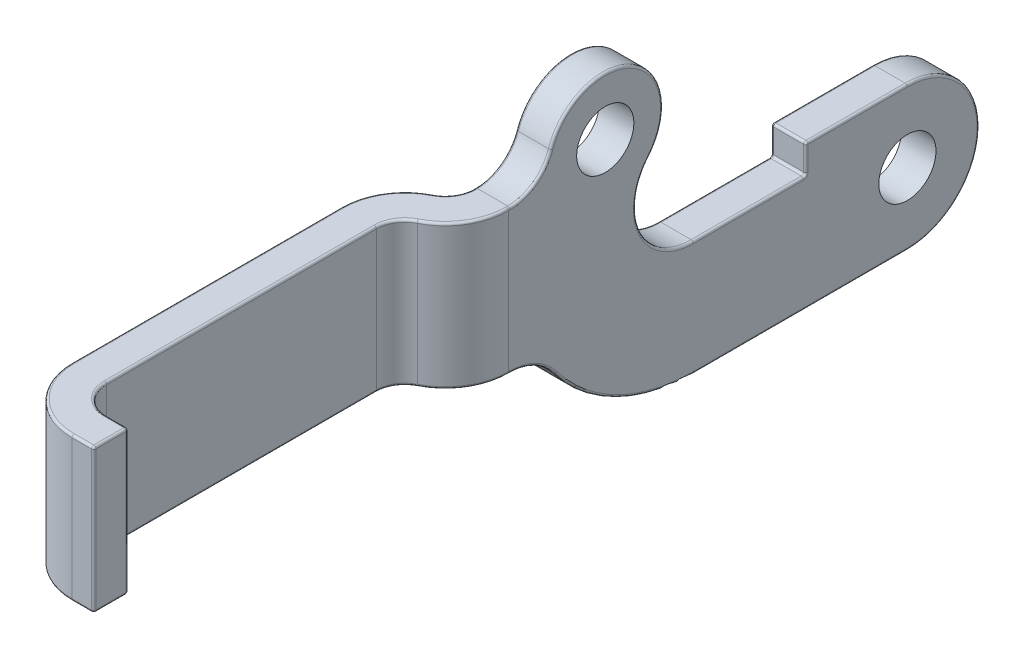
ISO-10303-21;
HEADER;
FILE_DESCRIPTION(('STEP AP214'),'2;1');
FILE_NAME('part.step','',(''),(''),'','','');
FILE_SCHEMA(('AUTOMOTIVE_DESIGN { 1 0 10303 214 1 1 1 1 }'));
ENDSEC;
DATA;
#1=APPLICATION_CONTEXT('core data for automotive mechanical design processes');
#2=APPLICATION_PROTOCOL_DEFINITION('international standard','automotive_design',2000,#1);
#3=PRODUCT_CONTEXT('',#1,'mechanical');
#4=PRODUCT('Part','Part','',(#3));
#5=PRODUCT_RELATED_PRODUCT_CATEGORY('part','',(#4));
#6=PRODUCT_DEFINITION_FORMATION('','',#4);
#7=PRODUCT_DEFINITION_CONTEXT('part definition',#1,'design');
#8=PRODUCT_DEFINITION('design','',#6,#7);
#9=PRODUCT_DEFINITION_SHAPE('','',#8);
#10=(LENGTH_UNIT() NAMED_UNIT(*) SI_UNIT(.MILLI.,.METRE.));
#11=(NAMED_UNIT(*) PLANE_ANGLE_UNIT() SI_UNIT($,.RADIAN.));
#12=(NAMED_UNIT(*) SI_UNIT($,.STERADIAN.) SOLID_ANGLE_UNIT());
#13=UNCERTAINTY_MEASURE_WITH_UNIT(LENGTH_MEASURE(1.E-05),#10,'distance_accuracy_value','');
#14=(GEOMETRIC_REPRESENTATION_CONTEXT(3) GLOBAL_UNCERTAINTY_ASSIGNED_CONTEXT((#13)) GLOBAL_UNIT_ASSIGNED_CONTEXT((#10,
#11,#12)) REPRESENTATION_CONTEXT('',''));
#15=CARTESIAN_POINT('',(0.,0.,0.));
#16=DIRECTION('',(0.,0.,1.));
#17=DIRECTION('',(1.,0.,0.));
#18=AXIS2_PLACEMENT_3D('',#15,#16,#17);
#19=CARTESIAN_POINT('',(0.,3.93700000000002,15.7734));
#20=DIRECTION('',(1.,0.,0.));
#21=DIRECTION('',(0.,1.,0.));
#22=AXIS2_PLACEMENT_3D('',#19,#20,#21);
#23=PLANE('',#22);
#24=DIRECTION('',(0.,0.,1.));
#25=VECTOR('',#24,1.);
#26=CARTESIAN_POINT('',(0.,0.10160000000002,15.7734));
#27=LINE('',#26,#25);
#28=CARTESIAN_POINT('',(0.,0.10160000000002,30.5689));
#29=VERTEX_POINT('',#28);
#30=CARTESIAN_POINT('',(0.,0.10160000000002,28.9179));
#31=VERTEX_POINT('',#30);
#32=EDGE_CURVE('E293',#29,#31,#27,.F.);
#33=ORIENTED_EDGE('',*,*,#32,.T.);
#34=DIRECTION('',(0.,-1.,0.));
#35=VECTOR('',#34,1.);
#36=CARTESIAN_POINT('',(0.,3.87667409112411,28.9179));
#37=LINE('',#36,#35);
#38=CARTESIAN_POINT('',(0.,7.77240000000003,28.9179));
#39=VERTEX_POINT('',#38);
#40=EDGE_CURVE('E260',#39,#31,#37,.T.);
#41=ORIENTED_EDGE('',*,*,#40,.F.);
#42=DIRECTION('',(0.,0.,1.));
#43=VECTOR('',#42,1.);
#44=CARTESIAN_POINT('',(0.,7.77240000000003,15.7734));
#45=LINE('',#44,#43);
#46=CARTESIAN_POINT('',(0.,7.77240000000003,30.5689));
#47=VERTEX_POINT('',#46);
#48=EDGE_CURVE('E291',#39,#47,#45,.T.);
#49=ORIENTED_EDGE('',*,*,#48,.T.);
#50=DIRECTION('',(0.,1.,0.));
#51=VECTOR('',#50,1.);
#52=CARTESIAN_POINT('',(0.,3.87667409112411,30.5689));
#53=LINE('',#52,#51);
#54=EDGE_CURVE('E256',#29,#47,#53,.T.);
#55=ORIENTED_EDGE('',*,*,#54,.F.);
#56=EDGE_LOOP('',(#33,#41,#49,#55));
#57=FACE_BOUND('',#56,.T.);
#58=ADVANCED_FACE('F17',(#57),#23,.T.);
#59=CARTESIAN_POINT('',(-0.126999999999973,3.87667409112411,30.5689));
#60=DIRECTION('',(0.,1.,0.));
#61=DIRECTION('',(0.,0.,1.));
#62=AXIS2_PLACEMENT_3D('',#59,#60,#61);
#63=CYLINDRICAL_SURFACE('',#62,0.126999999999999);
#64=ORIENTED_EDGE('',*,*,#54,.T.);
#65=CARTESIAN_POINT('',(-0.126999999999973,7.77240000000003,30.5689));
#66=DIRECTION('',(0.,1.,0.));
#67=DIRECTION('',(0.,0.,1.));
#68=AXIS2_PLACEMENT_3D('',#65,#66,#67);
#69=CIRCLE('',#68,0.126999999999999);
#70=CARTESIAN_POINT('',(-0.126999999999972,7.77240000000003,30.6959));
#71=VERTEX_POINT('',#70);
#72=EDGE_CURVE('E249',#47,#71,#69,.F.);
#73=ORIENTED_EDGE('',*,*,#72,.T.);
#74=DIRECTION('',(0.,1.,0.));
#75=VECTOR('',#74,1.);
#76=CARTESIAN_POINT('',(-0.126999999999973,3.8163481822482,30.6959));
#77=LINE('',#76,#75);
#78=CARTESIAN_POINT('',(-0.126999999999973,0.10160000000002,30.6959));
#79=VERTEX_POINT('',#78);
#80=EDGE_CURVE('E253',#71,#79,#77,.F.);
#81=ORIENTED_EDGE('',*,*,#80,.T.);
#82=CARTESIAN_POINT('',(-0.126999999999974,0.10160000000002,30.5689));
#83=DIRECTION('',(0.,1.,0.));
#84=DIRECTION('',(0.,0.,1.));
#85=AXIS2_PLACEMENT_3D('',#82,#83,#84);
#86=CIRCLE('',#85,0.126999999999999);
#87=EDGE_CURVE('E21',#79,#29,#86,.T.);
#88=ORIENTED_EDGE('',*,*,#87,.T.);
#89=EDGE_LOOP('',(#64,#73,#81,#88));
#90=FACE_BOUND('',#89,.T.);
#91=ADVANCED_FACE('F251',(#90),#63,.T.);
#92=CARTESIAN_POINT('',(-0.126999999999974,3.87667409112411,28.9179));
#93=DIRECTION('',(0.,-1.,0.));
#94=DIRECTION('',(0.,0.,-1.));
#95=AXIS2_PLACEMENT_3D('',#92,#93,#94);
#96=CYLINDRICAL_SURFACE('',#95,0.126999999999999);
#97=CARTESIAN_POINT('',(-0.126999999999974,0.10160000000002,28.9179));
#98=DIRECTION('',(0.,-1.,0.));
#99=DIRECTION('',(0.,0.,-1.));
#100=AXIS2_PLACEMENT_3D('',#97,#98,#99);
#101=CIRCLE('',#100,0.126999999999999);
#102=CARTESIAN_POINT('',(-0.126999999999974,0.10160000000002,28.7909));
#103=VERTEX_POINT('',#102);
#104=EDGE_CURVE('E1437',#31,#103,#101,.F.);
#105=ORIENTED_EDGE('',*,*,#104,.T.);
#106=DIRECTION('',(0.,-1.,0.));
#107=VECTOR('',#106,1.);
#108=CARTESIAN_POINT('',(-0.126999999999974,3.8163481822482,28.7909));
#109=LINE('',#108,#107);
#110=CARTESIAN_POINT('',(-0.126999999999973,7.77240000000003,28.7909));
#111=VERTEX_POINT('',#110);
#112=EDGE_CURVE('E1641',#103,#111,#109,.F.);
#113=ORIENTED_EDGE('',*,*,#112,.T.);
#114=CARTESIAN_POINT('',(-0.126999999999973,7.77240000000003,28.9179));
#115=DIRECTION('',(0.,-1.,0.));
#116=DIRECTION('',(0.,0.,-1.));
#117=AXIS2_PLACEMENT_3D('',#114,#115,#116);
#118=CIRCLE('',#117,0.126999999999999);
#119=EDGE_CURVE('E283',#39,#111,#118,.F.);
#120=ORIENTED_EDGE('',*,*,#119,.F.);
#121=ORIENTED_EDGE('',*,*,#40,.T.);
#122=EDGE_LOOP('',(#105,#113,#120,#121));
#123=FACE_BOUND('',#122,.T.);
#124=ADVANCED_FACE('F804',(#123),#96,.T.);
#125=CARTESIAN_POINT('',(-0.596899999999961,3.8163481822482,30.6959));
#126=DIRECTION('',(0.,0.,-1.));
#127=DIRECTION('',(0.,1.,0.));
#128=AXIS2_PLACEMENT_3D('',#125,#126,#127);
#129=PLANE('',#128);
#130=DIRECTION('',(1.,0.,0.));
#131=VECTOR('',#130,1.);
#132=CARTESIAN_POINT('',(-0.596899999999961,7.77240000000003,30.6959));
#133=LINE('',#132,#131);
#134=CARTESIAN_POINT('',(-1.19379999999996,7.77240000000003,30.6959));
#135=VERTEX_POINT('',#134);
#136=EDGE_CURVE('E265',#135,#71,#133,.T.);
#137=ORIENTED_EDGE('',*,*,#136,.F.);
#138=DIRECTION('',(0.,-1.,0.));
#139=VECTOR('',#138,1.);
#140=CARTESIAN_POINT('',(-1.19379999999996,3.8163481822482,30.6959));
#141=LINE('',#140,#139);
#142=CARTESIAN_POINT('',(-1.19379999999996,0.101600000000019,30.6959));
#143=VERTEX_POINT('',#142);
#144=EDGE_CURVE('E1634',#143,#135,#141,.F.);
#145=ORIENTED_EDGE('',*,*,#144,.F.);
#146=DIRECTION('',(1.,0.,0.));
#147=VECTOR('',#146,1.);
#148=CARTESIAN_POINT('',(-0.596899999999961,0.10160000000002,30.6959));
#149=LINE('',#148,#147);
#150=EDGE_CURVE('E274',#79,#143,#149,.F.);
#151=ORIENTED_EDGE('',*,*,#150,.F.);
#152=ORIENTED_EDGE('',*,*,#80,.F.);
#153=EDGE_LOOP('',(#137,#145,#151,#152));
#154=FACE_BOUND('',#153,.T.);
#155=ADVANCED_FACE('F281',(#154),#129,.F.);
#156=CARTESIAN_POINT('',(-0.026306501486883,7.83815024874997,28.9587663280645));
#157=CARTESIAN_POINT('',(-0.0256871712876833,7.86511419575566,28.9138577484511));
#158=CARTESIAN_POINT('',(-0.0673998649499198,7.89550445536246,28.9048743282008));
#159=CARTESIAN_POINT('',(-0.104409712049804,7.89505323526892,28.9419456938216));
#160=CARTESIAN_POINT('',(-0.0259426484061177,7.83772988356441,28.9585189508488));
#161=CARTESIAN_POINT('',(-0.0253171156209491,7.86496387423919,28.9131606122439));
#162=CARTESIAN_POINT('',(-0.0674475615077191,7.8956584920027,28.9040872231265));
#163=CARTESIAN_POINT('',(-0.104828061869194,7.89520275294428,28.9415298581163));
#164=CARTESIAN_POINT('',(-0.0255787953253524,7.83730951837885,28.9582715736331));
#165=CARTESIAN_POINT('',(-0.0249470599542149,7.86481355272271,28.9124634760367));
#166=CARTESIAN_POINT('',(-0.0674952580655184,7.89581252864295,28.9033001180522));
#167=CARTESIAN_POINT('',(-0.105246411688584,7.89535227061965,28.941114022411));
#168=CARTESIAN_POINT('',(-0.0252149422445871,7.8368891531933,28.9580241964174));
#169=CARTESIAN_POINT('',(-0.0245770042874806,7.86466323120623,28.9117663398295));
#170=CARTESIAN_POINT('',(-0.0675429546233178,7.89596656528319,28.9025130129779));
#171=CARTESIAN_POINT('',(-0.105664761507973,7.89550178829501,28.9406981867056));
#172=CARTESIAN_POINT('',(0.0204455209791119,7.78413690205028,28.9269804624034));
#173=CARTESIAN_POINT('',(0.0218618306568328,7.8457991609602,28.8242816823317));
#174=CARTESIAN_POINT('',(-0.0735284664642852,7.91529685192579,28.8037380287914));
#175=CARTESIAN_POINT('',(-0.15816410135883,7.91426498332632,28.8885143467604));
#176=CARTESIAN_POINT('',(0.00820610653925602,7.71958879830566,28.8880557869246));
#177=CARTESIAN_POINT('',(0.0098879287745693,7.7928107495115,28.76610428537));
#178=CARTESIAN_POINT('',(-0.103384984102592,7.87533702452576,28.7417093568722));
#179=CARTESIAN_POINT('',(-0.203887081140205,7.87411171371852,28.8423785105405));
#180=CARTESIAN_POINT('',(-0.0544744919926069,7.68258042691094,28.864970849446));
#181=CARTESIAN_POINT('',(-0.0532018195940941,7.73798911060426,28.772687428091));
#182=CARTESIAN_POINT('',(-0.138917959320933,7.80043858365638,28.7542272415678));
#183=CARTESIAN_POINT('',(-0.21497013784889,7.79951136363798,28.8304058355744));
#184=(BOUNDED_SURFACE() B_SPLINE_SURFACE(3,3,((#156,#157,#158,#159),(#160,#161,#162,#163),(#164,
#165,#166,#167),(#168,#169,#170,#171),(#172,#173,#174,#175),(#176,#177,#178,#179),(#180,#181,
#182,#183)),.UNSPECIFIED.,.F.,.F.,.F.) B_SPLINE_SURFACE_WITH_KNOTS((4,3,4),(4,4),(-0.01,0.,1.),
(0.,1.),.UNSPECIFIED.) GEOMETRIC_REPRESENTATION_ITEM() RATIONAL_B_SPLINE_SURFACE(((1.,
0.624136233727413,0.624136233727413,1.),(1.,0.624136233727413,0.624136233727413,1.),(1.,
0.624136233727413,0.624136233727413,1.),(1.,0.624136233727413,0.624136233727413,1.),
(0.796866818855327,0.497353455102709,0.497353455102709,0.796866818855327),(0.796866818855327,
0.497353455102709,0.497353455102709,0.796866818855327),(1.,0.624136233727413,0.624136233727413,1.))) REPRESENTATION_ITEM('') SURFACE());
#185=CARTESIAN_POINT('',(-0.126999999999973,7.77240000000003,28.9179));
#186=DIRECTION('',(1.,0.,0.));
#187=DIRECTION('',(0.,1.,0.));
#188=AXIS2_PLACEMENT_3D('',#185,#186,#187);
#189=CIRCLE('',#188,0.127);
#190=CARTESIAN_POINT('',(-0.126999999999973,7.89940000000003,28.9179));
#191=VERTEX_POINT('',#190);
#192=EDGE_CURVE('E1433',#191,#111,#189,.F.);
#193=CARTESIAN_POINT('',(-0.126999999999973,7.77240000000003,28.9179));
#194=DIRECTION('',(0.,0.,1.));
#195=DIRECTION('',(0.,-1.,0.));
#196=AXIS2_PLACEMENT_3D('',#193,#194,#195);
#197=CIRCLE('',#196,0.127);
#198=EDGE_CURVE('E279',#39,#191,#197,.T.);
#199=ORIENTED_EDGE('',*,*,#192,.F.);
#200=ORIENTED_EDGE('',*,*,#198,.F.);
#201=ORIENTED_EDGE('',*,*,#119,.T.);
#202=EDGE_LOOP('',(#199,#200,#201));
#203=FACE_BOUND('',#202,.T.);
#204=ADVANCED_FACE('F791',(#203),#184,.T.);
#205=CARTESIAN_POINT('',(-0.126999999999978,7.77240000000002,30.5689));
#206=DIRECTION('',(0.454590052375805,0.760847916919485,0.463096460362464));
#207=DIRECTION('',(0.0765028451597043,0.484649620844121,-0.871356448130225));
#208=AXIS2_PLACEMENT_3D('',#205,#206,#207);
#209=SPHERICAL_SURFACE('',#208,0.127000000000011);
#210=CARTESIAN_POINT('',(-0.126999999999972,7.77240000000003,30.5689));
#211=DIRECTION('',(-1.,0.,0.));
#212=DIRECTION('',(0.,-1.,0.));
#213=AXIS2_PLACEMENT_3D('',#210,#211,#212);
#214=CIRCLE('',#213,0.127);
#215=CARTESIAN_POINT('',(-0.126999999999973,7.89940000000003,30.5689));
#216=VERTEX_POINT('',#215);
#217=EDGE_CURVE('E267',#71,#216,#214,.T.);
#218=ORIENTED_EDGE('',*,*,#217,.F.);
#219=ORIENTED_EDGE('',*,*,#72,.F.);
#220=CARTESIAN_POINT('',(-0.126999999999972,7.77240000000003,30.5689));
#221=DIRECTION('',(0.,0.,1.));
#222=DIRECTION('',(0.,-1.,0.));
#223=AXIS2_PLACEMENT_3D('',#220,#221,#222);
#224=CIRCLE('',#223,0.127);
#225=EDGE_CURVE('E277',#216,#47,#224,.F.);
#226=ORIENTED_EDGE('',*,*,#225,.F.);
#227=EDGE_LOOP('',(#218,#219,#226));
#228=FACE_BOUND('',#227,.T.);
#229=ADVANCED_FACE('F276',(#228),#209,.T.);
#230=CARTESIAN_POINT('',(-0.596899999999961,3.8163481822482,28.7909));
#231=DIRECTION('',(0.,0.,1.));
#232=DIRECTION('',(0.,-1.,0.));
#233=AXIS2_PLACEMENT_3D('',#230,#231,#232);
#234=PLANE('',#233);
#235=DIRECTION('',(1.,0.,0.));
#236=VECTOR('',#235,1.);
#237=CARTESIAN_POINT('',(-1.46684999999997,7.77240000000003,28.7909));
#238=LINE('',#237,#236);
#239=CARTESIAN_POINT('',(-1.19379999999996,7.77240000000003,28.7909));
#240=VERTEX_POINT('',#239);
#241=EDGE_CURVE('E1432',#111,#240,#238,.F.);
#242=ORIENTED_EDGE('',*,*,#241,.F.);
#243=ORIENTED_EDGE('',*,*,#112,.F.);
#244=DIRECTION('',(1.,0.,0.));
#245=VECTOR('',#244,1.);
#246=CARTESIAN_POINT('',(-0.596899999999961,0.10160000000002,28.7909));
#247=LINE('',#246,#245);
#248=CARTESIAN_POINT('',(-1.19379999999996,0.101600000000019,28.7909));
#249=VERTEX_POINT('',#248);
#250=EDGE_CURVE('E286',#249,#103,#247,.T.);
#251=ORIENTED_EDGE('',*,*,#250,.F.);
#252=DIRECTION('',(0.,-1.,0.));
#253=VECTOR('',#252,1.);
#254=CARTESIAN_POINT('',(-1.19379999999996,3.8163481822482,28.7909));
#255=LINE('',#254,#253);
#256=EDGE_CURVE('E1580',#249,#240,#255,.F.);
#257=ORIENTED_EDGE('',*,*,#256,.T.);
#258=EDGE_LOOP('',(#242,#243,#251,#257));
#259=FACE_BOUND('',#258,.T.);
#260=ADVANCED_FACE('F786',(#259),#234,.F.);
#261=CARTESIAN_POINT('',(-4.67359999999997,3.93700000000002,15.7734));
#262=DIRECTION('',(1.,0.,0.));
#263=DIRECTION('',(0.,1.,0.));
#264=AXIS2_PLACEMENT_3D('',#261,#262,#263);
#265=PLANE('',#264);
#266=DIRECTION('',(0.,0.,-1.));
#267=VECTOR('',#266,1.);
#268=CARTESIAN_POINT('',(-4.67359999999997,7.77240000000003,15.7734));
#269=LINE('',#268,#267);
#270=CARTESIAN_POINT('',(-4.67359999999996,7.77240000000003,12.36575249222));
#271=VERTEX_POINT('',#270);
#272=CARTESIAN_POINT('',(-4.67359999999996,7.77240000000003,27.2161));
#273=VERTEX_POINT('',#272);
#274=EDGE_CURVE('E1592',#271,#273,#269,.F.);
#275=ORIENTED_EDGE('',*,*,#274,.F.);
#276=DIRECTION('',(0.,-1.,0.));
#277=VECTOR('',#276,1.);
#278=CARTESIAN_POINT('',(-4.67359999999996,3.81634818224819,12.36575249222));
#279=LINE('',#278,#277);
#280=CARTESIAN_POINT('',(-4.67359999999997,0.101600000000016,12.36575249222));
#281=VERTEX_POINT('',#280);
#282=EDGE_CURVE('E1607',#281,#271,#279,.F.);
#283=ORIENTED_EDGE('',*,*,#282,.F.);
#284=DIRECTION('',(0.,0.,1.));
#285=VECTOR('',#284,1.);
#286=CARTESIAN_POINT('',(-4.67359999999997,0.101600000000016,15.7734));
#287=LINE('',#286,#285);
#288=CARTESIAN_POINT('',(-4.67359999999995,0.101600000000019,27.2161));
#289=VERTEX_POINT('',#288);
#290=EDGE_CURVE('E1555',#289,#281,#287,.F.);
#291=ORIENTED_EDGE('',*,*,#290,.F.);
#292=DIRECTION('',(0.,-1.,0.));
#293=VECTOR('',#292,1.);
#294=CARTESIAN_POINT('',(-4.67359999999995,3.8163481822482,27.2161));
#295=LINE('',#294,#293);
#296=EDGE_CURVE('E1636',#273,#289,#295,.T.);
#297=ORIENTED_EDGE('',*,*,#296,.F.);
#298=EDGE_LOOP('',(#275,#283,#291,#297));
#299=FACE_BOUND('',#298,.T.);
#300=ADVANCED_FACE('F782',(#299),#265,.F.);
#301=CARTESIAN_POINT('',(-1.19379999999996,3.8163481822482,27.2161));
#302=DIRECTION('',(0.,-1.,0.));
#303=DIRECTION('',(0.,0.,-1.));
#304=AXIS2_PLACEMENT_3D('',#301,#302,#303);
#305=CYLINDRICAL_SURFACE('',#304,3.47979999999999);
#306=CARTESIAN_POINT('',(-1.19379999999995,0.101600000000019,27.2161));
#307=DIRECTION('',(0.,-1.,0.));
#308=DIRECTION('',(0.,0.,-1.));
#309=AXIS2_PLACEMENT_3D('',#306,#307,#308);
#310=CIRCLE('',#309,3.47979999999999);
#311=EDGE_CURVE('E1549',#143,#289,#310,.T.);
#312=ORIENTED_EDGE('',*,*,#311,.F.);
#313=ORIENTED_EDGE('',*,*,#144,.T.);
#314=CARTESIAN_POINT('',(-1.19379999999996,7.77240000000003,27.2161));
#315=DIRECTION('',(0.,1.,0.));
#316=DIRECTION('',(-1.,0.,0.));
#317=AXIS2_PLACEMENT_3D('',#314,#315,#316);
#318=CIRCLE('',#317,3.47979999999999);
#319=EDGE_CURVE('E1598',#273,#135,#318,.T.);
#320=ORIENTED_EDGE('',*,*,#319,.F.);
#321=ORIENTED_EDGE('',*,*,#296,.T.);
#322=EDGE_LOOP('',(#312,#313,#320,#321));
#323=FACE_BOUND('',#322,.T.);
#324=ADVANCED_FACE('F774',(#323),#305,.T.);
#325=CARTESIAN_POINT('',(-0.126999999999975,0.10160000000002,30.5689));
#326=DIRECTION('',(0.454590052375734,0.760847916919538,0.463096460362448));
#327=DIRECTION('',(-0.0765028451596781,-0.4846496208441,0.871356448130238));
#328=AXIS2_PLACEMENT_3D('',#325,#326,#327);
#329=SPHERICAL_SURFACE('',#328,0.127000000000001);
#330=CARTESIAN_POINT('',(-0.126999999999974,0.10160000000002,30.5689));
#331=DIRECTION('',(1.,0.,0.));
#332=DIRECTION('',(0.,1.,0.));
#333=AXIS2_PLACEMENT_3D('',#330,#331,#332);
#334=CIRCLE('',#333,0.127);
#335=CARTESIAN_POINT('',(-0.126999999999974,-0.025399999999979,30.5689));
#336=VERTEX_POINT('',#335);
#337=EDGE_CURVE('E1426',#336,#79,#334,.F.);
#338=ORIENTED_EDGE('',*,*,#337,.F.);
#339=CARTESIAN_POINT('',(-0.126999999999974,0.10160000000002,30.5689));
#340=DIRECTION('',(0.,0.,-1.));
#341=DIRECTION('',(0.,1.,0.));
#342=AXIS2_PLACEMENT_3D('',#339,#340,#341);
#343=CIRCLE('',#342,0.127);
#344=EDGE_CURVE('E1419',#29,#336,#343,.T.);
#345=ORIENTED_EDGE('',*,*,#344,.F.);
#346=ORIENTED_EDGE('',*,*,#87,.F.);
#347=EDGE_LOOP('',(#338,#345,#346));
#348=FACE_BOUND('',#347,.T.);
#349=ADVANCED_FACE('F319',(#348),#329,.T.);
#350=CARTESIAN_POINT('',(-0.0413516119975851,0.0733018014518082,29.0073011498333));
#351=CARTESIAN_POINT('',(0.037649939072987,0.0723499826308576,28.9313145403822));
#352=CARTESIAN_POINT('',(0.0196151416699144,0.136224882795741,28.8440743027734));
#353=CARTESIAN_POINT('',(-0.0748260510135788,0.191860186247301,28.8453742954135));
#354=CARTESIAN_POINT('',(-0.0536080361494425,-0.00110684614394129,28.9954904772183));
#355=CARTESIAN_POINT('',(0.0501988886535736,-0.00235752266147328,28.8956451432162));
#356=CARTESIAN_POINT('',(0.0265014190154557,0.0815731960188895,28.7810127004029));
#357=CARTESIAN_POINT('',(-0.0975929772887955,0.154677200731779,28.7827208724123));
#358=CARTESIAN_POINT('',(-0.0991200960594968,-0.0406371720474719,28.9486677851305));
#359=CARTESIAN_POINT('',(-0.012178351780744,-0.0416846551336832,28.86504400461));
#360=CARTESIAN_POINT('',(-0.032025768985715,0.0286101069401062,28.7690355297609));
#361=CARTESIAN_POINT('',(-0.135958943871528,0.0898371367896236,28.7704661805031));
#362=CARTESIAN_POINT('',(-0.150170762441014,-0.0212150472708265,28.8953482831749));
#363=CARTESIAN_POINT('',(-0.111493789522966,-0.0216810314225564,28.8581473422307));
#364=CARTESIAN_POINT('',(-0.120323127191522,0.00959035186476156,28.8154369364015));
#365=CARTESIAN_POINT('',(-0.16655892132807,0.0368278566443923,28.8160733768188));
#366=CARTESIAN_POINT('',(-0.150577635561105,-0.0210602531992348,28.8949233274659));
#367=CARTESIAN_POINT('',(-0.112285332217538,-0.0215216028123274,28.8580923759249));
#368=CARTESIAN_POINT('',(-0.121026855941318,0.00943876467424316,28.8158067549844));
#369=CARTESIAN_POINT('',(-0.166802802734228,0.0364053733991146,28.8164368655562));
#370=CARTESIAN_POINT('',(-0.150984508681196,-0.0209054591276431,28.894498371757));
#371=CARTESIAN_POINT('',(-0.113076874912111,-0.0213621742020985,28.8580374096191));
#372=CARTESIAN_POINT('',(-0.121730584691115,0.00928717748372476,28.8161765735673));
#373=CARTESIAN_POINT('',(-0.167046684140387,0.0359828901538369,28.8168003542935));
#374=CARTESIAN_POINT('',(-0.151391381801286,-0.0207506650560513,28.8940734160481));
#375=CARTESIAN_POINT('',(-0.113868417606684,-0.0212027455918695,28.8579824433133));
#376=CARTESIAN_POINT('',(-0.122434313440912,0.00913559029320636,28.8165463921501));
#377=CARTESIAN_POINT('',(-0.167290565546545,0.0355604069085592,28.8171638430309));
#378=(BOUNDED_SURFACE() B_SPLINE_SURFACE(3,3,((#350,#351,#352,#353),(#354,#355,#356,#357),(#358,
#359,#360,#361),(#362,#363,#364,#365),(#366,#367,#368,#369),(#370,#371,#372,#373),(#374,#375,
#376,#377)),.UNSPECIFIED.,.F.,.F.,.F.) B_SPLINE_SURFACE_WITH_KNOTS((4,3,4),(4,4),(0.,1.,1.01),
(0.,1.),.UNSPECIFIED.) GEOMETRIC_REPRESENTATION_ITEM() RATIONAL_B_SPLINE_SURFACE(((1.,
0.618700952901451,0.618700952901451,1.),(0.796998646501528,0.493103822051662,0.493103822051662,
0.796998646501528),(0.796998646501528,0.493103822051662,0.493103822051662,0.796998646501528),
(1.,0.618700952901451,0.618700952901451,1.),(1.,0.618700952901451,0.618700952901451,1.),(1.,
0.618700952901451,0.618700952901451,1.),(1.,0.618700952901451,0.618700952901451,1.))) REPRESENTATION_ITEM('') SURFACE());
#379=CARTESIAN_POINT('',(-0.126999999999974,0.101600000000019,28.9179));
#380=DIRECTION('',(0.,0.,-1.));
#381=DIRECTION('',(0.,1.,0.));
#382=AXIS2_PLACEMENT_3D('',#379,#380,#381);
#383=CIRCLE('',#382,0.127);
#384=CARTESIAN_POINT('',(-0.126999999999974,-0.0253999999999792,28.9179));
#385=VERTEX_POINT('',#384);
#386=EDGE_CURVE('E1422',#385,#31,#383,.F.);
#387=CARTESIAN_POINT('',(-0.126999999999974,0.10160000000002,28.9179));
#388=DIRECTION('',(-1.,0.,0.));
#389=DIRECTION('',(0.,-1.,0.));
#390=AXIS2_PLACEMENT_3D('',#387,#388,#389);
#391=CIRCLE('',#390,0.127);
#392=EDGE_CURVE('E1415',#103,#385,#391,.T.);
#393=ORIENTED_EDGE('',*,*,#386,.F.);
#394=ORIENTED_EDGE('',*,*,#392,.F.);
#395=ORIENTED_EDGE('',*,*,#104,.F.);
#396=EDGE_LOOP('',(#393,#394,#395));
#397=FACE_BOUND('',#396,.T.);
#398=ADVANCED_FACE('F767',(#397),#378,.T.);
#399=CARTESIAN_POINT('',(-1.19379999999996,3.81634818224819,12.36575249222));
#400=DIRECTION('',(0.,-1.,0.));
#401=DIRECTION('',(0.,0.,-1.));
#402=AXIS2_PLACEMENT_3D('',#399,#400,#401);
#403=CYLINDRICAL_SURFACE('',#402,3.4798);
#404=CARTESIAN_POINT('',(-1.19379999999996,0.101600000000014,12.36575249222));
#405=DIRECTION('',(0.,-1.,0.));
#406=DIRECTION('',(0.,0.,-1.));
#407=AXIS2_PLACEMENT_3D('',#404,#405,#406);
#408=CIRCLE('',#407,3.4798);
#409=CARTESIAN_POINT('',(-2.76532258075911,0.101600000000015,9.26102628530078));
#410=VERTEX_POINT('',#409);
#411=EDGE_CURVE('E1556',#281,#410,#408,.T.);
#412=ORIENTED_EDGE('',*,*,#411,.F.);
#413=ORIENTED_EDGE('',*,*,#282,.T.);
#414=CARTESIAN_POINT('',(-1.19379999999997,7.77240000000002,12.36575249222));
#415=DIRECTION('',(0.,1.,0.));
#416=DIRECTION('',(-1.,0.,0.));
#417=AXIS2_PLACEMENT_3D('',#414,#415,#416);
#418=CIRCLE('',#417,3.4798);
#419=CARTESIAN_POINT('',(-2.7653225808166,7.77240000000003,9.26102628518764));
#420=VERTEX_POINT('',#419);
#421=EDGE_CURVE('E1586',#420,#271,#418,.T.);
#422=ORIENTED_EDGE('',*,*,#421,.F.);
#423=DIRECTION('',(0.,-1.,0.));
#424=VECTOR('',#423,1.);
#425=CARTESIAN_POINT('',(-2.7653225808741,3.8163481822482,9.26102628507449));
#426=LINE('',#425,#424);
#427=EDGE_CURVE('E1414',#420,#410,#426,.T.);
#428=ORIENTED_EDGE('',*,*,#427,.T.);
#429=EDGE_LOOP('',(#412,#413,#422,#428));
#430=FACE_BOUND('',#429,.T.);
#431=ADVANCED_FACE('F317',(#430),#403,.T.);
#432=CARTESIAN_POINT('',(-1.19379999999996,7.77240000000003,27.2161));
#433=DIRECTION('',(0.,1.,0.));
#434=DIRECTION('',(-1.,0.,0.));
#435=AXIS2_PLACEMENT_3D('',#432,#433,#434);
#436=TOROIDAL_SURFACE('',#435,1.70180000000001,0.127000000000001);
#437=CARTESIAN_POINT('',(-1.19379999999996,7.77240000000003,28.9179));
#438=DIRECTION('',(1.,0.,0.));
#439=DIRECTION('',(0.,1.,0.));
#440=AXIS2_PLACEMENT_3D('',#437,#438,#439);
#441=CIRCLE('',#440,0.127);
#442=CARTESIAN_POINT('',(-1.19379999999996,7.89940000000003,28.9179));
#443=VERTEX_POINT('',#442);
#444=EDGE_CURVE('E1435',#240,#443,#441,.T.);
#445=ORIENTED_EDGE('',*,*,#444,.F.);
#446=CARTESIAN_POINT('',(-1.19379999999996,7.77240000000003,27.2161));
#447=DIRECTION('',(0.,-1.,0.));
#448=DIRECTION('',(0.,0.,-1.));
#449=AXIS2_PLACEMENT_3D('',#446,#447,#448);
#450=CIRCLE('',#449,1.57480000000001);
#451=CARTESIAN_POINT('',(-2.76859999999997,7.77240000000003,27.2161));
#452=VERTEX_POINT('',#451);
#453=EDGE_CURVE('E1571',#240,#452,#450,.T.);
#454=ORIENTED_EDGE('',*,*,#453,.T.);
#455=CARTESIAN_POINT('',(-2.89559999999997,7.77240000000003,27.2161));
#456=DIRECTION('',(0.,0.,1.));
#457=DIRECTION('',(0.,-1.,0.));
#458=AXIS2_PLACEMENT_3D('',#455,#456,#457);
#459=CIRCLE('',#458,0.127);
#460=CARTESIAN_POINT('',(-2.89559999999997,7.89940000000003,27.2161));
#461=VERTEX_POINT('',#460);
#462=EDGE_CURVE('E1566',#461,#452,#459,.F.);
#463=ORIENTED_EDGE('',*,*,#462,.F.);
#464=CARTESIAN_POINT('',(-2.89559999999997,7.89940000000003,27.2161));
#465=CARTESIAN_POINT('',(-2.89558682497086,7.89939999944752,27.2374768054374));
#466=CARTESIAN_POINT('',(-2.89517504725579,7.89939999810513,27.2588534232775));
#467=CARTESIAN_POINT('',(-2.89355506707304,7.8993999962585,27.3015754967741));
#468=CARTESIAN_POINT('',(-2.89234690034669,7.89939999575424,27.3229209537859));
#469=CARTESIAN_POINT('',(-2.8891349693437,7.89939999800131,27.3655512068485));
#470=CARTESIAN_POINT('',(-2.88713122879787,7.89940000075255,27.3868360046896));
#471=CARTESIAN_POINT('',(-2.88233454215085,7.89939999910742,27.4293163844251));
#472=CARTESIAN_POINT('',(-2.87954160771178,7.89939999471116,27.4505119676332));
#473=CARTESIAN_POINT('',(-2.87315712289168,7.89939998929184,27.4927821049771));
#474=CARTESIAN_POINT('',(-2.86956557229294,7.89939998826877,27.5138566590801));
#475=CARTESIAN_POINT('',(-2.86277085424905,7.89939991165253,27.5498647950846));
#476=CARTESIAN_POINT('',(-2.85974986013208,7.89939985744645,27.5648327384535));
#477=CARTESIAN_POINT('',(-2.8563129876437,7.89939986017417,27.5805392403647));
#478=CARTESIAN_POINT('',(-2.85613903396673,7.89939986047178,27.581330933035));
#479=CARTESIAN_POINT('',(-2.85336217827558,7.89939986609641,27.5939229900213));
#480=CARTESIAN_POINT('',(-2.85062552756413,7.89939988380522,27.6056939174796));
#481=CARTESIAN_POINT('',(-2.84149928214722,7.89939993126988,27.643149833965));
#482=CARTESIAN_POINT('',(-2.83463846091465,7.89939995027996,27.668721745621));
#483=CARTESIAN_POINT('',(-2.8211024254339,7.8993999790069,27.7148267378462));
#484=CARTESIAN_POINT('',(-2.81462669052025,7.89939998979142,27.7354186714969));
#485=CARTESIAN_POINT('',(-2.8047615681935,7.8993999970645,27.7648372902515));
#486=CARTESIAN_POINT('',(-2.80168396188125,7.89939999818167,27.7737695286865));
#487=CARTESIAN_POINT('',(-2.79110810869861,7.89940000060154,27.8036740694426));
#488=CARTESIAN_POINT('',(-2.7832800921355,7.89940000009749,27.8245309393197));
#489=CARTESIAN_POINT('',(-2.76670913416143,7.89939999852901,27.8662267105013));
#490=CARTESIAN_POINT('',(-2.75795462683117,7.89939999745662,27.8870610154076));
#491=CARTESIAN_POINT('',(-2.74483532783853,7.8993999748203,27.9166590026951));
#492=CARTESIAN_POINT('',(-2.74079629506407,7.89939996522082,27.9255682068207));
#493=CARTESIAN_POINT('',(-2.73111698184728,7.89939993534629,27.9464397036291));
#494=CARTESIAN_POINT('',(-2.72541352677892,7.89939991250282,27.9583727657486));
#495=CARTESIAN_POINT('',(-2.70934354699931,7.89939984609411,27.9909994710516));
#496=CARTESIAN_POINT('',(-2.69868779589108,7.89939979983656,28.0115514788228));
#497=CARTESIAN_POINT('',(-2.67653920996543,7.89939971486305,28.052199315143));
#498=CARTESIAN_POINT('',(-2.66504635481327,7.89939967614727,28.0722951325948));
#499=CARTESIAN_POINT('',(-2.64124221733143,7.89939961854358,28.1119964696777));
#500=CARTESIAN_POINT('',(-2.62893092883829,7.89939959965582,28.131601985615));
#501=CARTESIAN_POINT('',(-2.60351114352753,7.89939958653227,28.1702888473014));
#502=CARTESIAN_POINT('',(-2.59040265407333,7.89939959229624,28.1893701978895));
#503=CARTESIAN_POINT('',(-2.56341155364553,7.89939962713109,28.2269766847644));
#504=CARTESIAN_POINT('',(-2.5495289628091,7.89939965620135,28.2455018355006));
#505=CARTESIAN_POINT('',(-2.52101106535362,7.89939972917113,28.2819618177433));
#506=CARTESIAN_POINT('',(-2.50637579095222,7.89939977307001,28.2998966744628));
#507=CARTESIAN_POINT('',(-2.47638690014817,7.8993998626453,28.3351542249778));
#508=CARTESIAN_POINT('',(-2.46103332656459,7.89939990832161,28.3524769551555));
#509=CARTESIAN_POINT('',(-2.42959988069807,7.89939997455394,28.3864476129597));
#510=CARTESIAN_POINT('',(-2.41352006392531,7.89939999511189,28.4030955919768));
#511=CARTESIAN_POINT('',(-2.38913269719,7.89940000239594,28.4274725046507));
#512=CARTESIAN_POINT('',(-2.38104238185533,7.89940000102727,28.435421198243));
#513=CARTESIAN_POINT('',(-2.35325360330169,7.89939998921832,28.4621869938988));
#514=CARTESIAN_POINT('',(-2.33318076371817,7.89939996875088,28.4806197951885));
#515=CARTESIAN_POINT('',(-2.29794119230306,7.89939989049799,28.5114595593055));
#516=CARTESIAN_POINT('',(-2.28298113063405,7.89939984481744,28.5241040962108));
#517=CARTESIAN_POINT('',(-2.25791155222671,7.89939975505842,28.544559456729));
#518=CARTESIAN_POINT('',(-2.24792516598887,7.89939971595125,28.552521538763));
#519=CARTESIAN_POINT('',(-2.21917750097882,7.89939960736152,28.5749100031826));
#520=CARTESIAN_POINT('',(-2.20019734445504,7.89939954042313,28.5890572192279));
#521=CARTESIAN_POINT('',(-2.16369139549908,7.89939946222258,28.6150785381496));
#522=CARTESIAN_POINT('',(-2.14622399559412,7.89939944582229,28.6270348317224));
#523=CARTESIAN_POINT('',(-2.1091499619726,7.89939945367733,28.651392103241));
#524=CARTESIAN_POINT('',(-2.08949892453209,7.89939948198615,28.6637256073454));
#525=CARTESIAN_POINT('',(-2.04970809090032,7.89939955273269,28.6875723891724));
#526=CARTESIAN_POINT('',(-2.02956833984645,7.89939959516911,28.69908574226));
#527=CARTESIAN_POINT('',(-1.98883293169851,7.89939969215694,28.721270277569));
#528=CARTESIAN_POINT('',(-1.9682373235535,7.89939974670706,28.7319415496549));
#529=CARTESIAN_POINT('',(-1.92662674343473,7.8993998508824,28.7524258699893));
#530=CARTESIAN_POINT('',(-1.90561182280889,7.89939990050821,28.7622390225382));
#531=CARTESIAN_POINT('',(-1.86319629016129,7.89939997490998,28.7809848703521));
#532=CARTESIAN_POINT('',(-1.84179573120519,7.89939999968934,28.7899176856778));
#533=CARTESIAN_POINT('',(-1.80034685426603,7.89940000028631,28.8062420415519));
#534=CARTESIAN_POINT('',(-1.78032444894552,7.89939997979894,28.8136995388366));
#535=CARTESIAN_POINT('',(-1.74002541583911,7.89939995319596,28.8278796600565));
#536=CARTESIAN_POINT('',(-1.71974883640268,7.89939994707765,28.834602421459));
#537=CARTESIAN_POINT('',(-1.67896670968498,7.89939995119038,28.8473038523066));
#538=CARTESIAN_POINT('',(-1.65846119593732,7.89939996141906,28.8532826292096));
#539=CARTESIAN_POINT('',(-1.61724557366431,7.89940000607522,28.8644743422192));
#540=CARTESIAN_POINT('',(-1.59653548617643,7.89940004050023,28.8696873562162));
#541=CARTESIAN_POINT('',(-1.55494756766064,7.89939993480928,28.8793994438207));
#542=CARTESIAN_POINT('',(-1.5340697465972,7.89939979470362,28.8838985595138));
#543=CARTESIAN_POINT('',(-1.50279689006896,7.89939974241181,28.8899091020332));
#544=CARTESIAN_POINT('',(-1.49246970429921,7.89939975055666,28.8917764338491));
#545=CARTESIAN_POINT('',(-1.45757721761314,7.8993997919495,28.8977474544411));
#546=CARTESIAN_POINT('',(-1.43293316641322,7.89939984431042,28.901401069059));
#547=CARTESIAN_POINT('',(-1.39050433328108,7.89939991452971,28.9067387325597));
#548=CARTESIAN_POINT('',(-1.37275213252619,7.8993999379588,28.9086875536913));
#549=CARTESIAN_POINT('',(-1.34116461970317,7.89939996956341,28.9116539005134));
#550=CARTESIAN_POINT('',(-1.32733963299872,7.89939997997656,28.9127822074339));
#551=CARTESIAN_POINT('',(-1.29048297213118,7.89939999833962,28.915340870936));
#552=CARTESIAN_POINT('',(-1.26743003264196,7.89940000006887,28.9164747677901));
#553=CARTESIAN_POINT('',(-1.22751369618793,7.89939999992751,28.9176440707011));
#554=CARTESIAN_POINT('',(-1.21065629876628,7.89939999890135,28.9178931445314));
#555=CARTESIAN_POINT('',(-1.19379999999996,7.89940000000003,28.9179));
#556=B_SPLINE_CURVE_WITH_KNOTS('',3,(#464,#465,#466,#467,#468,#469,#470,#471,#472,#473,#474,
#475,#476,#477,#478,#479,#480,#481,#482,#483,#484,#485,#486,#487,#488,#489,#490,#491,#492,#493,
#494,#495,#496,#497,#498,#499,#500,#501,#502,#503,#504,#505,#506,#507,#508,#509,#510,#511,#512,
#513,#514,#515,#516,#517,#518,#519,#520,#521,#522,#523,#524,#525,#526,#527,#528,#529,#530,#531,
#532,#533,#534,#535,#536,#537,#538,#539,#540,#541,#542,#543,#544,#545,#546,#547,#548,#549,#550,
#551,#552,#553,#554,#555),.UNSPECIFIED.,.F.,.F.,(4,2,2,2,2,2,2,2,2,2,2,2,2,2,2,2,2,2,2,2,2,2,2,
2,2,2,2,2,2,2,2,2,2,2,2,2,2,2,2,2,2,2,2,2,2,4),(0.,0.0641268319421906,0.128250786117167,
0.192372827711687,0.256493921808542,0.320615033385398,0.366417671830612,0.368849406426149,
0.405101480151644,0.484498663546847,0.549240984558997,0.577582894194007,0.644397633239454,
0.712175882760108,0.741520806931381,0.781195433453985,0.850624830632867,0.92005591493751,
0.989487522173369,1.05891848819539,1.12834764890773,1.1977738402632,1.26719589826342,
1.33661265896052,1.37063708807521,1.45235728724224,1.51111007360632,1.5494232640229,
1.62041723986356,1.68390539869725,1.75348754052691,1.82306328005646,1.8926315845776,
1.96219142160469,2.03174175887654,2.09582588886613,2.15989800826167,2.22396086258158,
2.28801719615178,2.35206975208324,2.38355205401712,2.45826424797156,2.51183250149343,
2.55344176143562,2.62266407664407,2.67323385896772),.UNSPECIFIED.);
#557=EDGE_CURVE('E296',#461,#443,#556,.T.);
#558=ORIENTED_EDGE('',*,*,#557,.T.);
#559=EDGE_LOOP('',(#445,#454,#463,#558));
#560=FACE_BOUND('',#559,.T.);
#561=ADVANCED_FACE('F306',(#560),#436,.T.);
#562=CARTESIAN_POINT('',(-1.46684999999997,7.77240000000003,28.9179));
#563=DIRECTION('',(1.,0.,0.));
#564=DIRECTION('',(0.,1.,0.));
#565=AXIS2_PLACEMENT_3D('',#562,#563,#564);
#566=CYLINDRICAL_SURFACE('',#565,0.127);
#567=ORIENTED_EDGE('',*,*,#192,.T.);
#568=ORIENTED_EDGE('',*,*,#241,.T.);
#569=ORIENTED_EDGE('',*,*,#444,.T.);
#570=DIRECTION('',(1.,0.,0.));
#571=VECTOR('',#570,1.);
#572=CARTESIAN_POINT('',(-2.33679999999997,7.89940000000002,28.9179));
#573=LINE('',#572,#571);
#574=EDGE_CURVE('E300',#443,#191,#573,.T.);
#575=ORIENTED_EDGE('',*,*,#574,.T.);
#576=EDGE_LOOP('',(#567,#568,#569,#575));
#577=FACE_BOUND('',#576,.T.);
#578=ADVANCED_FACE('F316',(#577),#566,.T.);
#579=CARTESIAN_POINT('',(-0.126999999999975,7.77240000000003,15.7734));
#580=DIRECTION('',(0.,0.,1.));
#581=DIRECTION('',(0.,-1.,0.));
#582=AXIS2_PLACEMENT_3D('',#579,#580,#581);
#583=CYLINDRICAL_SURFACE('',#582,0.127);
#584=ORIENTED_EDGE('',*,*,#198,.T.);
#585=DIRECTION('',(0.,0.,-1.));
#586=VECTOR('',#585,1.);
#587=CARTESIAN_POINT('',(-0.126999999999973,7.89940000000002,15.7734));
#588=LINE('',#587,#586);
#589=EDGE_CURVE('E1494',#191,#216,#588,.F.);
#590=ORIENTED_EDGE('',*,*,#589,.T.);
#591=ORIENTED_EDGE('',*,*,#225,.T.);
#592=ORIENTED_EDGE('',*,*,#48,.F.);
#593=EDGE_LOOP('',(#584,#590,#591,#592));
#594=FACE_BOUND('',#593,.T.);
#595=ADVANCED_FACE('F758',(#594),#583,.T.);
#596=CARTESIAN_POINT('',(-1.46684999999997,7.77240000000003,30.5689));
#597=DIRECTION('',(-1.,0.,0.));
#598=DIRECTION('',(0.,-1.,0.));
#599=AXIS2_PLACEMENT_3D('',#596,#597,#598);
#600=CYLINDRICAL_SURFACE('',#599,0.127);
#601=ORIENTED_EDGE('',*,*,#217,.T.);
#602=DIRECTION('',(1.,0.,0.));
#603=VECTOR('',#602,1.);
#604=CARTESIAN_POINT('',(-2.33679999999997,7.89940000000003,30.5689));
#605=LINE('',#604,#603);
#606=CARTESIAN_POINT('',(-1.19379999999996,7.89940000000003,30.5689));
#607=VERTEX_POINT('',#606);
#608=EDGE_CURVE('E1410',#216,#607,#605,.F.);
#609=ORIENTED_EDGE('',*,*,#608,.T.);
#610=CARTESIAN_POINT('',(-1.19379999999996,7.77240000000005,30.5689));
#611=DIRECTION('',(-1.,0.,0.));
#612=DIRECTION('',(0.,0.,1.));
#613=AXIS2_PLACEMENT_3D('',#610,#611,#612);
#614=CIRCLE('',#613,0.126999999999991);
#615=EDGE_CURVE('E270',#135,#607,#614,.T.);
#616=ORIENTED_EDGE('',*,*,#615,.F.);
#617=ORIENTED_EDGE('',*,*,#136,.T.);
#618=EDGE_LOOP('',(#601,#609,#616,#617));
#619=FACE_BOUND('',#618,.T.);
#620=ADVANCED_FACE('F266',(#619),#600,.T.);
#621=CARTESIAN_POINT('',(-1.19379999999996,7.77240000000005,27.2161));
#622=DIRECTION('',(0.,-1.,0.));
#623=DIRECTION('',(1.,0.,0.));
#624=AXIS2_PLACEMENT_3D('',#621,#622,#623);
#625=TOROIDAL_SURFACE('',#624,3.35279999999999,0.126999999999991);
#626=CARTESIAN_POINT('',(-4.54659999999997,7.77240000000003,27.2161));
#627=DIRECTION('',(0.,0.,-1.));
#628=DIRECTION('',(0.,1.,0.));
#629=AXIS2_PLACEMENT_3D('',#626,#627,#628);
#630=CIRCLE('',#629,0.127);
#631=CARTESIAN_POINT('',(-4.54659999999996,7.89940000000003,27.2161));
#632=VERTEX_POINT('',#631);
#633=EDGE_CURVE('E1595',#273,#632,#630,.T.);
#634=ORIENTED_EDGE('',*,*,#633,.F.);
#635=ORIENTED_EDGE('',*,*,#319,.T.);
#636=ORIENTED_EDGE('',*,*,#615,.T.);
#637=CARTESIAN_POINT('',(-1.19379999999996,7.89940000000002,27.2161));
#638=DIRECTION('',(0.,-1.,0.));
#639=DIRECTION('',(1.,0.,0.));
#640=AXIS2_PLACEMENT_3D('',#637,#638,#639);
#641=CIRCLE('',#640,3.35279999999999);
#642=EDGE_CURVE('E1408',#607,#632,#641,.T.);
#643=ORIENTED_EDGE('',*,*,#642,.T.);
#644=EDGE_LOOP('',(#634,#635,#636,#643));
#645=FACE_BOUND('',#644,.T.);
#646=ADVANCED_FACE('F321',(#645),#625,.T.);
#647=CARTESIAN_POINT('',(-4.54659999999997,7.77240000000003,15.7734));
#648=DIRECTION('',(0.,0.,-1.));
#649=DIRECTION('',(0.,1.,0.));
#650=AXIS2_PLACEMENT_3D('',#647,#648,#649);
#651=CYLINDRICAL_SURFACE('',#650,0.127);
#652=CARTESIAN_POINT('',(-4.54659999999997,7.77240000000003,12.36575249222));
#653=DIRECTION('',(0.,0.,-1.));
#654=DIRECTION('',(-1.,0.,0.));
#655=AXIS2_PLACEMENT_3D('',#652,#653,#654);
#656=CIRCLE('',#655,0.127);
#657=CARTESIAN_POINT('',(-4.54659999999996,7.89940000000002,12.36575249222));
#658=VERTEX_POINT('',#657);
#659=EDGE_CURVE('E1589',#271,#658,#656,.T.);
#660=ORIENTED_EDGE('',*,*,#659,.F.);
#661=ORIENTED_EDGE('',*,*,#274,.T.);
#662=ORIENTED_EDGE('',*,*,#633,.T.);
#663=DIRECTION('',(0.,0.,-1.));
#664=VECTOR('',#663,1.);
#665=CARTESIAN_POINT('',(-4.54659999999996,7.89940000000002,15.7734));
#666=LINE('',#665,#664);
#667=EDGE_CURVE('E1407',#632,#658,#666,.T.);
#668=ORIENTED_EDGE('',*,*,#667,.T.);
#669=EDGE_LOOP('',(#660,#661,#662,#668));
#670=FACE_BOUND('',#669,.T.);
#671=ADVANCED_FACE('F324',(#670),#651,.T.);
#672=CARTESIAN_POINT('',(-1.19379999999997,7.77240000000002,12.36575249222));
#673=DIRECTION('',(0.,-1.,0.));
#674=DIRECTION('',(1.,0.,0.));
#675=AXIS2_PLACEMENT_3D('',#672,#673,#674);
#676=TOROIDAL_SURFACE('',#675,3.3528,0.127);
#677=CARTESIAN_POINT('',(-2.70796774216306,7.77240000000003,9.37433746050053));
#678=DIRECTION('',(0.892213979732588,0.,-0.45161290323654));
#679=DIRECTION('',(-0.45161290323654,0.,-0.892213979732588));
#680=AXIS2_PLACEMENT_3D('',#677,#678,#679);
#681=CIRCLE('',#680,0.126999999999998);
#682=CARTESIAN_POINT('',(-2.70796774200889,7.89940000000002,9.3743374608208));
#683=VERTEX_POINT('',#682);
#684=EDGE_CURVE('E1583',#420,#683,#681,.T.);
#685=ORIENTED_EDGE('',*,*,#684,.F.);
#686=ORIENTED_EDGE('',*,*,#421,.T.);
#687=ORIENTED_EDGE('',*,*,#659,.T.);
#688=CARTESIAN_POINT('',(-1.19379999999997,7.89940000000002,12.36575249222));
#689=DIRECTION('',(0.,-1.,0.));
#690=DIRECTION('',(1.,0.,0.));
#691=AXIS2_PLACEMENT_3D('',#688,#689,#690);
#692=CIRCLE('',#691,3.35280000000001);
#693=EDGE_CURVE('E1405',#658,#683,#692,.T.);
#694=ORIENTED_EDGE('',*,*,#693,.T.);
#695=EDGE_LOOP('',(#685,#686,#687,#694));
#696=FACE_BOUND('',#695,.T.);
#697=ADVANCED_FACE('F326',(#696),#676,.T.);
#698=CARTESIAN_POINT('',(-3.47382352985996,7.77240000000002,7.86129999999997));
#699=DIRECTION('',(0.,1.,0.));
#700=DIRECTION('',(0.,0.,1.));
#701=AXIS2_PLACEMENT_3D('',#698,#699,#700);
#702=TOROIDAL_SURFACE('',#701,1.69582352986,0.126999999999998);
#703=CARTESIAN_POINT('',(-1.77799999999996,7.77240000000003,7.86129999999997));
#704=DIRECTION('',(0.,0.,-1.));
#705=DIRECTION('',(0.,1.,0.));
#706=AXIS2_PLACEMENT_3D('',#703,#704,#705);
#707=CIRCLE('',#706,0.127);
#708=CARTESIAN_POINT('',(-1.90499999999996,7.77240000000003,7.86129999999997));
#709=VERTEX_POINT('',#708);
#710=CARTESIAN_POINT('',(-1.77799999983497,7.89940000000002,7.86129999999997));
#711=VERTEX_POINT('',#710);
#712=EDGE_CURVE('E1503',#709,#711,#707,.T.);
#713=ORIENTED_EDGE('',*,*,#712,.F.);
#714=CARTESIAN_POINT('',(-3.47382352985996,7.77240000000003,7.86129999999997));
#715=DIRECTION('',(0.,-1.,0.));
#716=DIRECTION('',(0.,0.,-1.));
#717=AXIS2_PLACEMENT_3D('',#714,#715,#716);
#718=CIRCLE('',#717,1.56882352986);
#719=EDGE_CURVE('E1509',#709,#420,#718,.T.);
#720=ORIENTED_EDGE('',*,*,#719,.T.);
#721=ORIENTED_EDGE('',*,*,#684,.T.);
#722=CARTESIAN_POINT('',(-3.47382352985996,7.89940000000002,7.86129999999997));
#723=DIRECTION('',(0.,1.,0.));
#724=DIRECTION('',(0.,0.,1.));
#725=AXIS2_PLACEMENT_3D('',#722,#723,#724);
#726=CIRCLE('',#725,1.69582353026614);
#727=EDGE_CURVE('E1401',#683,#711,#726,.T.);
#728=ORIENTED_EDGE('',*,*,#727,.T.);
#729=EDGE_LOOP('',(#713,#720,#721,#728));
#730=FACE_BOUND('',#729,.T.);
#731=ADVANCED_FACE('F329',(#730),#702,.T.);
#732=CARTESIAN_POINT('',(-1.19379999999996,3.8163481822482,27.2161));
#733=DIRECTION('',(0.,-1.,0.));
#734=DIRECTION('',(0.,0.,-1.));
#735=AXIS2_PLACEMENT_3D('',#732,#733,#734);
#736=CYLINDRICAL_SURFACE('',#735,1.57480000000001);
#737=ORIENTED_EDGE('',*,*,#453,.F.);
#738=ORIENTED_EDGE('',*,*,#256,.F.);
#739=CARTESIAN_POINT('',(-1.19379999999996,0.10160000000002,27.2161));
#740=DIRECTION('',(0.,1.,0.));
#741=DIRECTION('',(0.,0.,1.));
#742=AXIS2_PLACEMENT_3D('',#739,#740,#741);
#743=CIRCLE('',#742,1.57480000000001);
#744=CARTESIAN_POINT('',(-2.76859999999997,0.101600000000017,27.2161));
#745=VERTEX_POINT('',#744);
#746=EDGE_CURVE('E1418',#745,#249,#743,.T.);
#747=ORIENTED_EDGE('',*,*,#746,.F.);
#748=DIRECTION('',(0.,1.,0.));
#749=VECTOR('',#748,1.);
#750=CARTESIAN_POINT('',(-2.76859999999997,3.81634818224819,27.2161));
#751=LINE('',#750,#749);
#752=EDGE_CURVE('E1475',#745,#452,#751,.T.);
#753=ORIENTED_EDGE('',*,*,#752,.T.);
#754=EDGE_LOOP('',(#737,#738,#747,#753));
#755=FACE_BOUND('',#754,.T.);
#756=ADVANCED_FACE('F333',(#755),#736,.F.);
#757=CARTESIAN_POINT('',(-2.89559999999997,7.77240000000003,17.782163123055));
#758=DIRECTION('',(0.,0.,1.));
#759=DIRECTION('',(0.,-1.,0.));
#760=AXIS2_PLACEMENT_3D('',#757,#758,#759);
#761=CYLINDRICAL_SURFACE('',#760,0.127);
#762=CARTESIAN_POINT('',(-2.89559999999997,7.77240000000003,12.36575249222));
#763=DIRECTION('',(0.,0.,1.));
#764=DIRECTION('',(0.,-1.,0.));
#765=AXIS2_PLACEMENT_3D('',#762,#763,#764);
#766=CIRCLE('',#765,0.127);
#767=CARTESIAN_POINT('',(-2.76859999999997,7.77240000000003,12.36575249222));
#768=VERTEX_POINT('',#767);
#769=CARTESIAN_POINT('',(-2.89560000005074,7.89940000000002,12.36575249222));
#770=VERTEX_POINT('',#769);
#771=EDGE_CURVE('E1562',#768,#770,#766,.T.);
#772=ORIENTED_EDGE('',*,*,#771,.T.);
#773=DIRECTION('',(0.,0.,-1.));
#774=VECTOR('',#773,1.);
#775=CARTESIAN_POINT('',(-2.89559999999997,7.89940000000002,15.7734));
#776=LINE('',#775,#774);
#777=EDGE_CURVE('E301',#770,#461,#776,.F.);
#778=ORIENTED_EDGE('',*,*,#777,.T.);
#779=ORIENTED_EDGE('',*,*,#462,.T.);
#780=DIRECTION('',(0.,0.,1.));
#781=VECTOR('',#780,1.);
#782=CARTESIAN_POINT('',(-2.76859999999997,7.77240000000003,19.79092624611));
#783=LINE('',#782,#781);
#784=EDGE_CURVE('E1400',#452,#768,#783,.F.);
#785=ORIENTED_EDGE('',*,*,#784,.T.);
#786=EDGE_LOOP('',(#772,#778,#779,#785));
#787=FACE_BOUND('',#786,.T.);
#788=ADVANCED_FACE('F339',(#787),#761,.T.);
#789=CARTESIAN_POINT('',(-3.47382352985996,0.101600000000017,7.86129999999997));
#790=DIRECTION('',(0.,-1.,0.));
#791=DIRECTION('',(0.,0.,-1.));
#792=AXIS2_PLACEMENT_3D('',#789,#790,#791);
#793=TOROIDAL_SURFACE('',#792,1.69582352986,0.127);
#794=CARTESIAN_POINT('',(-2.70796774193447,0.101600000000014,9.37433746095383));
#795=DIRECTION('',(-0.89221397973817,0.,0.451612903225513));
#796=DIRECTION('',(0.451612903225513,0.,0.89221397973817));
#797=AXIS2_PLACEMENT_3D('',#794,#795,#796);
#798=CIRCLE('',#797,0.127);
#799=CARTESIAN_POINT('',(-2.70796774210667,-0.0253999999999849,9.37433746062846));
#800=VERTEX_POINT('',#799);
#801=EDGE_CURVE('E1559',#410,#800,#798,.T.);
#802=ORIENTED_EDGE('',*,*,#801,.F.);
#803=CARTESIAN_POINT('',(-3.47382352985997,0.101600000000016,7.86129999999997));
#804=DIRECTION('',(0.,-1.,0.));
#805=DIRECTION('',(0.,0.,-1.));
#806=AXIS2_PLACEMENT_3D('',#803,#804,#805);
#807=CIRCLE('',#806,1.56882352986);
#808=CARTESIAN_POINT('',(-1.90499999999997,0.101600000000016,7.86129999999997));
#809=VERTEX_POINT('',#808);
#810=EDGE_CURVE('E1505',#410,#809,#807,.F.);
#811=ORIENTED_EDGE('',*,*,#810,.T.);
#812=CARTESIAN_POINT('',(-1.77799999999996,0.101600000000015,7.86129999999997));
#813=DIRECTION('',(0.,0.,1.));
#814=DIRECTION('',(0.,-1.,0.));
#815=AXIS2_PLACEMENT_3D('',#812,#813,#814);
#816=CIRCLE('',#815,0.127);
#817=CARTESIAN_POINT('',(-1.77799999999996,-0.0253999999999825,7.86129999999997));
#818=VERTEX_POINT('',#817);
#819=EDGE_CURVE('E1506',#818,#809,#816,.F.);
#820=ORIENTED_EDGE('',*,*,#819,.F.);
#821=CARTESIAN_POINT('',(-3.47382352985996,-0.0253999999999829,7.86129999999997));
#822=DIRECTION('',(0.,-1.,0.));
#823=DIRECTION('',(0.,0.,-1.));
#824=AXIS2_PLACEMENT_3D('',#821,#822,#823);
#825=CIRCLE('',#824,1.69582352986);
#826=EDGE_CURVE('E1392',#818,#800,#825,.T.);
#827=ORIENTED_EDGE('',*,*,#826,.T.);
#828=EDGE_LOOP('',(#802,#811,#820,#827));
#829=FACE_BOUND('',#828,.T.);
#830=ADVANCED_FACE('F335',(#829),#793,.T.);
#831=CARTESIAN_POINT('',(-1.19379999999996,0.101600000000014,12.36575249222));
#832=DIRECTION('',(0.,1.,0.));
#833=DIRECTION('',(0.,0.,1.));
#834=AXIS2_PLACEMENT_3D('',#831,#832,#833);
#835=TOROIDAL_SURFACE('',#834,3.3528,0.127);
#836=CARTESIAN_POINT('',(-4.54659999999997,0.101600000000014,12.36575249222));
#837=DIRECTION('',(0.,0.,1.));
#838=DIRECTION('',(0.,-1.,0.));
#839=AXIS2_PLACEMENT_3D('',#836,#837,#838);
#840=CIRCLE('',#839,0.127);
#841=CARTESIAN_POINT('',(-4.54660000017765,-0.0253999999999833,12.36575249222));
#842=VERTEX_POINT('',#841);
#843=EDGE_CURVE('E1552',#281,#842,#840,.T.);
#844=ORIENTED_EDGE('',*,*,#843,.F.);
#845=ORIENTED_EDGE('',*,*,#411,.T.);
#846=ORIENTED_EDGE('',*,*,#801,.T.);
#847=CARTESIAN_POINT('',(-1.19379999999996,-0.0253999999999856,12.36575249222));
#848=DIRECTION('',(0.,1.,0.));
#849=DIRECTION('',(0.,0.,1.));
#850=AXIS2_PLACEMENT_3D('',#847,#848,#849);
#851=CIRCLE('',#850,3.35280000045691);
#852=EDGE_CURVE('E1390',#800,#842,#851,.T.);
#853=ORIENTED_EDGE('',*,*,#852,.T.);
#854=EDGE_LOOP('',(#844,#845,#846,#853));
#855=FACE_BOUND('',#854,.T.);
#856=ADVANCED_FACE('F338',(#855),#835,.T.);
#857=CARTESIAN_POINT('',(-4.54659999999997,0.101600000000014,15.7734));
#858=DIRECTION('',(0.,0.,1.));
#859=DIRECTION('',(0.,-1.,0.));
#860=AXIS2_PLACEMENT_3D('',#857,#858,#859);
#861=CYLINDRICAL_SURFACE('',#860,0.127);
#862=CARTESIAN_POINT('',(-4.54659999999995,0.101600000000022,27.2161));
#863=DIRECTION('',(0.,0.,1.));
#864=DIRECTION('',(1.,0.,0.));
#865=AXIS2_PLACEMENT_3D('',#862,#863,#864);
#866=CIRCLE('',#865,0.127000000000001);
#867=CARTESIAN_POINT('',(-4.54660000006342,-0.0253999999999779,27.2161));
#868=VERTEX_POINT('',#867);
#869=EDGE_CURVE('E1427',#289,#868,#866,.T.);
#870=ORIENTED_EDGE('',*,*,#869,.F.);
#871=ORIENTED_EDGE('',*,*,#290,.T.);
#872=ORIENTED_EDGE('',*,*,#843,.T.);
#873=DIRECTION('',(0.,0.,1.));
#874=VECTOR('',#873,1.);
#875=CARTESIAN_POINT('',(-4.54660000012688,-0.0253999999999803,15.7734));
#876=LINE('',#875,#874);
#877=EDGE_CURVE('E1388',#842,#868,#876,.T.);
#878=ORIENTED_EDGE('',*,*,#877,.T.);
#879=EDGE_LOOP('',(#870,#871,#872,#878));
#880=FACE_BOUND('',#879,.T.);
#881=ADVANCED_FACE('F343',(#880),#861,.T.);
#882=CARTESIAN_POINT('',(-1.19379999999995,0.101600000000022,27.2161));
#883=DIRECTION('',(0.,1.,0.));
#884=DIRECTION('',(0.,0.,1.));
#885=AXIS2_PLACEMENT_3D('',#882,#883,#884);
#886=TOROIDAL_SURFACE('',#885,3.3528,0.127000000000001);
#887=ORIENTED_EDGE('',*,*,#869,.T.);
#888=CARTESIAN_POINT('',(-1.19379999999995,-0.0253999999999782,27.2161));
#889=DIRECTION('',(0.,1.,0.));
#890=DIRECTION('',(0.,0.,1.));
#891=AXIS2_PLACEMENT_3D('',#888,#889,#890);
#892=CIRCLE('',#891,3.3528);
#893=CARTESIAN_POINT('',(-1.19379999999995,-0.0253999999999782,30.5689));
#894=VERTEX_POINT('',#893);
#895=EDGE_CURVE('E1385',#868,#894,#892,.T.);
#896=ORIENTED_EDGE('',*,*,#895,.T.);
#897=CARTESIAN_POINT('',(-1.19379999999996,0.10160000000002,30.5689));
#898=DIRECTION('',(1.,0.,0.));
#899=DIRECTION('',(0.,1.,0.));
#900=AXIS2_PLACEMENT_3D('',#897,#898,#899);
#901=CIRCLE('',#900,0.127);
#902=EDGE_CURVE('E1425',#143,#894,#901,.T.);
#903=ORIENTED_EDGE('',*,*,#902,.F.);
#904=ORIENTED_EDGE('',*,*,#311,.T.);
#905=EDGE_LOOP('',(#887,#896,#903,#904));
#906=FACE_BOUND('',#905,.T.);
#907=ADVANCED_FACE('F345',(#906),#886,.T.);
#908=CARTESIAN_POINT('',(-1.46684999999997,0.10160000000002,30.5689));
#909=DIRECTION('',(1.,0.,0.));
#910=DIRECTION('',(0.,1.,0.));
#911=AXIS2_PLACEMENT_3D('',#908,#909,#910);
#912=CYLINDRICAL_SURFACE('',#911,0.127);
#913=ORIENTED_EDGE('',*,*,#902,.T.);
#914=DIRECTION('',(1.,0.,0.));
#915=VECTOR('',#914,1.);
#916=CARTESIAN_POINT('',(-2.33679999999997,-0.0253999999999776,30.5689));
#917=LINE('',#916,#915);
#918=EDGE_CURVE('E1387',#894,#336,#917,.T.);
#919=ORIENTED_EDGE('',*,*,#918,.T.);
#920=ORIENTED_EDGE('',*,*,#337,.T.);
#921=ORIENTED_EDGE('',*,*,#150,.T.);
#922=EDGE_LOOP('',(#913,#919,#920,#921));
#923=FACE_BOUND('',#922,.T.);
#924=ADVANCED_FACE('F347',(#923),#912,.T.);
#925=CARTESIAN_POINT('',(-0.126999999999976,0.101600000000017,15.7734));
#926=DIRECTION('',(0.,0.,-1.));
#927=DIRECTION('',(0.,1.,0.));
#928=AXIS2_PLACEMENT_3D('',#925,#926,#927);
#929=CYLINDRICAL_SURFACE('',#928,0.127);
#930=ORIENTED_EDGE('',*,*,#344,.T.);
#931=DIRECTION('',(0.,0.,1.));
#932=VECTOR('',#931,1.);
#933=CARTESIAN_POINT('',(-0.126999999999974,-0.0253999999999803,15.7734));
#934=LINE('',#933,#932);
#935=EDGE_CURVE('E1449',#336,#385,#934,.F.);
#936=ORIENTED_EDGE('',*,*,#935,.T.);
#937=ORIENTED_EDGE('',*,*,#386,.T.);
#938=ORIENTED_EDGE('',*,*,#32,.F.);
#939=EDGE_LOOP('',(#930,#936,#937,#938));
#940=FACE_BOUND('',#939,.T.);
#941=ADVANCED_FACE('F736',(#940),#929,.T.);
#942=CARTESIAN_POINT('',(-1.46684999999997,0.10160000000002,28.9179));
#943=DIRECTION('',(-1.,0.,0.));
#944=DIRECTION('',(0.,-1.,0.));
#945=AXIS2_PLACEMENT_3D('',#942,#943,#944);
#946=CYLINDRICAL_SURFACE('',#945,0.127);
#947=ORIENTED_EDGE('',*,*,#392,.T.);
#948=DIRECTION('',(1.,0.,0.));
#949=VECTOR('',#948,1.);
#950=CARTESIAN_POINT('',(-2.33679999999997,-0.0253999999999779,28.9179));
#951=LINE('',#950,#949);
#952=CARTESIAN_POINT('',(-1.19379999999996,-0.0253999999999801,28.9179));
#953=VERTEX_POINT('',#952);
#954=EDGE_CURVE('E1452',#385,#953,#951,.F.);
#955=ORIENTED_EDGE('',*,*,#954,.T.);
#956=CARTESIAN_POINT('',(-1.19379999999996,0.101600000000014,28.9179));
#957=DIRECTION('',(-1.,0.,0.));
#958=DIRECTION('',(0.,0.,1.));
#959=AXIS2_PLACEMENT_3D('',#956,#957,#958);
#960=CIRCLE('',#959,0.126999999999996);
#961=EDGE_CURVE('E1537',#249,#953,#960,.T.);
#962=ORIENTED_EDGE('',*,*,#961,.F.);
#963=ORIENTED_EDGE('',*,*,#250,.T.);
#964=EDGE_LOOP('',(#947,#955,#962,#963));
#965=FACE_BOUND('',#964,.T.);
#966=ADVANCED_FACE('F354',(#965),#946,.T.);
#967=CARTESIAN_POINT('',(-1.19379999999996,0.101600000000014,27.2161));
#968=DIRECTION('',(0.,-1.,0.));
#969=DIRECTION('',(0.,0.,-1.));
#970=AXIS2_PLACEMENT_3D('',#967,#968,#969);
#971=TOROIDAL_SURFACE('',#970,1.70180000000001,0.126999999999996);
#972=ORIENTED_EDGE('',*,*,#961,.T.);
#973=CARTESIAN_POINT('',(-1.19379999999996,-0.0253999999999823,28.9179));
#974=CARTESIAN_POINT('',(-1.21517680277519,-0.0253999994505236,28.9178868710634));
#975=CARTESIAN_POINT('',(-1.23655341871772,-0.025399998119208,28.9174751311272));
#976=CARTESIAN_POINT('',(-1.2792754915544,-0.0253999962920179,28.9158552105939));
#977=CARTESIAN_POINT('',(-1.30062094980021,-0.0253999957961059,28.9146470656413));
#978=CARTESIAN_POINT('',(-1.3432512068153,-0.0253999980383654,28.9114351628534));
#979=CARTESIAN_POINT('',(-1.36453600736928,-0.0254000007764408,28.9094314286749));
#980=CARTESIAN_POINT('',(-1.40701639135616,-0.0253999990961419,28.9046347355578));
#981=CARTESIAN_POINT('',(-1.42821197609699,-0.025399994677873,28.9018417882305));
#982=CARTESIAN_POINT('',(-1.47048211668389,-0.0253999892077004,28.8954572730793));
#983=CARTESIAN_POINT('',(-1.49155667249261,-0.0253999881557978,28.891865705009));
#984=CARTESIAN_POINT('',(-1.52756479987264,-0.0253999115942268,28.8850709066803));
#985=CARTESIAN_POINT('',(-1.54253273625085,-0.0253998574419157,28.8820498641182));
#986=CARTESIAN_POINT('',(-1.5582394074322,-0.0253998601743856,28.8786129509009));
#987=CARTESIAN_POINT('',(-1.55903126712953,-0.0253998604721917,28.878438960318));
#988=CARTESIAN_POINT('',(-1.57162378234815,-0.0253998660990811,28.8756619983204));
#989=CARTESIAN_POINT('',(-1.58339500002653,-0.0253998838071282,28.8729252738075));
#990=CARTESIAN_POINT('',(-1.62085103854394,-0.0253999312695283,28.8637989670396));
#991=CARTESIAN_POINT('',(-1.64642278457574,-0.0253999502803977,28.8569381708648));
#992=CARTESIAN_POINT('',(-1.69252731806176,-0.0253999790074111,28.8434022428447));
#993=CARTESIAN_POINT('',(-1.71311895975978,-0.0253999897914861,28.8369265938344));
#994=CARTESIAN_POINT('',(-1.74253729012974,-0.0253999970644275,28.8270615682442));
#995=CARTESIAN_POINT('',(-1.75146952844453,-0.0253999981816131,28.8239839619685));
#996=CARTESIAN_POINT('',(-1.78137406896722,-0.0254000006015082,28.8134081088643));
#997=CARTESIAN_POINT('',(-1.80223093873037,-0.025400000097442,28.805580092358));
#998=CARTESIAN_POINT('',(-1.84392670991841,-0.0253999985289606,28.7890091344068));
#999=CARTESIAN_POINT('',(-1.86476101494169,-0.0253999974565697,28.7802546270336));
#1000=CARTESIAN_POINT('',(-1.89435900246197,-0.0253999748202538,28.7671353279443));
#1001=CARTESIAN_POINT('',(-1.9032682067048,-0.0253999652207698,28.7630962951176));
#1002=CARTESIAN_POINT('',(-1.92413970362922,-0.0253999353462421,28.7534169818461));
#1003=CARTESIAN_POINT('',(-1.93607276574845,-0.0253999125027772,28.7477135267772));
#1004=CARTESIAN_POINT('',(-1.96869947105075,-0.0253998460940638,28.7316435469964));
#1005=CARTESIAN_POINT('',(-1.98925147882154,-0.0253997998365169,28.7209877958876));
#1006=CARTESIAN_POINT('',(-2.02989931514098,-0.0253997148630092,28.6988392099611));
#1007=CARTESIAN_POINT('',(-2.04999513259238,-0.0253996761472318,28.6873463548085));
#1008=CARTESIAN_POINT('',(-2.08969646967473,-0.0253996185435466,28.6635422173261));
#1009=CARTESIAN_POINT('',(-2.10930198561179,-0.0253995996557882,28.6512309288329));
#1010=CARTESIAN_POINT('',(-2.14798884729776,-0.0253995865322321,28.625811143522));
#1011=CARTESIAN_POINT('',(-2.16707019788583,-0.0253995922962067,28.6127026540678));
#1012=CARTESIAN_POINT('',(-2.20467668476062,-0.0253996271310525,28.5857115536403));
#1013=CARTESIAN_POINT('',(-2.22320183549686,-0.0253996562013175,28.5718289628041));
#1014=CARTESIAN_POINT('',(-2.25966181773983,-0.0253997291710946,28.5433110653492));
#1015=CARTESIAN_POINT('',(-2.27759667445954,-0.0253997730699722,28.5286757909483));
#1016=CARTESIAN_POINT('',(-2.31285422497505,-0.0253998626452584,28.4986869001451));
#1017=CARTESIAN_POINT('',(-2.33017695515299,-0.0253999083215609,28.4833333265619));
#1018=CARTESIAN_POINT('',(-2.36414761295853,-0.0253999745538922,28.4518998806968));
#1019=CARTESIAN_POINT('',(-2.38079559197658,-0.0253999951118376,28.4358200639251));
#1020=CARTESIAN_POINT('',(-2.40517250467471,-0.0254000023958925,28.4114326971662));
#1021=CARTESIAN_POINT('',(-2.41312119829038,-0.0254000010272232,28.4033423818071));
#1022=CARTESIAN_POINT('',(-2.43988699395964,-0.0253999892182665,28.3755536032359));
#1023=CARTESIAN_POINT('',(-2.45831979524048,-0.0253999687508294,28.3554807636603));
#1024=CARTESIAN_POINT('',(-2.48915955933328,-0.0253998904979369,28.3202411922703));
#1025=CARTESIAN_POINT('',(-2.50180409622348,-0.0253998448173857,28.3052811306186));
#1026=CARTESIAN_POINT('',(-2.52225945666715,-0.0253997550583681,28.2802115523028));
#1027=CARTESIAN_POINT('',(-2.53022153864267,-0.0253997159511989,28.27022516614));
#1028=CARTESIAN_POINT('',(-2.5526100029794,-0.0253996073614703,28.2414775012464));
#1029=CARTESIAN_POINT('',(-2.56675721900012,-0.0253995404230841,28.2224973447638));
#1030=CARTESIAN_POINT('',(-2.59277853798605,-0.0253994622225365,28.1859913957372));
#1031=CARTESIAN_POINT('',(-2.60473483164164,-0.0253994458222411,28.1685239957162));
#1032=CARTESIAN_POINT('',(-2.62909210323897,-0.0253994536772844,28.1314499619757));
#1033=CARTESIAN_POINT('',(-2.6414256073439,-0.0253994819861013,28.1117989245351));
#1034=CARTESIAN_POINT('',(-2.66527238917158,-0.0253995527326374,28.0720080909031));
#1035=CARTESIAN_POINT('',(-2.67678574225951,-0.0253995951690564,28.051868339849));
#1036=CARTESIAN_POINT('',(-2.6989702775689,-0.0253996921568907,28.0111329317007));
#1037=CARTESIAN_POINT('',(-2.70964154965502,-0.0253997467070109,27.9905373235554));
#1038=CARTESIAN_POINT('',(-2.73012586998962,-0.0253998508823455,27.9489267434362));
#1039=CARTESIAN_POINT('',(-2.73993902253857,-0.0253999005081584,27.9279118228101));
#1040=CARTESIAN_POINT('',(-2.7586848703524,-0.0253999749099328,27.8854962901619));
#1041=CARTESIAN_POINT('',(-2.7676176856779,-0.0253999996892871,27.8640957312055));
#1042=CARTESIAN_POINT('',(-2.78394204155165,-0.0254000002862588,27.8226468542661));
#1043=CARTESIAN_POINT('',(-2.79139953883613,-0.025399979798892,27.8026244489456));
#1044=CARTESIAN_POINT('',(-2.8055796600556,-0.0253999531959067,27.7623254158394));
#1045=CARTESIAN_POINT('',(-2.81230242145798,-0.0253999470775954,27.7420488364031));
#1046=CARTESIAN_POINT('',(-2.82500385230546,-0.0253999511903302,27.7012667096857));
#1047=CARTESIAN_POINT('',(-2.83098262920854,-0.0253999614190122,27.6807611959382));
#1048=CARTESIAN_POINT('',(-2.84217434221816,-0.0254000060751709,27.6395455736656));
#1049=CARTESIAN_POINT('',(-2.84738735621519,-0.0254000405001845,27.618835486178));
#1050=CARTESIAN_POINT('',(-2.85709944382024,-0.0253999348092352,27.5772475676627));
#1051=CARTESIAN_POINT('',(-2.86159855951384,-0.0253997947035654,27.5563697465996));
#1052=CARTESIAN_POINT('',(-2.86760910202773,-0.0253997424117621,27.5250968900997));
#1053=CARTESIAN_POINT('',(-2.86947643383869,-0.0253997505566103,27.5147697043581));
#1054=CARTESIAN_POINT('',(-2.87544745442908,-0.0253997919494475,27.479877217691));
#1055=CARTESIAN_POINT('',(-2.8791010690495,-0.025399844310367,27.4552331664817));
#1056=CARTESIAN_POINT('',(-2.88443873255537,-0.0253999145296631,27.4128043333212));
#1057=CARTESIAN_POINT('',(-2.88638755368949,-0.0253999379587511,27.3950521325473));
#1058=CARTESIAN_POINT('',(-2.88935390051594,-0.0253999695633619,27.363464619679));
#1059=CARTESIAN_POINT('',(-2.89048220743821,-0.0253999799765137,27.3496396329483));
#1060=CARTESIAN_POINT('',(-2.89304087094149,-0.0253999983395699,27.3127829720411));
#1061=CARTESIAN_POINT('',(-2.89417476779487,-0.0254000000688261,27.2897300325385));
#1062=CARTESIAN_POINT('',(-2.89534407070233,-0.0253999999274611,27.24981369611));
#1063=CARTESIAN_POINT('',(-2.89559314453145,-0.0253999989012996,27.2329562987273));
#1064=CARTESIAN_POINT('',(-2.89559999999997,-0.0253999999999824,27.2161));
#1065=B_SPLINE_CURVE_WITH_KNOTS('',3,(#973,#974,#975,#976,#977,#978,#979,#980,#981,#982,#983,
#984,#985,#986,#987,#988,#989,#990,#991,#992,#993,#994,#995,#996,#997,#998,#999,#1000,#1001,
#1002,#1003,#1004,#1005,#1006,#1007,#1008,#1009,#1010,#1011,#1012,#1013,#1014,#1015,#1016,#1017,
#1018,#1019,#1020,#1021,#1022,#1023,#1024,#1025,#1026,#1027,#1028,#1029,#1030,#1031,#1032,#1033,
#1034,#1035,#1036,#1037,#1038,#1039,#1040,#1041,#1042,#1043,#1044,#1045,#1046,#1047,#1048,#1049,
#1050,#1051,#1052,#1053,#1054,#1055,#1056,#1057,#1058,#1059,#1060,#1061,#1062,#1063,#1064),
.UNSPECIFIED.,.F.,.F.,(4,2,2,2,2,2,2,2,2,2,2,2,2,2,2,2,2,2,2,2,2,2,2,2,2,2,2,2,2,2,2,2,2,2,2,2,
2,2,2,2,2,2,2,2,2,4),(0.,0.064126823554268,0.12825077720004,0.192372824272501,0.256493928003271,
0.32061505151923,0.366417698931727,0.368849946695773,0.405102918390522,0.484499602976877,
0.549241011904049,0.577582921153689,0.644397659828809,0.712175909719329,0.741520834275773,
0.781195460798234,0.850624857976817,0.920055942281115,0.98948754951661,1.05891851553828,
1.12834767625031,1.19777386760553,1.2671959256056,1.33661268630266,1.37063711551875,
1.45235731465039,1.51111010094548,1.54942329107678,1.6204172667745,1.68390542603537,
1.75348756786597,1.82306330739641,1.89263161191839,1.96219144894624,2.03174178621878,
2.09582591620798,2.15989803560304,2.22396088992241,2.28801722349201,2.35206977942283,
2.38355208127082,2.45826427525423,2.51183252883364,2.55344178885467,2.62266410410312,
2.6732338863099),.UNSPECIFIED.);
#1066=CARTESIAN_POINT('',(-2.89559999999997,-0.0253999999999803,27.2161));
#1067=VERTEX_POINT('',#1066);
#1068=EDGE_CURVE('E302',#953,#1067,#1065,.T.);
#1069=ORIENTED_EDGE('',*,*,#1068,.T.);
#1070=CARTESIAN_POINT('',(-2.89559999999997,0.101600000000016,27.2161));
#1071=DIRECTION('',(0.,0.,-1.));
#1072=DIRECTION('',(0.,1.,0.));
#1073=AXIS2_PLACEMENT_3D('',#1070,#1071,#1072);
#1074=CIRCLE('',#1073,0.127);
#1075=EDGE_CURVE('E1523',#745,#1067,#1074,.T.);
#1076=ORIENTED_EDGE('',*,*,#1075,.F.);
#1077=ORIENTED_EDGE('',*,*,#746,.T.);
#1078=EDGE_LOOP('',(#972,#1069,#1076,#1077));
#1079=FACE_BOUND('',#1078,.T.);
#1080=ADVANCED_FACE('F349',(#1079),#971,.T.);
#1081=CARTESIAN_POINT('',(-2.89559999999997,0.101600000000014,17.782163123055));
#1082=DIRECTION('',(0.,0.,-1.));
#1083=DIRECTION('',(0.,1.,0.));
#1084=AXIS2_PLACEMENT_3D('',#1081,#1082,#1083);
#1085=CYLINDRICAL_SURFACE('',#1084,0.127);
#1086=ORIENTED_EDGE('',*,*,#1075,.T.);
#1087=DIRECTION('',(0.,0.,1.));
#1088=VECTOR('',#1087,1.);
#1089=CARTESIAN_POINT('',(-2.89559999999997,-0.0253999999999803,15.7734));
#1090=LINE('',#1089,#1088);
#1091=CARTESIAN_POINT('',(-2.89559999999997,-0.0253999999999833,12.36575249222));
#1092=VERTEX_POINT('',#1091);
#1093=EDGE_CURVE('E1384',#1067,#1092,#1090,.F.);
#1094=ORIENTED_EDGE('',*,*,#1093,.T.);
#1095=CARTESIAN_POINT('',(-2.89559999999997,0.101600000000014,12.36575249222));
#1096=DIRECTION('',(0.,0.,-1.));
#1097=DIRECTION('',(0.,1.,0.));
#1098=AXIS2_PLACEMENT_3D('',#1095,#1096,#1097);
#1099=CIRCLE('',#1098,0.127);
#1100=CARTESIAN_POINT('',(-2.76859999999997,0.101600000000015,12.36575249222));
#1101=VERTEX_POINT('',#1100);
#1102=EDGE_CURVE('E1481',#1101,#1092,#1099,.T.);
#1103=ORIENTED_EDGE('',*,*,#1102,.F.);
#1104=DIRECTION('',(0.,0.,1.));
#1105=VECTOR('',#1104,1.);
#1106=CARTESIAN_POINT('',(-2.76859999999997,0.101600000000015,19.79092624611));
#1107=LINE('',#1106,#1105);
#1108=EDGE_CURVE('E1478',#1101,#745,#1107,.T.);
#1109=ORIENTED_EDGE('',*,*,#1108,.T.);
#1110=EDGE_LOOP('',(#1086,#1094,#1103,#1109));
#1111=FACE_BOUND('',#1110,.T.);
#1112=ADVANCED_FACE('F353',(#1111),#1085,.T.);
#1113=CARTESIAN_POINT('',(-1.75360861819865,2.81475066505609,-8.62487341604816));
#1114=CARTESIAN_POINT('',(-1.79113158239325,2.81520274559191,-8.58878244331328));
#1115=CARTESIAN_POINT('',(-1.78256568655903,2.78486440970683,-8.54734639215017));
#1116=CARTESIAN_POINT('',(-1.73770943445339,2.75843959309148,-8.5479638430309));
#1117=CARTESIAN_POINT('',(-1.75401549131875,2.81490545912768,-8.62529837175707));
#1118=CARTESIAN_POINT('',(-1.79192312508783,2.81536217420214,-8.5888374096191));
#1119=CARTESIAN_POINT('',(-1.78326941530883,2.78471282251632,-8.54697657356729));
#1120=CARTESIAN_POINT('',(-1.73795331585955,2.7580171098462,-8.54760035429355));
#1121=CARTESIAN_POINT('',(-1.75442236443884,2.81506025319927,-8.62572332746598));
#1122=CARTESIAN_POINT('',(-1.7927146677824,2.81552160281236,-8.58889237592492));
#1123=CARTESIAN_POINT('',(-1.78397314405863,2.7845612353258,-8.5466067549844));
#1124=CARTESIAN_POINT('',(-1.73819719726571,2.75759462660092,-8.54723686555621));
#1125=CARTESIAN_POINT('',(-1.75482923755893,2.81521504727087,-8.62614828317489));
#1126=CARTESIAN_POINT('',(-1.79350621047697,2.81568103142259,-8.58894734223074));
#1127=CARTESIAN_POINT('',(-1.78467687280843,2.78440964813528,-8.54623693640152));
#1128=CARTESIAN_POINT('',(-1.73844107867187,2.75717214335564,-8.54687337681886));
#1129=CARTESIAN_POINT('',(-1.80587990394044,2.83463717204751,-8.67946778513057));
#1130=CARTESIAN_POINT('',(-1.89282164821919,2.83568465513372,-8.59584400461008));
#1131=CARTESIAN_POINT('',(-1.87297423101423,2.76538989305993,-8.49983552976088));
#1132=CARTESIAN_POINT('',(-1.76904105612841,2.70416286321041,-8.50126618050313));
#1133=CARTESIAN_POINT('',(-1.8513919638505,2.79510684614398,-8.7262904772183));
#1134=CARTESIAN_POINT('',(-1.95519888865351,2.79635752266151,-8.62644514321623));
#1135=CARTESIAN_POINT('',(-1.9315014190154,2.71242680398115,-8.51181270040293));
#1136=CARTESIAN_POINT('',(-1.80740702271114,2.63932279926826,-8.51352087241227));
#1137=CARTESIAN_POINT('',(-1.86364838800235,2.72069819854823,-8.73810114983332));
#1138=CARTESIAN_POINT('',(-1.94264993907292,2.72165001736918,-8.66211454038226));
#1139=CARTESIAN_POINT('',(-1.92461514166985,2.6577751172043,-8.57487430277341));
#1140=CARTESIAN_POINT('',(-1.83017394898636,2.60213981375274,-8.57617429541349));
#1141=(BOUNDED_SURFACE() B_SPLINE_SURFACE(3,3,((#1113,#1114,#1115,#1116),(#1117,#1118,#1119,
#1120),(#1121,#1122,#1123,#1124),(#1125,#1126,#1127,#1128),(#1129,#1130,#1131,#1132),(#1133,
#1134,#1135,#1136),(#1137,#1138,#1139,#1140)),.UNSPECIFIED.,.F.,.F.,
.F.) B_SPLINE_SURFACE_WITH_KNOTS((4,3,4),(4,4),(-0.01,0.,1.),(0.,1.),
.UNSPECIFIED.) GEOMETRIC_REPRESENTATION_ITEM() RATIONAL_B_SPLINE_SURFACE(((1.,0.618700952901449,
0.618700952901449,1.),(1.,0.618700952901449,0.618700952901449,1.),(1.,0.618700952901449,
0.618700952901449,1.),(1.,0.618700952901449,0.618700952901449,1.),(0.796998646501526,
0.493103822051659,0.493103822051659,0.796998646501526),(0.796998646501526,0.493103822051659,
0.493103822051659,0.796998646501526),(1.,0.618700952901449,0.618700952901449,1.))) REPRESENTATION_ITEM('') SURFACE());
#1142=CARTESIAN_POINT('',(-1.77799999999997,2.69240000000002,-8.64870000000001));
#1143=DIRECTION('',(0.,0.,-1.));
#1144=DIRECTION('',(0.,1.,0.));
#1145=AXIS2_PLACEMENT_3D('',#1142,#1143,#1144);
#1146=CIRCLE('',#1145,0.127);
#1147=CARTESIAN_POINT('',(-1.90499999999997,2.69240000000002,-8.64870000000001));
#1148=VERTEX_POINT('',#1147);
#1149=CARTESIAN_POINT('',(-1.77799999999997,2.81940000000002,-8.64870000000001));
#1150=VERTEX_POINT('',#1149);
#1151=EDGE_CURVE('E1377',#1148,#1150,#1146,.T.);
#1152=CARTESIAN_POINT('',(-1.77799999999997,2.69240000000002,-8.64870000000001));
#1153=DIRECTION('',(0.,1.,0.));
#1154=DIRECTION('',(0.,0.,1.));
#1155=AXIS2_PLACEMENT_3D('',#1152,#1153,#1154);
#1156=CIRCLE('',#1155,0.127);
#1157=CARTESIAN_POINT('',(-1.77799999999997,2.69240000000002,-8.52170000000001));
#1158=VERTEX_POINT('',#1157);
#1159=EDGE_CURVE('E1373',#1158,#1148,#1156,.F.);
#1160=CARTESIAN_POINT('',(-1.77799999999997,2.69240000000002,-8.64870000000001));
#1161=DIRECTION('',(-1.,0.,0.));
#1162=DIRECTION('',(0.,-1.,0.));
#1163=AXIS2_PLACEMENT_3D('',#1160,#1161,#1162);
#1164=CIRCLE('',#1163,0.127);
#1165=EDGE_CURVE('E1369',#1150,#1158,#1164,.F.);
#1166=ORIENTED_EDGE('',*,*,#1151,.F.);
#1167=ORIENTED_EDGE('',*,*,#1159,.F.);
#1168=ORIENTED_EDGE('',*,*,#1165,.F.);
#1169=EDGE_LOOP('',(#1166,#1167,#1168));
#1170=FACE_BOUND('',#1169,.T.);
#1171=ADVANCED_FACE('F719',(#1170),#1141,.T.);
#1172=CARTESIAN_POINT('',(-1.77799999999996,0.101600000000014,5.33399999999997));
#1173=DIRECTION('',(0.,0.,1.));
#1174=DIRECTION('',(0.,-1.,0.));
#1175=AXIS2_PLACEMENT_3D('',#1172,#1173,#1174);
#1176=CYLINDRICAL_SURFACE('',#1175,0.127);
#1177=ORIENTED_EDGE('',*,*,#819,.T.);
#1178=DIRECTION('',(0.,0.,-1.));
#1179=VECTOR('',#1178,1.);
#1180=CARTESIAN_POINT('',(-1.90499999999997,0.101600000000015,-5.10540000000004));
#1181=LINE('',#1180,#1179);
#1182=CARTESIAN_POINT('',(-1.90499999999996,0.101600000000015,7.82319205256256));
#1183=VERTEX_POINT('',#1182);
#1184=EDGE_CURVE('E1368',#809,#1183,#1181,.T.);
#1185=ORIENTED_EDGE('',*,*,#1184,.T.);
#1186=CARTESIAN_POINT('',(-1.77799999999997,0.101600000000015,7.82319205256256));
#1187=DIRECTION('',(0.,0.,-1.));
#1188=DIRECTION('',(-1.,0.,0.));
#1189=AXIS2_PLACEMENT_3D('',#1186,#1187,#1188);
#1190=CIRCLE('',#1189,0.126999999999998);
#1191=CARTESIAN_POINT('',(-1.77799999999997,-0.0253999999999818,7.82319205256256));
#1192=VERTEX_POINT('',#1191);
#1193=EDGE_CURVE('E1532',#1192,#1183,#1190,.T.);
#1194=ORIENTED_EDGE('',*,*,#1193,.F.);
#1195=DIRECTION('',(0.,0.,1.));
#1196=VECTOR('',#1195,1.);
#1197=CARTESIAN_POINT('',(-1.77799999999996,-0.0253999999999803,15.7734));
#1198=LINE('',#1197,#1196);
#1199=EDGE_CURVE('E1394',#1192,#818,#1198,.T.);
#1200=ORIENTED_EDGE('',*,*,#1199,.T.);
#1201=EDGE_LOOP('',(#1177,#1185,#1194,#1200));
#1202=FACE_BOUND('',#1201,.T.);
#1203=ADVANCED_FACE('F360',(#1202),#1176,.T.);
#1204=CARTESIAN_POINT('',(-1.77799999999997,1.37160000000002,-8.39470000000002));
#1205=DIRECTION('',(-1.,0.,0.));
#1206=DIRECTION('',(0.,0.,1.));
#1207=AXIS2_PLACEMENT_3D('',#1204,#1205,#1206);
#1208=TOROIDAL_SURFACE('',#1207,0.254000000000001,0.127);
#1209=CARTESIAN_POINT('',(-1.77799999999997,1.37160000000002,-8.64870000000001));
#1210=DIRECTION('',(0.,1.,0.));
#1211=DIRECTION('',(0.,0.,1.));
#1212=AXIS2_PLACEMENT_3D('',#1209,#1210,#1211);
#1213=CIRCLE('',#1212,0.127);
#1214=CARTESIAN_POINT('',(-1.90499999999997,1.37160000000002,-8.64870000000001));
#1215=VERTEX_POINT('',#1214);
#1216=CARTESIAN_POINT('',(-1.77799999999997,1.37160000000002,-8.52170000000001));
#1217=VERTEX_POINT('',#1216);
#1218=EDGE_CURVE('E1376',#1215,#1217,#1213,.T.);
#1219=ORIENTED_EDGE('',*,*,#1218,.F.);
#1220=CARTESIAN_POINT('',(-1.90499999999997,1.37160000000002,-8.39470000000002));
#1221=DIRECTION('',(-1.,0.,0.));
#1222=DIRECTION('',(0.,0.,1.));
#1223=AXIS2_PLACEMENT_3D('',#1220,#1221,#1222);
#1224=CIRCLE('',#1223,0.254000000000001);
#1225=CARTESIAN_POINT('',(-1.90499999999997,1.11760000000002,-8.39470000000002));
#1226=VERTEX_POINT('',#1225);
#1227=EDGE_CURVE('E1365',#1215,#1226,#1224,.T.);
#1228=ORIENTED_EDGE('',*,*,#1227,.T.);
#1229=CARTESIAN_POINT('',(-1.77799999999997,1.11760000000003,-8.39470000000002));
#1230=DIRECTION('',(0.,0.,-1.));
#1231=DIRECTION('',(0.,1.,0.));
#1232=AXIS2_PLACEMENT_3D('',#1229,#1230,#1231);
#1233=CIRCLE('',#1232,0.127);
#1234=CARTESIAN_POINT('',(-1.77799999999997,1.24460000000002,-8.39470000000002));
#1235=VERTEX_POINT('',#1234);
#1236=EDGE_CURVE('E1372',#1235,#1226,#1233,.F.);
#1237=ORIENTED_EDGE('',*,*,#1236,.F.);
#1238=CARTESIAN_POINT('',(-1.77799999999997,1.37160000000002,-8.39470000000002));
#1239=DIRECTION('',(-1.,0.,0.));
#1240=DIRECTION('',(0.,-1.,0.));
#1241=AXIS2_PLACEMENT_3D('',#1238,#1239,#1240);
#1242=CIRCLE('',#1241,0.127);
#1243=EDGE_CURVE('E2001',#1235,#1217,#1242,.F.);
#1244=ORIENTED_EDGE('',*,*,#1243,.T.);
#1245=EDGE_LOOP('',(#1219,#1228,#1237,#1244));
#1246=FACE_BOUND('',#1245,.T.);
#1247=ADVANCED_FACE('F356',(#1246),#1208,.T.);
#1248=CARTESIAN_POINT('',(-1.77799999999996,7.77240000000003,5.33399999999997));
#1249=DIRECTION('',(0.,0.,-1.));
#1250=DIRECTION('',(0.,1.,0.));
#1251=AXIS2_PLACEMENT_3D('',#1248,#1249,#1250);
#1252=CYLINDRICAL_SURFACE('',#1251,0.127);
#1253=CARTESIAN_POINT('',(-1.77799999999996,7.77240000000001,7.77457047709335));
#1254=DIRECTION('',(0.,0.,-1.));
#1255=DIRECTION('',(0.,1.,0.));
#1256=AXIS2_PLACEMENT_3D('',#1253,#1254,#1255);
#1257=CIRCLE('',#1256,0.127);
#1258=CARTESIAN_POINT('',(-1.90499999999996,7.77240000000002,7.77457047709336));
#1259=VERTEX_POINT('',#1258);
#1260=CARTESIAN_POINT('',(-1.7779999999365,7.89940000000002,7.77457047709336));
#1261=VERTEX_POINT('',#1260);
#1262=EDGE_CURVE('E1976',#1259,#1261,#1257,.T.);
#1263=ORIENTED_EDGE('',*,*,#1262,.F.);
#1264=DIRECTION('',(0.,0.,-1.));
#1265=VECTOR('',#1264,1.);
#1266=CARTESIAN_POINT('',(-1.90499999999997,7.77240000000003,-5.10540000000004));
#1267=LINE('',#1266,#1265);
#1268=EDGE_CURVE('E1518',#1259,#709,#1267,.F.);
#1269=ORIENTED_EDGE('',*,*,#1268,.T.);
#1270=ORIENTED_EDGE('',*,*,#712,.T.);
#1271=DIRECTION('',(0.,0.,-1.));
#1272=VECTOR('',#1271,1.);
#1273=CARTESIAN_POINT('',(-1.77799999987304,7.89940000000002,15.7734));
#1274=LINE('',#1273,#1272);
#1275=EDGE_CURVE('E1411',#711,#1261,#1274,.T.);
#1276=ORIENTED_EDGE('',*,*,#1275,.T.);
#1277=EDGE_LOOP('',(#1263,#1269,#1270,#1276));
#1278=FACE_BOUND('',#1277,.T.);
#1279=ADVANCED_FACE('F359',(#1278),#1252,.T.);
#1280=CARTESIAN_POINT('',(-3.47382352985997,3.8163481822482,7.86129999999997));
#1281=DIRECTION('',(0.,-1.,0.));
#1282=DIRECTION('',(0.,0.,-1.));
#1283=AXIS2_PLACEMENT_3D('',#1280,#1281,#1282);
#1284=CYLINDRICAL_SURFACE('',#1283,1.56882352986);
#1285=ORIENTED_EDGE('',*,*,#719,.F.);
#1286=DIRECTION('',(0.,1.,0.));
#1287=VECTOR('',#1286,1.);
#1288=CARTESIAN_POINT('',(-1.90499999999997,3.81634818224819,7.86129999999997));
#1289=LINE('',#1288,#1287);
#1290=EDGE_CURVE('E1514',#709,#809,#1289,.F.);
#1291=ORIENTED_EDGE('',*,*,#1290,.T.);
#1292=ORIENTED_EDGE('',*,*,#810,.F.);
#1293=ORIENTED_EDGE('',*,*,#427,.F.);
#1294=EDGE_LOOP('',(#1285,#1291,#1292,#1293));
#1295=FACE_BOUND('',#1294,.T.);
#1296=ADVANCED_FACE('F709',(#1295),#1284,.F.);
#1297=CARTESIAN_POINT('',(-2.33679999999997,7.89940000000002,15.7734));
#1298=DIRECTION('',(0.,-1.,0.));
#1299=DIRECTION('',(0.,0.,-1.));
#1300=AXIS2_PLACEMENT_3D('',#1297,#1298,#1299);
#1301=PLANE('',#1300);
#1302=ORIENTED_EDGE('',*,*,#693,.F.);
#1303=ORIENTED_EDGE('',*,*,#667,.F.);
#1304=ORIENTED_EDGE('',*,*,#642,.F.);
#1305=ORIENTED_EDGE('',*,*,#608,.F.);
#1306=ORIENTED_EDGE('',*,*,#589,.F.);
#1307=ORIENTED_EDGE('',*,*,#574,.F.);
#1308=ORIENTED_EDGE('',*,*,#557,.F.);
#1309=ORIENTED_EDGE('',*,*,#777,.F.);
#1310=CARTESIAN_POINT('',(-1.19379999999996,7.89940000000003,12.36575249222));
#1311=DIRECTION('',(0.,1.,0.));
#1312=DIRECTION('',(0.,0.,1.));
#1313=AXIS2_PLACEMENT_3D('',#1310,#1311,#1312);
#1314=CIRCLE('',#1313,1.70180000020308);
#1315=CARTESIAN_POINT('',(-1.96235483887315,7.89940000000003,10.8473827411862));
#1316=VERTEX_POINT('',#1315);
#1317=EDGE_CURVE('E1397',#1316,#770,#1314,.T.);
#1318=ORIENTED_EDGE('',*,*,#1317,.F.);
#1319=CARTESIAN_POINT('',(-3.47382352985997,7.89940000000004,7.86129999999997));
#1320=DIRECTION('',(0.,-1.,0.));
#1321=DIRECTION('',(1.,0.,0.));
#1322=AXIS2_PLACEMENT_3D('',#1319,#1320,#1321);
#1323=CIRCLE('',#1322,3.34682352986);
#1324=CARTESIAN_POINT('',(-0.126999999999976,7.89940000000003,7.86129999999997));
#1325=VERTEX_POINT('',#1324);
#1326=EDGE_CURVE('E1944',#1325,#1316,#1323,.T.);
#1327=ORIENTED_EDGE('',*,*,#1326,.F.);
#1328=DIRECTION('',(0.,0.,-1.));
#1329=VECTOR('',#1328,1.);
#1330=CARTESIAN_POINT('',(-0.126999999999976,7.89940000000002,15.7734));
#1331=LINE('',#1330,#1329);
#1332=CARTESIAN_POINT('',(-0.126999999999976,7.89940000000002,7.77457047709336));
#1333=VERTEX_POINT('',#1332);
#1334=EDGE_CURVE('E1499',#1333,#1325,#1331,.F.);
#1335=ORIENTED_EDGE('',*,*,#1334,.F.);
#1336=DIRECTION('',(1.,0.,0.));
#1337=VECTOR('',#1336,1.);
#1338=CARTESIAN_POINT('',(-2.33679999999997,7.89940000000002,7.77457047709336));
#1339=LINE('',#1338,#1337);
#1340=EDGE_CURVE('E1413',#1261,#1333,#1339,.T.);
#1341=ORIENTED_EDGE('',*,*,#1340,.F.);
#1342=ORIENTED_EDGE('',*,*,#1275,.F.);
#1343=ORIENTED_EDGE('',*,*,#727,.F.);
#1344=EDGE_LOOP('',(#1302,#1303,#1304,#1305,#1306,#1307,#1308,#1309,#1318,#1327,#1335,#1341,
#1342,#1343));
#1345=FACE_BOUND('',#1344,.T.);
#1346=ADVANCED_FACE('F366',(#1345),#1301,.F.);
#1347=CARTESIAN_POINT('',(-1.19379999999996,0.101600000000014,12.36575249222));
#1348=DIRECTION('',(0.,-1.,0.));
#1349=DIRECTION('',(0.,0.,-1.));
#1350=AXIS2_PLACEMENT_3D('',#1347,#1348,#1349);
#1351=TOROIDAL_SURFACE('',#1350,1.7018,0.127);
#1352=ORIENTED_EDGE('',*,*,#1102,.T.);
#1353=CARTESIAN_POINT('',(-1.19379999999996,-0.0253999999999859,12.36575249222));
#1354=DIRECTION('',(0.,-1.,0.));
#1355=DIRECTION('',(0.,0.,-1.));
#1356=AXIS2_PLACEMENT_3D('',#1353,#1354,#1355);
#1357=CIRCLE('',#1356,1.7018);
#1358=CARTESIAN_POINT('',(-1.9623548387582,-0.0253999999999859,10.8473827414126));
#1359=VERTEX_POINT('',#1358);
#1360=EDGE_CURVE('E1380',#1092,#1359,#1357,.T.);
#1361=ORIENTED_EDGE('',*,*,#1360,.T.);
#1362=CARTESIAN_POINT('',(-1.96235483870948,0.101600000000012,10.8473827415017));
#1363=DIRECTION('',(-0.892213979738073,0.,0.451612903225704));
#1364=DIRECTION('',(0.451612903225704,0.,0.892213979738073));
#1365=AXIS2_PLACEMENT_3D('',#1362,#1363,#1364);
#1366=CIRCLE('',#1365,0.126999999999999);
#1367=CARTESIAN_POINT('',(-1.90500000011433,0.101600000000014,10.9606939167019));
#1368=VERTEX_POINT('',#1367);
#1369=EDGE_CURVE('E1404',#1359,#1368,#1366,.T.);
#1370=ORIENTED_EDGE('',*,*,#1369,.T.);
#1371=CARTESIAN_POINT('',(-1.19379999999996,0.101600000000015,12.36575249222));
#1372=DIRECTION('',(0.,-1.,0.));
#1373=DIRECTION('',(0.,0.,-1.));
#1374=AXIS2_PLACEMENT_3D('',#1371,#1372,#1373);
#1375=CIRCLE('',#1374,1.57480000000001);
#1376=EDGE_CURVE('E1470',#1368,#1101,#1375,.F.);
#1377=ORIENTED_EDGE('',*,*,#1376,.T.);
#1378=EDGE_LOOP('',(#1352,#1361,#1370,#1377));
#1379=FACE_BOUND('',#1378,.T.);
#1380=ADVANCED_FACE('F362',(#1379),#1351,.T.);
#1381=CARTESIAN_POINT('',(-2.76859999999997,3.81634818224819,19.79092624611));
#1382=DIRECTION('',(-1.,0.,0.));
#1383=DIRECTION('',(0.,0.,1.));
#1384=AXIS2_PLACEMENT_3D('',#1381,#1382,#1383);
#1385=PLANE('',#1384);
#1386=ORIENTED_EDGE('',*,*,#784,.F.);
#1387=ORIENTED_EDGE('',*,*,#752,.F.);
#1388=ORIENTED_EDGE('',*,*,#1108,.F.);
#1389=DIRECTION('',(0.,-1.,0.));
#1390=VECTOR('',#1389,1.);
#1391=CARTESIAN_POINT('',(-2.76859999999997,3.81634818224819,12.36575249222));
#1392=LINE('',#1391,#1390);
#1393=EDGE_CURVE('E1466',#1101,#768,#1392,.F.);
#1394=ORIENTED_EDGE('',*,*,#1393,.T.);
#1395=EDGE_LOOP('',(#1386,#1387,#1388,#1394));
#1396=FACE_BOUND('',#1395,.T.);
#1397=ADVANCED_FACE('F365',(#1396),#1385,.F.);
#1398=CARTESIAN_POINT('',(-1.19379999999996,7.77240000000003,12.36575249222));
#1399=DIRECTION('',(0.,1.,0.));
#1400=DIRECTION('',(0.,0.,1.));
#1401=AXIS2_PLACEMENT_3D('',#1398,#1399,#1400);
#1402=TOROIDAL_SURFACE('',#1401,1.70180000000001,0.127000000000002);
#1403=CARTESIAN_POINT('',(-1.96235483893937,7.77240000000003,10.8473827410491));
#1404=DIRECTION('',(0.892213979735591,0.,-0.451612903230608));
#1405=DIRECTION('',(-0.451612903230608,0.,-0.892213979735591));
#1406=AXIS2_PLACEMENT_3D('',#1403,#1404,#1405);
#1407=CIRCLE('',#1406,0.126999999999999);
#1408=CARTESIAN_POINT('',(-1.90500000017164,7.77240000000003,10.9606939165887));
#1409=VERTEX_POINT('',#1408);
#1410=EDGE_CURVE('E1517',#1316,#1409,#1407,.T.);
#1411=ORIENTED_EDGE('',*,*,#1410,.F.);
#1412=ORIENTED_EDGE('',*,*,#1317,.T.);
#1413=ORIENTED_EDGE('',*,*,#771,.F.);
#1414=CARTESIAN_POINT('',(-1.19379999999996,7.77240000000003,12.36575249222));
#1415=DIRECTION('',(0.,-1.,0.));
#1416=DIRECTION('',(0.,0.,-1.));
#1417=AXIS2_PLACEMENT_3D('',#1414,#1415,#1416);
#1418=CIRCLE('',#1417,1.57480000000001);
#1419=EDGE_CURVE('E1469',#768,#1409,#1418,.T.);
#1420=ORIENTED_EDGE('',*,*,#1419,.T.);
#1421=EDGE_LOOP('',(#1411,#1412,#1413,#1420));
#1422=FACE_BOUND('',#1421,.T.);
#1423=ADVANCED_FACE('F368',(#1422),#1402,.T.);
#1424=CARTESIAN_POINT('',(-2.33679999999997,-0.0253999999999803,15.7734));
#1425=DIRECTION('',(0.,1.,0.));
#1426=DIRECTION('',(0.,0.,1.));
#1427=AXIS2_PLACEMENT_3D('',#1424,#1425,#1426);
#1428=PLANE('',#1427);
#1429=DIRECTION('',(0.,0.,1.));
#1430=VECTOR('',#1429,1.);
#1431=CARTESIAN_POINT('',(-0.126999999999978,-0.0253999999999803,15.7734));
#1432=LINE('',#1431,#1430);
#1433=CARTESIAN_POINT('',(-0.126999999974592,-0.0253999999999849,7.86129999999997));
#1434=VERTEX_POINT('',#1433);
#1435=CARTESIAN_POINT('',(-0.126999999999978,-0.0253999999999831,7.82319205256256));
#1436=VERTEX_POINT('',#1435);
#1437=EDGE_CURVE('E1383',#1434,#1436,#1432,.F.);
#1438=ORIENTED_EDGE('',*,*,#1437,.F.);
#1439=CARTESIAN_POINT('',(-3.47382352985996,-0.0253999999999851,7.86129999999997));
#1440=DIRECTION('',(0.,1.,0.));
#1441=DIRECTION('',(0.,0.,1.));
#1442=AXIS2_PLACEMENT_3D('',#1439,#1440,#1441);
#1443=CIRCLE('',#1442,3.34682352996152);
#1444=EDGE_CURVE('E1936',#1359,#1434,#1443,.T.);
#1445=ORIENTED_EDGE('',*,*,#1444,.F.);
#1446=ORIENTED_EDGE('',*,*,#1360,.F.);
#1447=ORIENTED_EDGE('',*,*,#1093,.F.);
#1448=ORIENTED_EDGE('',*,*,#1068,.F.);
#1449=ORIENTED_EDGE('',*,*,#954,.F.);
#1450=ORIENTED_EDGE('',*,*,#935,.F.);
#1451=ORIENTED_EDGE('',*,*,#918,.F.);
#1452=ORIENTED_EDGE('',*,*,#895,.F.);
#1453=ORIENTED_EDGE('',*,*,#877,.F.);
#1454=ORIENTED_EDGE('',*,*,#852,.F.);
#1455=ORIENTED_EDGE('',*,*,#826,.F.);
#1456=ORIENTED_EDGE('',*,*,#1199,.F.);
#1457=DIRECTION('',(1.,0.,0.));
#1458=VECTOR('',#1457,1.);
#1459=CARTESIAN_POINT('',(-2.33679999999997,-0.0253999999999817,7.82319205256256));
#1460=LINE('',#1459,#1458);
#1461=EDGE_CURVE('E1530',#1436,#1192,#1460,.F.);
#1462=ORIENTED_EDGE('',*,*,#1461,.F.);
#1463=EDGE_LOOP('',(#1438,#1445,#1446,#1447,#1448,#1449,#1450,#1451,#1452,#1453,#1454,#1455,
#1456,#1462));
#1464=FACE_BOUND('',#1463,.T.);
#1465=ADVANCED_FACE('F371',(#1464),#1428,.F.);
#1466=CARTESIAN_POINT('',(-1.77799999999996,-3.17499999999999,7.82319205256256));
#1467=DIRECTION('',(1.,0.,0.));
#1468=DIRECTION('',(0.,1.,0.));
#1469=AXIS2_PLACEMENT_3D('',#1466,#1467,#1468);
#1470=TOROIDAL_SURFACE('',#1469,3.2766,0.126999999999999);
#1471=ORIENTED_EDGE('',*,*,#1193,.T.);
#1472=CARTESIAN_POINT('',(-1.90499999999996,-3.17499999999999,7.82319205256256));
#1473=DIRECTION('',(1.,0.,0.));
#1474=DIRECTION('',(0.,1.,0.));
#1475=AXIS2_PLACEMENT_3D('',#1472,#1473,#1474);
#1476=CIRCLE('',#1475,3.2766);
#1477=CARTESIAN_POINT('',(-1.90499999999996,-1.21166653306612,5.19994420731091));
#1478=VERTEX_POINT('',#1477);
#1479=EDGE_CURVE('E389',#1183,#1478,#1476,.F.);
#1480=ORIENTED_EDGE('',*,*,#1479,.T.);
#1481=CARTESIAN_POINT('',(-1.77799999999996,-1.21166653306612,5.19994420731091));
#1482=DIRECTION('',(0.,-0.800600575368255,-0.599198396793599));
#1483=DIRECTION('',(0.,0.599198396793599,-0.800600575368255));
#1484=AXIS2_PLACEMENT_3D('',#1481,#1482,#1483);
#1485=CIRCLE('',#1484,0.127000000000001);
#1486=CARTESIAN_POINT('',(-1.77799999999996,-1.2877647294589,5.30162048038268));
#1487=VERTEX_POINT('',#1486);
#1488=EDGE_CURVE('E2040',#1487,#1478,#1485,.T.);
#1489=ORIENTED_EDGE('',*,*,#1488,.F.);
#1490=CARTESIAN_POINT('',(-1.77799999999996,-3.17499999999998,7.82319205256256));
#1491=DIRECTION('',(1.,0.,0.));
#1492=DIRECTION('',(0.,1.,0.));
#1493=AXIS2_PLACEMENT_3D('',#1490,#1491,#1492);
#1494=CIRCLE('',#1493,3.1496);
#1495=EDGE_CURVE('E1926',#1487,#1192,#1494,.T.);
#1496=ORIENTED_EDGE('',*,*,#1495,.T.);
#1497=EDGE_LOOP('',(#1471,#1480,#1489,#1496));
#1498=FACE_BOUND('',#1497,.T.);
#1499=ADVANCED_FACE('F373',(#1498),#1470,.T.);
#1500=CARTESIAN_POINT('',(-1.77799999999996,4.41960000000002,-2.32410000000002));
#1501=DIRECTION('',(-1.,0.,0.));
#1502=DIRECTION('',(0.,0.,1.));
#1503=AXIS2_PLACEMENT_3D('',#1500,#1501,#1502);
#1504=TOROIDAL_SURFACE('',#1503,9.398,0.127000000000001);
#1505=ORIENTED_EDGE('',*,*,#1488,.T.);
#1506=CARTESIAN_POINT('',(-1.90499999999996,-1.21166653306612,5.19994420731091));
#1507=CARTESIAN_POINT('',(-1.90499999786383,-1.28342073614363,5.14623018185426));
#1508=CARTESIAN_POINT('',(-1.90499999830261,-1.35440792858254,5.09149169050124));
#1509=CARTESIAN_POINT('',(-1.90499999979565,-1.49478844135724,4.98001747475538));
#1510=CARTESIAN_POINT('',(-1.90500000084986,-1.56418187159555,4.92328188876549));
#1511=CARTESIAN_POINT('',(-1.90499999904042,-1.70132040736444,4.80786156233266));
#1512=CARTESIAN_POINT('',(-1.90499999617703,-1.7690656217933,4.74917695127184));
#1513=CARTESIAN_POINT('',(-1.90499999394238,-1.90284488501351,4.62989623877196));
#1514=CARTESIAN_POINT('',(-1.90499999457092,-1.96887904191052,4.56930025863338));
#1515=CARTESIAN_POINT('',(-1.90499993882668,-2.07128800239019,4.47264374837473));
#1516=CARTESIAN_POINT('',(-1.90499990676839,-2.10824484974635,4.4371982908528));
#1517=CARTESIAN_POINT('',(-1.90499990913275,-2.15113663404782,4.39533128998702));
#1518=CARTESIAN_POINT('',(-1.90499991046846,-2.15737679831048,4.38922193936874));
#1519=CARTESIAN_POINT('',(-1.90499992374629,-2.21612057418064,4.33154805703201));
#1520=CARTESIAN_POINT('',(-1.90499994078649,-2.26802453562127,4.27937071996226));
#1521=CARTESIAN_POINT('',(-1.90499997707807,-2.40458634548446,4.13882311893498));
#1522=CARTESIAN_POINT('',(-1.90499999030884,-2.48815123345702,4.04938646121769));
#1523=CARTESIAN_POINT('',(-1.90500000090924,-2.6383392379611,3.88223885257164));
#1524=CARTESIAN_POINT('',(-1.90500000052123,-2.70549597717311,3.8050057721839));
#1525=CARTESIAN_POINT('',(-1.90499999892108,-2.8395701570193,3.64568427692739));
#1526=CARTESIAN_POINT('',(-1.90499999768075,-2.90639810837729,3.56352041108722));
#1527=CARTESIAN_POINT('',(-1.90499997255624,-3.02058498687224,3.41818990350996));
#1528=CARTESIAN_POINT('',(-1.9049999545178,-3.06856872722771,3.35551273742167));
#1529=CARTESIAN_POINT('',(-1.90499991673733,-3.17079833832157,3.21841815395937));
#1530=CARTESIAN_POINT('',(-1.90499989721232,-3.22475525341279,3.14378483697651));
#1531=CARTESIAN_POINT('',(-1.90499986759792,-3.33044428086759,2.99296175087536));
#1532=CARTESIAN_POINT('',(-1.90499985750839,-3.38217642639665,2.91677200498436));
#1533=CARTESIAN_POINT('',(-1.90499985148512,-3.48337116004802,2.76290159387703));
#1534=CARTESIAN_POINT('',(-1.90499985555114,-3.53283378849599,2.68522095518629));
#1535=CARTESIAN_POINT('',(-1.9049998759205,-3.62944390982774,2.52843545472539));
#1536=CARTESIAN_POINT('',(-1.90499989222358,-3.6765914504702,2.44933062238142));
#1537=CARTESIAN_POINT('',(-1.90499993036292,-3.76854029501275,2.28977150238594));
#1538=CARTESIAN_POINT('',(-1.90499995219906,-3.81334165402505,2.20931724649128));
#1539=CARTESIAN_POINT('',(-1.90499998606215,-3.90052216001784,2.04710805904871));
#1540=CARTESIAN_POINT('',(-1.90499999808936,-3.94290137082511,1.96535316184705));
#1541=CARTESIAN_POINT('',(-1.9050000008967,-4.00346709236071,1.84438086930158));
#1542=CARTESIAN_POINT('',(-1.90499999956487,-4.02255789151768,1.80561232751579));
#1543=CARTESIAN_POINT('',(-1.9049999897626,-4.09340020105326,1.65920038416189));
#1544=CARTESIAN_POINT('',(-1.90499997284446,-4.14336828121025,1.55068230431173));
#1545=CARTESIAN_POINT('',(-1.90499992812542,-4.21054452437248,1.39717288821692));
#1546=CARTESIAN_POINT('',(-1.90499991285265,-4.22950011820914,1.35293576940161));
#1547=CARTESIAN_POINT('',(-1.90499987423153,-4.27472973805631,1.24509436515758));
#1548=CARTESIAN_POINT('',(-1.90499985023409,-4.30064673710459,1.18133969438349));
#1549=CARTESIAN_POINT('',(-1.90499980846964,-4.35938539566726,1.03214091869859));
#1550=CARTESIAN_POINT('',(-1.90499979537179,-4.39166332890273,0.94648199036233));
#1551=CARTESIAN_POINT('',(-1.90499980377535,-4.43953801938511,0.81353463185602));
#1552=CARTESIAN_POINT('',(-1.9049998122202,-4.45602806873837,0.766565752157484));
#1553=CARTESIAN_POINT('',(-1.9049998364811,-4.49535023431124,0.651641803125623));
#1554=CARTESIAN_POINT('',(-1.90499985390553,-4.51777929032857,0.583548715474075));
#1555=CARTESIAN_POINT('',(-1.90499989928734,-4.58205663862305,0.380626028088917));
#1556=CARTESIAN_POINT('',(-1.9049999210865,-4.62165825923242,0.245076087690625));
#1557=CARTESIAN_POINT('',(-1.90499995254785,-4.68525898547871,0.0076325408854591));
#1558=CARTESIAN_POINT('',(-1.90499996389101,-4.71064372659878,-0.0938934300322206));
#1559=CARTESIAN_POINT('',(-1.90499997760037,-4.74974154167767,-0.262149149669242));
#1560=CARTESIAN_POINT('',(-1.90499998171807,-4.76443524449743,-0.32865147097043));
#1561=CARTESIAN_POINT('',(-1.90499998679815,-4.78519430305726,-0.427693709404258));
#1562=CARTESIAN_POINT('',(-1.90499998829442,-4.79181225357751,-0.460118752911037));
#1563=CARTESIAN_POINT('',(-1.90499998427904,-4.8132359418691,-0.567911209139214));
#1564=CARTESIAN_POINT('',(-1.90499996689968,-4.82730985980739,-0.643425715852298));
#1565=CARTESIAN_POINT('',(-1.90499993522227,-4.85577198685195,-0.807391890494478));
#1566=CARTESIAN_POINT('',(-1.90499992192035,-4.86982172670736,-0.895902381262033));
#1567=CARTESIAN_POINT('',(-1.90499990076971,-4.89538113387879,-1.07328800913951));
#1568=CARTESIAN_POINT('',(-1.90499989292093,-4.90689083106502,-1.16216314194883));
#1569=CARTESIAN_POINT('',(-1.90499988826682,-4.92735446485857,-1.34020598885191));
#1570=CARTESIAN_POINT('',(-1.90499989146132,-4.93630843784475,-1.42937369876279));
#1571=CARTESIAN_POINT('',(-1.90499990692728,-4.95165505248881,-1.60792772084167));
#1572=CARTESIAN_POINT('',(-1.90499991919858,-4.958047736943,-1.69731402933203));
#1573=CARTESIAN_POINT('',(-1.9049999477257,-4.96826605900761,-1.87623154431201));
#1574=CARTESIAN_POINT('',(-1.90499996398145,-4.97209174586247,-1.96576274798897));
#1575=CARTESIAN_POINT('',(-1.90499998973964,-4.97717358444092,-2.14489610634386));
#1576=CARTESIAN_POINT('',(-1.90499999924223,-4.97842979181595,-2.23449825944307));
#1577=CARTESIAN_POINT('',(-1.90499999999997,-4.97839999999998,-2.32410000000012));
#1578=B_SPLINE_CURVE_WITH_KNOTS('',3,(#1506,#1507,#1508,#1509,#1510,#1511,#1512,#1513,#1514,
#1515,#1516,#1517,#1518,#1519,#1520,#1521,#1522,#1523,#1524,#1525,#1526,#1527,#1528,#1529,#1530,
#1531,#1532,#1533,#1534,#1535,#1536,#1537,#1538,#1539,#1540,#1541,#1542,#1543,#1544,#1545,#1546,
#1547,#1548,#1549,#1550,#1551,#1552,#1553,#1554,#1555,#1556,#1557,#1558,#1559,#1560,#1561,#1562,
#1563,#1564,#1565,#1566,#1567,#1568,#1569,#1570,#1571,#1572,#1573,#1574,#1575,#1576,#1577),
.UNSPECIFIED.,.F.,.F.,(4,2,2,2,2,2,2,2,2,2,2,2,2,2,2,2,2,2,2,2,2,2,2,2,2,2,2,2,2,2,2,2,2,2,2,4),
(0.,0.268886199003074,0.537753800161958,0.806603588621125,1.07543634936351,1.22905122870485,
1.25524996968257,1.4760204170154,1.84312135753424,2.15011380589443,2.46777910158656,
2.7045638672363,2.98080697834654,3.25704596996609,3.53328005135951,3.80950843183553,
4.0857303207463,4.36194492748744,4.49158584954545,4.84988406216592,4.99426271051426,
5.20070912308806,5.47528088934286,5.62461393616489,5.83967355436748,6.26316083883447,
6.57705997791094,6.78136182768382,6.880641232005,7.111061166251,7.37987962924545,
7.64869493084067,7.91750640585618,8.18631338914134,8.45511521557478,8.72391122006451),.UNSPECIFIED.);
#1579=CARTESIAN_POINT('',(-1.90499999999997,-4.97839999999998,-2.32410000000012));
#1580=VERTEX_POINT('',#1579);
#1581=EDGE_CURVE('E385',#1478,#1580,#1578,.T.);
#1582=ORIENTED_EDGE('',*,*,#1581,.T.);
#1583=CARTESIAN_POINT('',(-1.77799999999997,-4.97839999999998,-2.32410000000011));
#1584=DIRECTION('',(0.,0.,1.));
#1585=DIRECTION('',(0.,-1.,0.));
#1586=AXIS2_PLACEMENT_3D('',#1583,#1584,#1585);
#1587=CIRCLE('',#1586,0.127);
#1588=CARTESIAN_POINT('',(-1.77799999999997,-5.10539999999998,-2.32410000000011));
#1589=VERTEX_POINT('',#1588);
#1590=EDGE_CURVE('E1349',#1589,#1580,#1587,.F.);
#1591=ORIENTED_EDGE('',*,*,#1590,.F.);
#1592=CARTESIAN_POINT('',(-1.77799999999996,4.41960000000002,-2.32410000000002));
#1593=DIRECTION('',(1.,0.,0.));
#1594=DIRECTION('',(0.,1.,0.));
#1595=AXIS2_PLACEMENT_3D('',#1592,#1593,#1594);
#1596=CIRCLE('',#1595,9.525);
#1597=EDGE_CURVE('E1925',#1487,#1589,#1596,.T.);
#1598=ORIENTED_EDGE('',*,*,#1597,.F.);
#1599=EDGE_LOOP('',(#1505,#1582,#1591,#1598));
#1600=FACE_BOUND('',#1599,.T.);
#1601=ADVANCED_FACE('F376',(#1600),#1504,.T.);
#1602=CARTESIAN_POINT('',(-1.77799999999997,-4.97839999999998,-6.66115000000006));
#1603=DIRECTION('',(0.,0.,1.));
#1604=DIRECTION('',(0.,-1.,0.));
#1605=AXIS2_PLACEMENT_3D('',#1602,#1603,#1604);
#1606=CYLINDRICAL_SURFACE('',#1605,0.127);
#1607=ORIENTED_EDGE('',*,*,#1590,.T.);
#1608=DIRECTION('',(0.,0.,-1.));
#1609=VECTOR('',#1608,1.);
#1610=CARTESIAN_POINT('',(-1.90499999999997,-4.97839999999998,-5.10540000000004));
#1611=LINE('',#1610,#1609);
#1612=CARTESIAN_POINT('',(-1.90499999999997,-4.97839999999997,-14.1097));
#1613=VERTEX_POINT('',#1612);
#1614=EDGE_CURVE('E388',#1580,#1613,#1611,.T.);
#1615=ORIENTED_EDGE('',*,*,#1614,.T.);
#1616=CARTESIAN_POINT('',(-1.77799999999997,-4.97839999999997,-14.1097));
#1617=DIRECTION('',(0.,0.,-1.));
#1618=DIRECTION('',(-1.,0.,0.));
#1619=AXIS2_PLACEMENT_3D('',#1616,#1617,#1618);
#1620=CIRCLE('',#1619,0.127);
#1621=CARTESIAN_POINT('',(-1.77799999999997,-5.10539999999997,-14.1097));
#1622=VERTEX_POINT('',#1621);
#1623=EDGE_CURVE('E1338',#1622,#1613,#1620,.T.);
#1624=ORIENTED_EDGE('',*,*,#1623,.F.);
#1625=DIRECTION('',(0.,0.,1.));
#1626=VECTOR('',#1625,1.);
#1627=CARTESIAN_POINT('',(-1.77799999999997,-5.10539999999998,-8.21690000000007));
#1628=LINE('',#1627,#1626);
#1629=EDGE_CURVE('E1913',#1622,#1589,#1628,.T.);
#1630=ORIENTED_EDGE('',*,*,#1629,.T.);
#1631=EDGE_LOOP('',(#1607,#1615,#1624,#1630));
#1632=FACE_BOUND('',#1631,.T.);
#1633=ADVANCED_FACE('F381',(#1632),#1606,.T.);
#1634=CARTESIAN_POINT('',(-1.77799999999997,-1.14299999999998,-14.1097));
#1635=DIRECTION('',(-1.,0.,0.));
#1636=DIRECTION('',(0.,0.,1.));
#1637=AXIS2_PLACEMENT_3D('',#1634,#1635,#1636);
#1638=TOROIDAL_SURFACE('',#1637,3.8354,0.126999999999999);
#1639=ORIENTED_EDGE('',*,*,#1623,.T.);
#1640=CARTESIAN_POINT('',(-1.90499999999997,-1.14299999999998,-14.1097));
#1641=DIRECTION('',(-1.,0.,0.));
#1642=DIRECTION('',(0.,0.,1.));
#1643=AXIS2_PLACEMENT_3D('',#1640,#1641,#1642);
#1644=CIRCLE('',#1643,3.83539999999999);
#1645=CARTESIAN_POINT('',(-1.90499999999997,2.69240000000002,-14.1097));
#1646=VERTEX_POINT('',#1645);
#1647=EDGE_CURVE('E1341',#1613,#1646,#1644,.F.);
#1648=ORIENTED_EDGE('',*,*,#1647,.T.);
#1649=CARTESIAN_POINT('',(-1.77799999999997,2.69240000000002,-14.1097));
#1650=DIRECTION('',(0.,0.,-1.));
#1651=DIRECTION('',(0.,1.,0.));
#1652=AXIS2_PLACEMENT_3D('',#1649,#1650,#1651);
#1653=CIRCLE('',#1652,0.127);
#1654=CARTESIAN_POINT('',(-1.77799999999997,2.81940000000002,-14.1097));
#1655=VERTEX_POINT('',#1654);
#1656=EDGE_CURVE('E1348',#1655,#1646,#1653,.F.);
#1657=ORIENTED_EDGE('',*,*,#1656,.F.);
#1658=CARTESIAN_POINT('',(-1.77799999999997,-1.14299999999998,-14.1097));
#1659=DIRECTION('',(1.,0.,0.));
#1660=DIRECTION('',(0.,1.,0.));
#1661=AXIS2_PLACEMENT_3D('',#1658,#1659,#1660);
#1662=CIRCLE('',#1661,3.9624);
#1663=EDGE_CURVE('E1344',#1622,#1655,#1662,.T.);
#1664=ORIENTED_EDGE('',*,*,#1663,.F.);
#1665=EDGE_LOOP('',(#1639,#1648,#1657,#1664));
#1666=FACE_BOUND('',#1665,.T.);
#1667=ADVANCED_FACE('F383',(#1666),#1638,.T.);
#1668=CARTESIAN_POINT('',(-1.77799999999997,2.69240000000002,-8.21055000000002));
#1669=DIRECTION('',(0.,0.,-1.));
#1670=DIRECTION('',(0.,1.,0.));
#1671=AXIS2_PLACEMENT_3D('',#1668,#1669,#1670);
#1672=CYLINDRICAL_SURFACE('',#1671,0.127);
#1673=ORIENTED_EDGE('',*,*,#1151,.T.);
#1674=DIRECTION('',(0.,0.,-1.));
#1675=VECTOR('',#1674,1.);
#1676=CARTESIAN_POINT('',(-1.77799999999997,2.81940000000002,-11.3157));
#1677=LINE('',#1676,#1675);
#1678=EDGE_CURVE('E1895',#1150,#1655,#1677,.T.);
#1679=ORIENTED_EDGE('',*,*,#1678,.T.);
#1680=ORIENTED_EDGE('',*,*,#1656,.T.);
#1681=DIRECTION('',(0.,0.,-1.));
#1682=VECTOR('',#1681,1.);
#1683=CARTESIAN_POINT('',(-1.90499999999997,2.69240000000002,-5.10540000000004));
#1684=LINE('',#1683,#1682);
#1685=EDGE_CURVE('E1358',#1646,#1148,#1684,.F.);
#1686=ORIENTED_EDGE('',*,*,#1685,.T.);
#1687=EDGE_LOOP('',(#1673,#1679,#1680,#1686));
#1688=FACE_BOUND('',#1687,.T.);
#1689=ADVANCED_FACE('F693',(#1688),#1672,.T.);
#1690=CARTESIAN_POINT('',(-1.77799999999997,2.36537409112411,-8.64870000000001));
#1691=DIRECTION('',(0.,1.,0.));
#1692=DIRECTION('',(0.,0.,1.));
#1693=AXIS2_PLACEMENT_3D('',#1690,#1691,#1692);
#1694=CYLINDRICAL_SURFACE('',#1693,0.127);
#1695=ORIENTED_EDGE('',*,*,#1159,.T.);
#1696=DIRECTION('',(0.,1.,0.));
#1697=VECTOR('',#1696,1.);
#1698=CARTESIAN_POINT('',(-1.90499999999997,3.81634818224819,-8.64870000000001));
#1699=LINE('',#1698,#1697);
#1700=EDGE_CURVE('E1360',#1148,#1215,#1699,.F.);
#1701=ORIENTED_EDGE('',*,*,#1700,.T.);
#1702=ORIENTED_EDGE('',*,*,#1218,.T.);
#1703=DIRECTION('',(0.,1.,0.));
#1704=VECTOR('',#1703,1.);
#1705=CARTESIAN_POINT('',(-1.77799999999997,0.914400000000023,-8.52170000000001));
#1706=LINE('',#1705,#1704);
#1707=EDGE_CURVE('E1878',#1217,#1158,#1706,.T.);
#1708=ORIENTED_EDGE('',*,*,#1707,.T.);
#1709=EDGE_LOOP('',(#1695,#1701,#1702,#1708));
#1710=FACE_BOUND('',#1709,.T.);
#1711=ADVANCED_FACE('F689',(#1710),#1694,.T.);
#1712=CARTESIAN_POINT('',(-2.33679999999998,2.69240000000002,-8.64870000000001));
#1713=DIRECTION('',(-1.,0.,0.));
#1714=DIRECTION('',(0.,-1.,0.));
#1715=AXIS2_PLACEMENT_3D('',#1712,#1713,#1714);
#1716=CYLINDRICAL_SURFACE('',#1715,0.127);
#1717=ORIENTED_EDGE('',*,*,#1165,.T.);
#1718=DIRECTION('',(1.,0.,0.));
#1719=VECTOR('',#1718,1.);
#1720=CARTESIAN_POINT('',(-2.33679999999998,2.69240000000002,-8.52170000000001));
#1721=LINE('',#1720,#1719);
#1722=CARTESIAN_POINT('',(-0.12699999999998,2.69240000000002,-8.52170000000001));
#1723=VERTEX_POINT('',#1722);
#1724=EDGE_CURVE('E1874',#1158,#1723,#1721,.T.);
#1725=ORIENTED_EDGE('',*,*,#1724,.T.);
#1726=CARTESIAN_POINT('',(-0.12699999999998,2.69240000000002,-8.64870000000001));
#1727=DIRECTION('',(-1.,0.,0.));
#1728=DIRECTION('',(0.,-1.,0.));
#1729=AXIS2_PLACEMENT_3D('',#1726,#1727,#1728);
#1730=CIRCLE('',#1729,0.127);
#1731=CARTESIAN_POINT('',(-0.12699999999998,2.81940000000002,-8.64870000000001));
#1732=VERTEX_POINT('',#1731);
#1733=EDGE_CURVE('E1900',#1732,#1723,#1730,.F.);
#1734=ORIENTED_EDGE('',*,*,#1733,.F.);
#1735=DIRECTION('',(1.,0.,0.));
#1736=VECTOR('',#1735,1.);
#1737=CARTESIAN_POINT('',(-2.33679999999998,2.81940000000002,-8.64870000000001));
#1738=LINE('',#1737,#1736);
#1739=EDGE_CURVE('E1894',#1732,#1150,#1738,.F.);
#1740=ORIENTED_EDGE('',*,*,#1739,.T.);
#1741=EDGE_LOOP('',(#1717,#1725,#1734,#1740));
#1742=FACE_BOUND('',#1741,.T.);
#1743=ADVANCED_FACE('F685',(#1742),#1716,.T.);
#1744=CARTESIAN_POINT('',(-1.77799999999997,1.11760000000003,-6.66115000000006));
#1745=DIRECTION('',(0.,0.,-1.));
#1746=DIRECTION('',(0.,1.,0.));
#1747=AXIS2_PLACEMENT_3D('',#1744,#1745,#1746);
#1748=CYLINDRICAL_SURFACE('',#1747,0.127);
#1749=ORIENTED_EDGE('',*,*,#1236,.T.);
#1750=DIRECTION('',(0.,0.,-1.));
#1751=VECTOR('',#1750,1.);
#1752=CARTESIAN_POINT('',(-1.90499999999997,1.11760000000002,-5.10540000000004));
#1753=LINE('',#1752,#1751);
#1754=CARTESIAN_POINT('',(-1.90499999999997,1.1175999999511,-2.32410000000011));
#1755=VERTEX_POINT('',#1754);
#1756=EDGE_CURVE('E399',#1226,#1755,#1753,.F.);
#1757=ORIENTED_EDGE('',*,*,#1756,.T.);
#1758=CARTESIAN_POINT('',(-1.77799999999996,1.11760000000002,-2.32410000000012));
#1759=DIRECTION('',(0.,0.,1.));
#1760=DIRECTION('',(0.,-1.,0.));
#1761=AXIS2_PLACEMENT_3D('',#1758,#1759,#1760);
#1762=CIRCLE('',#1761,0.127000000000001);
#1763=CARTESIAN_POINT('',(-1.77799999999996,1.24460000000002,-2.32410000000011));
#1764=VERTEX_POINT('',#1763);
#1765=EDGE_CURVE('E1988',#1764,#1755,#1762,.T.);
#1766=ORIENTED_EDGE('',*,*,#1765,.F.);
#1767=DIRECTION('',(0.,0.,-1.));
#1768=VECTOR('',#1767,1.);
#1769=CARTESIAN_POINT('',(-1.77799999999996,1.24460000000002,-8.21690000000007));
#1770=LINE('',#1769,#1768);
#1771=EDGE_CURVE('E1861',#1764,#1235,#1770,.T.);
#1772=ORIENTED_EDGE('',*,*,#1771,.T.);
#1773=EDGE_LOOP('',(#1749,#1757,#1766,#1772));
#1774=FACE_BOUND('',#1773,.T.);
#1775=ADVANCED_FACE('F681',(#1774),#1748,.T.);
#1776=CARTESIAN_POINT('',(-0.12699999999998,1.37160000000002,-8.39470000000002));
#1777=DIRECTION('',(-1.,0.,0.));
#1778=DIRECTION('',(0.,-1.,0.));
#1779=AXIS2_PLACEMENT_3D('',#1776,#1777,#1778);
#1780=CYLINDRICAL_SURFACE('',#1779,0.127);
#1781=DIRECTION('',(1.,0.,0.));
#1782=VECTOR('',#1781,1.);
#1783=CARTESIAN_POINT('',(-2.33679999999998,1.37160000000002,-8.52170000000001));
#1784=LINE('',#1783,#1782);
#1785=CARTESIAN_POINT('',(-0.12699999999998,1.37160000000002,-8.52170000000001));
#1786=VERTEX_POINT('',#1785);
#1787=EDGE_CURVE('E1871',#1786,#1217,#1784,.F.);
#1788=ORIENTED_EDGE('',*,*,#1787,.T.);
#1789=ORIENTED_EDGE('',*,*,#1243,.F.);
#1790=DIRECTION('',(1.,0.,0.));
#1791=VECTOR('',#1790,1.);
#1792=CARTESIAN_POINT('',(-2.33679999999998,1.24460000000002,-8.39470000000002));
#1793=LINE('',#1792,#1791);
#1794=CARTESIAN_POINT('',(-0.12699999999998,1.24460000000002,-8.39470000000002));
#1795=VERTEX_POINT('',#1794);
#1796=EDGE_CURVE('E1858',#1235,#1795,#1793,.T.);
#1797=ORIENTED_EDGE('',*,*,#1796,.T.);
#1798=CARTESIAN_POINT('',(-0.12699999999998,1.37160000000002,-8.39470000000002));
#1799=DIRECTION('',(-1.,0.,0.));
#1800=DIRECTION('',(0.,-1.,0.));
#1801=AXIS2_PLACEMENT_3D('',#1798,#1799,#1800);
#1802=CIRCLE('',#1801,0.127);
#1803=EDGE_CURVE('E1997',#1786,#1795,#1802,.T.);
#1804=ORIENTED_EDGE('',*,*,#1803,.F.);
#1805=EDGE_LOOP('',(#1788,#1789,#1797,#1804));
#1806=FACE_BOUND('',#1805,.T.);
#1807=ADVANCED_FACE('F412',(#1806),#1780,.F.);
#1808=CARTESIAN_POINT('',(-1.77799999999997,4.41960000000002,-2.32410000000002));
#1809=DIRECTION('',(1.,0.,0.));
#1810=DIRECTION('',(0.,1.,0.));
#1811=AXIS2_PLACEMENT_3D('',#1808,#1809,#1810);
#1812=TOROIDAL_SURFACE('',#1811,3.302,0.126999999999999);
#1813=ORIENTED_EDGE('',*,*,#1765,.T.);
#1814=CARTESIAN_POINT('',(-1.90499999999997,1.11760000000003,-2.32410000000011));
#1815=CARTESIAN_POINT('',(-1.90499999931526,1.11761575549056,-2.27058917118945));
#1816=CARTESIAN_POINT('',(-1.90499999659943,1.11893084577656,-2.21707862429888));
#1817=CARTESIAN_POINT('',(-1.90499999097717,1.12415164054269,-2.11018449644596));
#1818=CARTESIAN_POINT('',(-1.90499998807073,1.12805732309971,-2.056800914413));
#1819=CARTESIAN_POINT('',(-1.90499998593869,1.13845123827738,-1.95028630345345));
#1820=CARTESIAN_POINT('',(-1.90499998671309,1.14493946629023,-1.89715527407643));
#1821=CARTESIAN_POINT('',(-1.90499999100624,1.16048371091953,-1.79126805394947));
#1822=CARTESIAN_POINT('',(-1.90499999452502,1.16953974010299,-1.73851186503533));
#1823=CARTESIAN_POINT('',(-1.90499999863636,1.18576957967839,-1.65600573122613));
#1824=CARTESIAN_POINT('',(-1.90499999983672,1.19208695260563,-1.62608493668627));
#1825=CARTESIAN_POINT('',(-1.90500000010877,1.20460380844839,-1.57062012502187));
#1826=CARTESIAN_POINT('',(-1.90499999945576,1.2106952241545,-1.54505163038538));
#1827=CARTESIAN_POINT('',(-1.90499999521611,1.2320159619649,-1.46007914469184));
#1828=CARTESIAN_POINT('',(-1.90499998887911,1.24860149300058,-1.40100892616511));
#1829=CARTESIAN_POINT('',(-1.90499997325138,1.28503842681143,-1.28388772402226));
#1830=CARTESIAN_POINT('',(-1.9049999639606,1.30488988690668,-1.22583675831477));
#1831=CARTESIAN_POINT('',(-1.90499994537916,1.34779848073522,-1.11092983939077));
#1832=CARTESIAN_POINT('',(-1.90499993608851,1.37085566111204,-1.05407390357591));
#1833=CARTESIAN_POINT('',(-1.90499991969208,1.42010385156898,-0.941735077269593));
#1834=CARTESIAN_POINT('',(-1.90499991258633,1.44629489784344,-0.886252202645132));
#1835=CARTESIAN_POINT('',(-1.90499990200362,1.50172864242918,-0.776833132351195));
#1836=CARTESIAN_POINT('',(-1.9049998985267,1.53097136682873,-0.722896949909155));
#1837=CARTESIAN_POINT('',(-1.90499989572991,1.59242064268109,-0.616734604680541));
#1838=CARTESIAN_POINT('',(-1.90499989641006,1.624627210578,-0.564508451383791));
#1839=CARTESIAN_POINT('',(-1.90499990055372,1.67267510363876,-0.491247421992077));
#1840=CARTESIAN_POINT('',(-1.90499990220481,1.68735251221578,-0.469441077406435));
#1841=CARTESIAN_POINT('',(-1.90499990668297,1.72444148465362,-0.41573399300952));
#1842=CARTESIAN_POINT('',(-1.9049999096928,1.74716362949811,-0.384046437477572));
#1843=CARTESIAN_POINT('',(-1.90499991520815,1.79080538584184,-0.325406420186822));
#1844=CARTESIAN_POINT('',(-1.90499991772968,1.81159531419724,-0.298357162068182));
#1845=CARTESIAN_POINT('',(-1.90499992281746,1.8540036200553,-0.244915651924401));
#1846=CARTESIAN_POINT('',(-1.90499992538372,1.87562199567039,-0.218523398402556));
#1847=CARTESIAN_POINT('',(-1.90499993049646,1.91966612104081,-0.166421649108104));
#1848=CARTESIAN_POINT('',(-1.90499993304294,1.94209186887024,-0.140712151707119));
#1849=CARTESIAN_POINT('',(-1.90499993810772,1.9877292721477,-0.0900005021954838));
#1850=CARTESIAN_POINT('',(-1.904999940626,2.01094092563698,-0.0649983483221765));
#1851=CARTESIAN_POINT('',(-1.90499994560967,2.05812781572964,-0.0157254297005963));
#1852=CARTESIAN_POINT('',(-1.90499994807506,2.08210305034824,0.00854533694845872));
#1853=CARTESIAN_POINT('',(-1.90499995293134,2.13079407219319,0.0563321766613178));
#1854=CARTESIAN_POINT('',(-1.90499995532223,2.15550985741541,0.0798482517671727));
#1855=CARTESIAN_POINT('',(-1.90499996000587,2.20565823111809,0.126103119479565));
#1856=CARTESIAN_POINT('',(-1.90499996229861,2.231090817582,0.148841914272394));
#1857=CARTESIAN_POINT('',(-1.90499996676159,2.28264835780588,0.193520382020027));
#1858=CARTESIAN_POINT('',(-1.90499996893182,2.30877330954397,0.215460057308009));
#1859=CARTESIAN_POINT('',(-1.90499997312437,2.3616904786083,0.258519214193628));
#1860=CARTESIAN_POINT('',(-1.90499997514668,2.38848269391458,0.279638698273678));
#1861=CARTESIAN_POINT('',(-1.90499997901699,2.44270864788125,0.32103718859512));
#1862=CARTESIAN_POINT('',(-1.90499998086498,2.47014238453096,0.341316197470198));
#1863=CARTESIAN_POINT('',(-1.90499998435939,2.52562502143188,0.381014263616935));
#1864=CARTESIAN_POINT('',(-1.90499998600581,2.55367391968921,0.400433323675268));
#1865=CARTESIAN_POINT('',(-1.90499998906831,2.61035993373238,0.438392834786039));
#1866=CARTESIAN_POINT('',(-1.90499999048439,2.63899704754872,0.456933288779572));
#1867=CARTESIAN_POINT('',(-1.90499999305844,2.6968319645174,0.493117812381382));
#1868=CARTESIAN_POINT('',(-1.90499999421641,2.72602976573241,0.510761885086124));
#1869=CARTESIAN_POINT('',(-1.90499999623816,2.78495805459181,0.54513659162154));
#1870=CARTESIAN_POINT('',(-1.90499999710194,2.81468854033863,0.561867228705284));
#1871=CARTESIAN_POINT('',(-1.90499999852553,2.87465344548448,0.594399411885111));
#1872=CARTESIAN_POINT('',(-1.90499999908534,2.90488786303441,0.610200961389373));
#1873=CARTESIAN_POINT('',(-1.90499999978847,2.96583228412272,0.640858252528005));
#1874=CARTESIAN_POINT('',(-1.90499999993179,2.99654228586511,0.655713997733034));
#1875=CARTESIAN_POINT('',(-1.90500000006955,3.05904211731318,0.684766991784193));
#1876=CARTESIAN_POINT('',(-1.90500000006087,3.09084116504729,0.698944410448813));
#1877=CARTESIAN_POINT('',(-1.904999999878,3.15486412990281,0.726295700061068));
#1878=CARTESIAN_POINT('',(-1.90499999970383,3.18708800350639,0.739469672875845));
#1879=CARTESIAN_POINT('',(-1.9049999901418,3.25192951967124,0.764800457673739));
#1880=CARTESIAN_POINT('',(-1.90499998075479,3.28454712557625,0.776957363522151));
#1881=CARTESIAN_POINT('',(-1.90499994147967,3.35014546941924,0.800241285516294));
#1882=CARTESIAN_POINT('',(-1.90499991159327,3.383126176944,0.811368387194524));
#1883=CARTESIAN_POINT('',(-1.90499981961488,3.43521034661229,0.828041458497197));
#1884=CARTESIAN_POINT('',(-1.90499977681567,3.45420325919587,0.833935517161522));
#1885=CARTESIAN_POINT('',(-1.9049996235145,3.52084019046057,0.853945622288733));
#1886=CARTESIAN_POINT('',(-1.90499950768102,3.56876211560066,0.867144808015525));
#1887=CARTESIAN_POINT('',(-1.90499946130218,3.68441556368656,0.896155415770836));
#1888=CARTESIAN_POINT('',(-1.90499962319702,3.75241728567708,0.910905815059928));
#1889=CARTESIAN_POINT('',(-1.90499988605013,3.85989759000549,0.930521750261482));
#1890=CARTESIAN_POINT('',(-1.90499998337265,3.8991042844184,0.936913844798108));
#1891=CARTESIAN_POINT('',(-1.90500000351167,3.94942496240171,0.944277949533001));
#1892=CARTESIAN_POINT('',(-1.90500000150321,3.9604552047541,0.9458406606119));
#1893=CARTESIAN_POINT('',(-1.90499998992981,4.04277656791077,0.957092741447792));
#1894=CARTESIAN_POINT('',(-1.9049999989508,4.11439433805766,0.964586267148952));
#1895=CARTESIAN_POINT('',(-1.90499996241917,4.21845882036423,0.972030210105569));
#1896=CARTESIAN_POINT('',(-1.90499994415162,4.25078663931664,0.973862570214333));
#1897=CARTESIAN_POINT('',(-1.90499989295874,4.33247010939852,0.977285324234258));
#1898=CARTESIAN_POINT('',(-1.90499985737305,4.3818552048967,0.978243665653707));
#1899=CARTESIAN_POINT('',(-1.90499982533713,4.46395233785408,0.977975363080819));
#1900=CARTESIAN_POINT('',(-1.90499981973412,4.49666846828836,0.97737678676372));
#1901=CARTESIAN_POINT('',(-1.90499982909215,4.5605480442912,0.975246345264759));
#1902=CARTESIAN_POINT('',(-1.90499984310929,4.59171296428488,0.973759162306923));
#1903=CARTESIAN_POINT('',(-1.90499987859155,4.66345586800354,0.969310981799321));
#1904=CARTESIAN_POINT('',(-1.90499990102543,4.70401492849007,0.966039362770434));
#1905=CARTESIAN_POINT('',(-1.90499993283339,4.78203139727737,0.958298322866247));
#1906=CARTESIAN_POINT('',(-1.90499994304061,4.81949927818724,0.953933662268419));
#1907=CARTESIAN_POINT('',(-1.90499995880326,4.89132344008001,0.944319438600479));
#1908=CARTESIAN_POINT('',(-1.90499996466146,4.9256926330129,0.939166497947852));
#1909=CARTESIAN_POINT('',(-1.90499997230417,4.99132359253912,0.928268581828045));
#1910=CARTESIAN_POINT('',(-1.90499997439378,5.02260012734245,0.922611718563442));
#1911=CARTESIAN_POINT('',(-1.90499997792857,5.10743354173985,0.906004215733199));
#1912=CARTESIAN_POINT('',(-1.90499997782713,5.16082248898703,0.894174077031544));
#1913=CARTESIAN_POINT('',(-1.90499996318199,5.2330952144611,0.876284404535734));
#1914=CARTESIAN_POINT('',(-1.90499995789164,5.25226648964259,0.871357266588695));
#1915=CARTESIAN_POINT('',(-1.90499994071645,5.30416399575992,0.857521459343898));
#1916=CARTESIAN_POINT('',(-1.90499992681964,5.33680223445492,0.848280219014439));
#1917=CARTESIAN_POINT('',(-1.90499989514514,5.42614108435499,0.821482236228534));
#1918=CARTESIAN_POINT('',(-1.90499988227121,5.48253319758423,0.802886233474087));
#1919=CARTESIAN_POINT('',(-1.90499987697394,5.59422463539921,0.762670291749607));
#1920=CARTESIAN_POINT('',(-1.90499988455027,5.64952397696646,0.741050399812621));
#1921=CARTESIAN_POINT('',(-1.90499991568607,5.75887127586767,0.694848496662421));
#1922=CARTESIAN_POINT('',(-1.90499993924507,5.81291926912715,0.670266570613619));
#1923=CARTESIAN_POINT('',(-1.90499997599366,5.90436085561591,0.625648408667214));
#1924=CARTESIAN_POINT('',(-1.9049999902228,5.94210102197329,0.606319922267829));
#1925=CARTESIAN_POINT('',(-1.90499999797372,5.98991845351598,0.580654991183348));
#1926=CARTESIAN_POINT('',(-1.90499999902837,6.00035423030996,0.574980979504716));
#1927=CARTESIAN_POINT('',(-1.9050000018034,6.05053748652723,0.54734744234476));
#1928=CARTESIAN_POINT('',(-1.90499999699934,6.0898713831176,0.524628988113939));
#1929=CARTESIAN_POINT('',(-1.90499998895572,6.17267945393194,0.474507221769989));
#1930=CARTESIAN_POINT('',(-1.90499998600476,6.21601832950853,0.446880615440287));
#1931=CARTESIAN_POINT('',(-1.90499998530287,6.3063236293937,0.386317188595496));
#1932=CARTESIAN_POINT('',(-1.90499998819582,6.35312662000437,0.353136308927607));
#1933=CARTESIAN_POINT('',(-1.90499999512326,6.44972678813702,0.280811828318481));
#1934=CARTESIAN_POINT('',(-1.90499999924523,6.4993286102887,0.241407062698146));
#1935=CARTESIAN_POINT('',(-1.90499999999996,6.54775712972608,0.200608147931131));
#1936=B_SPLINE_CURVE_WITH_KNOTS('',3,(#1814,#1815,#1816,#1817,#1818,#1819,#1820,#1821,#1822,
#1823,#1824,#1825,#1826,#1827,#1828,#1829,#1830,#1831,#1832,#1833,#1834,#1835,#1836,#1837,#1838,
#1839,#1840,#1841,#1842,#1843,#1844,#1845,#1846,#1847,#1848,#1849,#1850,#1851,#1852,#1853,#1854,
#1855,#1856,#1857,#1858,#1859,#1860,#1861,#1862,#1863,#1864,#1865,#1866,#1867,#1868,#1869,#1870,
#1871,#1872,#1873,#1874,#1875,#1876,#1877,#1878,#1879,#1880,#1881,#1882,#1883,#1884,#1885,#1886,
#1887,#1888,#1889,#1890,#1891,#1892,#1893,#1894,#1895,#1896,#1897,#1898,#1899,#1900,#1901,#1902,
#1903,#1904,#1905,#1906,#1907,#1908,#1909,#1910,#1911,#1912,#1913,#1914,#1915,#1916,#1917,#1918,
#1919,#1920,#1921,#1922,#1923,#1924,#1925,#1926,#1927,#1928,#1929,#1930,#1931,#1932,#1933,#1934,
#1935),.UNSPECIFIED.,.F.,.F.,(4,2,2,2,2,2,2,2,2,2,2,2,2,2,2,2,2,2,2,2,2,2,2,2,2,2,2,2,2,2,2,2,2,
2,2,2,2,2,2,2,2,2,2,2,2,2,2,2,2,2,2,2,2,2,2,2,2,2,2,2,4),(0.,0.160517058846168,
0.321032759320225,0.481548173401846,0.642064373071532,0.733794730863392,0.812641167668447,
0.996599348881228,1.18056075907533,1.36452484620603,1.5484910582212,1.73245884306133,
1.91642764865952,1.99527994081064,2.11222936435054,2.21456112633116,2.31689265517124,
2.41922393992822,2.52155496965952,2.62388573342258,2.72621622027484,2.82854641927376,
2.93087631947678,3.03320590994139,3.13553517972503,3.23786411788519,3.34019271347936,
3.44252095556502,3.54484883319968,3.64717633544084,3.74950345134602,3.85393536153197,
3.9583566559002,4.06276830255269,4.1671712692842,4.22682822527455,4.37589621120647,
4.58447959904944,4.70362822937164,4.73704977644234,4.95287996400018,5.05001117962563,
5.19813520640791,5.29628700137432,5.38987572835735,5.51191893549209,5.62506127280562,
5.72930310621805,5.82464472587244,5.98861565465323,6.04799679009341,6.14974506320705,
6.32778928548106,6.50583073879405,6.68386707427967,6.81103906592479,6.84667451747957,
6.98290208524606,7.13703421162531,7.30907109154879,7.49901331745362),.UNSPECIFIED.);
#1937=CARTESIAN_POINT('',(-1.90499999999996,6.5477571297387,0.200608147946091));
#1938=VERTEX_POINT('',#1937);
#1939=EDGE_CURVE('E390',#1755,#1938,#1936,.T.);
#1940=ORIENTED_EDGE('',*,*,#1939,.T.);
#1941=CARTESIAN_POINT('',(-1.77799999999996,6.54775712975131,0.200608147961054));
#1942=DIRECTION('',(0.,0.764599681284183,-0.644505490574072));
#1943=DIRECTION('',(0.,0.644505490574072,0.764599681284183));
#1944=AXIS2_PLACEMENT_3D('',#1941,#1942,#1943);
#1945=CIRCLE('',#1944,0.127);
#1946=CARTESIAN_POINT('',(-1.77799999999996,6.46590493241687,0.103503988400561));
#1947=VERTEX_POINT('',#1946);
#1948=EDGE_CURVE('E1981',#1947,#1938,#1945,.T.);
#1949=ORIENTED_EDGE('',*,*,#1948,.F.);
#1950=CARTESIAN_POINT('',(-1.77799999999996,4.41960000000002,-2.32410000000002));
#1951=DIRECTION('',(1.,0.,0.));
#1952=DIRECTION('',(0.,1.,0.));
#1953=AXIS2_PLACEMENT_3D('',#1950,#1951,#1952);
#1954=CIRCLE('',#1953,3.175);
#1955=EDGE_CURVE('E1849',#1947,#1764,#1954,.T.);
#1956=ORIENTED_EDGE('',*,*,#1955,.T.);
#1957=EDGE_LOOP('',(#1813,#1940,#1949,#1956));
#1958=FACE_BOUND('',#1957,.T.);
#1959=ADVANCED_FACE('F403',(#1958),#1812,.T.);
#1960=CARTESIAN_POINT('',(-1.77799999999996,8.50900000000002,2.52729999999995));
#1961=DIRECTION('',(-1.,0.,0.));
#1962=DIRECTION('',(0.,0.,1.));
#1963=AXIS2_PLACEMENT_3D('',#1960,#1961,#1962);
#1964=TOROIDAL_SURFACE('',#1963,3.04301964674,0.127);
#1965=ORIENTED_EDGE('',*,*,#1948,.T.);
#1966=CARTESIAN_POINT('',(-1.90499999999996,6.54775712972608,0.20060814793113));
#1967=CARTESIAN_POINT('',(-1.90499999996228,6.57664348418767,0.176275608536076));
#1968=CARTESIAN_POINT('',(-1.90499999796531,6.60598293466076,0.152480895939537));
#1969=CARTESIAN_POINT('',(-1.90499999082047,6.66644212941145,0.105284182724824));
#1970=CARTESIAN_POINT('',(-1.9049999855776,6.69758887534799,0.0819167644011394));
#1971=CARTESIAN_POINT('',(-1.90499997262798,6.7616979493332,0.0357142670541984));
#1972=CARTESIAN_POINT('',(-1.9049999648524,6.79468672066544,0.0129158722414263));
#1973=CARTESIAN_POINT('',(-1.90499994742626,6.86250735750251,-0.0320018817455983));
#1974=CARTESIAN_POINT('',(-1.9049999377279,6.89736493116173,-0.054082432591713));
#1975=CARTESIAN_POINT('',(-1.90499991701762,6.96894236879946,-0.097410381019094));
#1976=CARTESIAN_POINT('',(-1.9049999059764,7.00568703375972,-0.118616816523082));
#1977=CARTESIAN_POINT('',(-1.90499988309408,7.08104841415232,-0.160035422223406));
#1978=CARTESIAN_POINT('',(-1.90499987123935,7.11968883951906,-0.180204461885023));
#1979=CARTESIAN_POINT('',(-1.90499984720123,7.19884107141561,-0.219380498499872));
#1980=CARTESIAN_POINT('',(-1.9049998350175,7.23937530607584,-0.238342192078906));
#1981=CARTESIAN_POINT('',(-1.90499981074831,7.32230300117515,-0.274929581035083));
#1982=CARTESIAN_POINT('',(-1.90499979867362,7.36471740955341,-0.29250780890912));
#1983=CARTESIAN_POINT('',(-1.90499977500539,7.45138075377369,-0.326148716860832));
#1984=CARTESIAN_POINT('',(-1.90499976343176,7.49564895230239,-0.342161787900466));
#1985=CARTESIAN_POINT('',(-1.90499974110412,7.58598157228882,-0.37248794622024));
#1986=CARTESIAN_POINT('',(-1.9049997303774,7.63206336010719,-0.386749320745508));
#1987=CARTESIAN_POINT('',(-1.90499971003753,7.72597019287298,-0.4133835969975));
#1988=CARTESIAN_POINT('',(-1.90499970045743,7.77381049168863,-0.425702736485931));
#1989=CARTESIAN_POINT('',(-1.90499968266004,7.87116568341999,-0.448260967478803));
#1990=CARTESIAN_POINT('',(-1.90499967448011,7.92069349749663,-0.4584443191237));
#1991=CARTESIAN_POINT('',(-1.90499965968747,8.02133835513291,-0.476537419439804));
#1992=CARTESIAN_POINT('',(-1.90499965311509,8.07246576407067,-0.484389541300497));
#1993=CARTESIAN_POINT('',(-1.90499964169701,8.176206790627,-0.497625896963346));
#1994=CARTESIAN_POINT('',(-1.90499963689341,8.22882799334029,-0.50295072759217));
#1995=CARTESIAN_POINT('',(-1.90499962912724,8.33543502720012,-0.510938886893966));
#1996=CARTESIAN_POINT('',(-1.90499962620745,8.38942543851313,-0.513541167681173));
#1997=CARTESIAN_POINT('',(-1.90499962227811,8.4986299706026,-0.515892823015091));
#1998=CARTESIAN_POINT('',(-1.90499962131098,8.55384544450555,-0.515579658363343));
#1999=CARTESIAN_POINT('',(-1.9049996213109,8.66533899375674,-0.511912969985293));
#2000=CARTESIAN_POINT('',(-1.90499962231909,8.72161497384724,-0.508495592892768));
#2001=CARTESIAN_POINT('',(-1.90499962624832,8.83504815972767,-0.498438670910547));
#2002=CARTESIAN_POINT('',(-1.90499962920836,8.8921996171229,-0.491734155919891));
#2003=CARTESIAN_POINT('',(-1.9049996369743,9.00717965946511,-0.474929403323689));
#2004=CARTESIAN_POINT('',(-1.90499964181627,9.06499860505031,-0.464763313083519));
#2005=CARTESIAN_POINT('',(-1.90499965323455,9.18109418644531,-0.440869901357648));
#2006=CARTESIAN_POINT('',(-1.90499965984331,9.23935721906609,-0.427076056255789));
#2007=CARTESIAN_POINT('',(-1.90499967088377,9.32647918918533,-0.403716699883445));
#2008=CARTESIAN_POINT('',(-1.90499967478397,9.35568302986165,-0.395416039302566));
#2009=CARTESIAN_POINT('',(-1.90499968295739,9.41410855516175,-0.377860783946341));
#2010=CARTESIAN_POINT('',(-1.90499968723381,9.4433277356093,-0.368597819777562));
#2011=CARTESIAN_POINT('',(-1.90499969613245,9.50174830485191,-0.349101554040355));
#2012=CARTESIAN_POINT('',(-1.90499970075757,9.53094689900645,-0.338859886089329));
#2013=CARTESIAN_POINT('',(-1.90499971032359,9.58929097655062,-0.317390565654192));
#2014=CARTESIAN_POINT('',(-1.90499971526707,9.61843338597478,-0.306154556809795));
#2015=CARTESIAN_POINT('',(-1.90499972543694,9.67662801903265,-0.282682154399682));
#2016=CARTESIAN_POINT('',(-1.90499973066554,9.70567688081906,-0.270437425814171));
#2017=CARTESIAN_POINT('',(-1.9049997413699,9.76364617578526,-0.244934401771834));
#2018=CARTESIAN_POINT('',(-1.9049997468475,9.792562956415,-0.231667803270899));
#2019=CARTESIAN_POINT('',(-1.90499975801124,9.85022854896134,-0.204109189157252));
#2020=CARTESIAN_POINT('',(-1.90499976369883,9.87897341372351,-0.189808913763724));
#2021=CARTESIAN_POINT('',(-1.90499977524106,9.9362544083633,-0.160172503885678));
#2022=CARTESIAN_POINT('',(-1.90499978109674,9.96478629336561,-0.144828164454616));
#2023=CARTESIAN_POINT('',(-1.90499979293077,10.021599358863,-0.113094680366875));
#2024=CARTESIAN_POINT('',(-1.90499979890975,10.0498759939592,-0.0966973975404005));
#2025=CARTESIAN_POINT('',(-1.90499981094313,10.106135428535,-0.0628506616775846));
#2026=CARTESIAN_POINT('',(-1.90499981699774,10.1341133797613,-0.045393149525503));
#2027=CARTESIAN_POINT('',(-1.90499982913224,10.1897311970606,-0.00942025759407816));
#2028=CARTESIAN_POINT('',(-1.9049998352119,10.2173659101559,0.0091030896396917));
#2029=CARTESIAN_POINT('',(-1.90499984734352,10.2722519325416,0.0472115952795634));
#2030=CARTESIAN_POINT('',(-1.90499985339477,10.2994977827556,0.0668046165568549));
#2031=CARTESIAN_POINT('',(-1.90499986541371,10.3535597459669,0.107054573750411));
#2032=CARTESIAN_POINT('',(-1.90499987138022,10.3803700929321,0.12771925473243));
#2033=CARTESIAN_POINT('',(-1.90499988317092,10.4335137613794,0.170112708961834));
#2034=CARTESIAN_POINT('',(-1.90499988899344,10.4598410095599,0.191849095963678));
#2035=CARTESIAN_POINT('',(-1.90499990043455,10.511970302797,0.236384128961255));
#2036=CARTESIAN_POINT('',(-1.90499990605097,10.5377659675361,0.259190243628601));
#2037=CARTESIAN_POINT('',(-1.90499991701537,10.5887830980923,0.305860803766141));
#2038=CARTESIAN_POINT('',(-1.90499992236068,10.6139978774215,0.32973255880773));
#2039=CARTESIAN_POINT('',(-1.90499993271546,10.6638035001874,0.37852829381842));
#2040=CARTESIAN_POINT('',(-1.90499993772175,10.6883873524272,0.403459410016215));
#2041=CARTESIAN_POINT('',(-1.90499994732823,10.736880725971,0.454365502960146));
#2042=CARTESIAN_POINT('',(-1.90499995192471,10.7607829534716,0.48034742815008));
#2043=CARTESIAN_POINT('',(-1.90499996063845,10.8078621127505,0.533344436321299));
#2044=CARTESIAN_POINT('',(-1.90499996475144,10.8310314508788,0.560366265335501));
#2045=CARTESIAN_POINT('',(-1.90499997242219,10.8765933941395,0.615429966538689));
#2046=CARTESIAN_POINT('',(-1.90499997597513,10.8989781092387,0.643478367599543));
#2047=CARTESIAN_POINT('',(-1.90499998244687,10.942918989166,0.700579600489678));
#2048=CARTESIAN_POINT('',(-1.9049999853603,10.9644669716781,0.729638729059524));
#2049=CARTESIAN_POINT('',(-1.90499999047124,11.0066823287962,0.788743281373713));
#2050=CARTESIAN_POINT('',(-1.9049999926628,11.0273412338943,0.818794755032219));
#2051=CARTESIAN_POINT('',(-1.90499999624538,11.0677261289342,0.87986310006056));
#2052=CARTESIAN_POINT('',(-1.90499999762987,11.0874433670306,0.910885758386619));
#2053=CARTESIAN_POINT('',(-1.90499999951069,11.1258929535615,0.973873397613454));
#2054=CARTESIAN_POINT('',(-1.90499999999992,11.1446162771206,1.0058438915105));
#2055=CARTESIAN_POINT('',(-1.905,11.1764028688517,1.06246631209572));
#2056=CARTESIAN_POINT('',(-1.90499999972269,11.1897217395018,1.08697510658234));
#2057=CARTESIAN_POINT('',(-1.90499999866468,11.2156803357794,1.13634929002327));
#2058=CARTESIAN_POINT('',(-1.90499999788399,11.2283200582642,1.16121468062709));
#2059=CARTESIAN_POINT('',(-1.90499999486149,11.2652059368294,1.23631788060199));
#2060=CARTESIAN_POINT('',(-1.90499999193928,11.2884212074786,1.28706699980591));
#2061=CARTESIAN_POINT('',(-1.90499998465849,11.3320254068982,1.38976232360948));
#2062=CARTESIAN_POINT('',(-1.90499998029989,11.3524143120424,1.44170853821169));
#2063=CARTESIAN_POINT('',(-1.90499997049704,11.3903059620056,1.5466445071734));
#2064=CARTESIAN_POINT('',(-1.90499996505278,11.4078086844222,1.59963426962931));
#2065=CARTESIAN_POINT('',(-1.90499995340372,11.4398744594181,1.70649607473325));
#2066=CARTESIAN_POINT('',(-1.90499994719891,11.4544374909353,1.76036812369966));
#2067=CARTESIAN_POINT('',(-1.90499993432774,11.4805799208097,1.86883178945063));
#2068=CARTESIAN_POINT('',(-1.90499992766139,11.4921592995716,1.92342341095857));
#2069=CARTESIAN_POINT('',(-1.90499991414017,11.512299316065,2.03316100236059));
#2070=CARTESIAN_POINT('',(-1.9049999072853,11.5208599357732,2.08830697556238));
#2071=CARTESIAN_POINT('',(-1.90499989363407,11.5349365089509,2.19898645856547));
#2072=CARTESIAN_POINT('',(-1.9049998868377,11.5404524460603,2.25451997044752));
#2073=CARTESIAN_POINT('',(-1.9049998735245,11.5484229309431,2.36580652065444));
#2074=CARTESIAN_POINT('',(-1.90499986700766,11.5508774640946,2.42155956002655));
#2075=CARTESIAN_POINT('',(-1.90499985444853,11.5527176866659,2.53311649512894));
#2076=CARTESIAN_POINT('',(-1.90499984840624,11.5521033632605,2.58892039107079));
#2077=CARTESIAN_POINT('',(-1.90499983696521,11.54780770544,2.70041021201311));
#2078=CARTESIAN_POINT('',(-1.90499983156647,11.5441263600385,2.75609613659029));
#2079=CARTESIAN_POINT('',(-1.90499982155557,11.5337077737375,2.86718154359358));
#2080=CARTESIAN_POINT('',(-1.9049998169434,11.5269705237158,2.92258102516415));
#2081=CARTESIAN_POINT('',(-1.90499980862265,11.5104604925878,3.03292594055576));
#2082=CARTESIAN_POINT('',(-1.90499980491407,11.5006877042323,3.08787137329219));
#2083=CARTESIAN_POINT('',(-1.90499979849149,11.4781361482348,3.19714195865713));
#2084=CARTESIAN_POINT('',(-1.9049997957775,11.465357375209,3.25146711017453));
#2085=CARTESIAN_POINT('',(-1.90499979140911,11.4368324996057,3.35933277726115));
#2086=CARTESIAN_POINT('',(-1.90499978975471,11.4210863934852,3.41287329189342));
#2087=CARTESIAN_POINT('',(-1.90499978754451,11.386674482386,3.51900770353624));
#2088=CARTESIAN_POINT('',(-1.90499978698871,11.3680086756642,3.57160159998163));
#2089=CARTESIAN_POINT('',(-1.90499978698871,11.3278138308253,3.67568365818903));
#2090=CARTESIAN_POINT('',(-1.90499978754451,11.3062847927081,3.72717181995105));
#2091=CARTESIAN_POINT('',(-1.90499978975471,11.2604286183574,3.82888663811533));
#2092=CARTESIAN_POINT('',(-1.90499979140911,11.2361014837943,3.87911329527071));
#2093=CARTESIAN_POINT('',(-1.9049997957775,11.1847227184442,3.97815315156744));
#2094=CARTESIAN_POINT('',(-1.90499979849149,11.1576710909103,4.02696635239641));
#2095=CARTESIAN_POINT('',(-1.90499980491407,11.1009251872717,4.12303162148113));
#2096=CARTESIAN_POINT('',(-1.90499980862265,11.0712309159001,4.17028369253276));
#2097=CARTESIAN_POINT('',(-1.9049998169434,11.0092895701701,4.26308375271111));
#2098=CARTESIAN_POINT('',(-1.90499982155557,10.9770425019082,4.308631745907));
#2099=CARTESIAN_POINT('',(-1.90499983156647,10.9100931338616,4.39788585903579));
#2100=CARTESIAN_POINT('',(-1.90499983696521,10.8753908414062,4.44159198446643));
#2101=CARTESIAN_POINT('',(-1.90499984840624,10.8036360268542,4.52703014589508));
#2102=CARTESIAN_POINT('',(-1.90499985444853,10.7665835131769,4.56876218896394));
#2103=CARTESIAN_POINT('',(-1.90499986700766,10.6902403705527,4.65012594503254));
#2104=CARTESIAN_POINT('',(-1.9049998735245,10.65094975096,4.68975766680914));
#2105=CARTESIAN_POINT('',(-1.9049998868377,10.5702492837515,4.7668008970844));
#2106=CARTESIAN_POINT('',(-1.90499989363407,10.5288394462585,4.80421241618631));
#2107=CARTESIAN_POINT('',(-1.9049999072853,10.444025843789,4.8767020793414));
#2108=CARTESIAN_POINT('',(-1.90499991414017,10.4006220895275,4.91178023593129));
#2109=CARTESIAN_POINT('',(-1.90499992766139,10.3119519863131,4.97949707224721));
#2110=CARTESIAN_POINT('',(-1.90499993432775,10.2666856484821,5.01213576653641));
#2111=CARTESIAN_POINT('',(-1.9049999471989,10.1744273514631,5.07487497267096));
#2112=CARTESIAN_POINT('',(-1.9049999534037,10.1274354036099,5.10497550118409));
#2113=CARTESIAN_POINT('',(-1.9049999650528,10.0318680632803,5.16254730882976));
#2114=CARTESIAN_POINT('',(-1.90499997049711,9.98329268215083,5.19001860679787));
#2115=CARTESIAN_POINT('',(-1.90499998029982,9.8847055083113,5.2422490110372));
#2116=CARTESIAN_POINT('',(-1.90499998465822,9.83469372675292,5.26700813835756));
#2117=CARTESIAN_POINT('',(-1.90499999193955,9.73338488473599,5.31373884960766));
#2118=CARTESIAN_POINT('',(-1.90499999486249,9.68208783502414,5.33571045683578));
#2119=CARTESIAN_POINT('',(-1.90499999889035,9.57836439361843,5.37680152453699));
#2120=CARTESIAN_POINT('',(-1.90499999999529,9.52593801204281,5.39592101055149));
#2121=CARTESIAN_POINT('',(-1.90499999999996,9.4730246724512,5.41358221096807));
#2122=B_SPLINE_CURVE_WITH_KNOTS('',3,(#1966,#1967,#1968,#1969,#1970,#1971,#1972,#1973,#1974,
#1975,#1976,#1977,#1978,#1979,#1980,#1981,#1982,#1983,#1984,#1985,#1986,#1987,#1988,#1989,#1990,
#1991,#1992,#1993,#1994,#1995,#1996,#1997,#1998,#1999,#2000,#2001,#2002,#2003,#2004,#2005,#2006,
#2007,#2008,#2009,#2010,#2011,#2012,#2013,#2014,#2015,#2016,#2017,#2018,#2019,#2020,#2021,#2022,
#2023,#2024,#2025,#2026,#2027,#2028,#2029,#2030,#2031,#2032,#2033,#2034,#2035,#2036,#2037,#2038,
#2039,#2040,#2041,#2042,#2043,#2044,#2045,#2046,#2047,#2048,#2049,#2050,#2051,#2052,#2053,#2054,
#2055,#2056,#2057,#2058,#2059,#2060,#2061,#2062,#2063,#2064,#2065,#2066,#2067,#2068,#2069,#2070,
#2071,#2072,#2073,#2074,#2075,#2076,#2077,#2078,#2079,#2080,#2081,#2082,#2083,#2084,#2085,#2086,
#2087,#2088,#2089,#2090,#2091,#2092,#2093,#2094,#2095,#2096,#2097,#2098,#2099,#2100,#2101,#2102,
#2103,#2104,#2105,#2106,#2107,#2108,#2109,#2110,#2111,#2112,#2113,#2114,#2115,#2116,#2117,#2118,
#2119,#2120,#2121),.UNSPECIFIED.,.F.,.F.,(4,2,2,2,2,2,2,2,2,2,2,2,2,2,2,2,2,2,2,2,2,2,2,2,2,2,2,
2,2,2,2,2,2,2,2,2,2,2,2,2,2,2,2,2,2,2,2,2,2,2,2,2,2,2,2,2,2,2,2,2,2,2,2,2,2,2,2,2,2,2,2,2,2,2,2,
2,2,4),(0.,0.11330050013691,0.230085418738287,0.350354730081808,0.474108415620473,
0.601346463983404,0.732068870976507,0.866275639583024,1.00396677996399,1.14514230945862,
1.28980225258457,1.43794664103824,1.58957551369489,1.74468891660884,1.90328690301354,
2.06536953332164,2.23093687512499,2.39998900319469,2.57252599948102,2.74854795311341,
2.92805496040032,3.01912558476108,3.11106780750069,3.20388164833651,3.2975671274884,
3.39212426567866,3.48755308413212,3.58385360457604,3.6810258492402,3.77906984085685,
3.87798560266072,3.97777315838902,4.07843253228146,4.17996374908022,4.28236683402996,
4.38564181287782,4.48978871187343,4.59480755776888,4.70069837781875,4.80746119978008,
4.9150960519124,5.02360296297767,5.13298196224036,5.24323307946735,5.35435634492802,
5.4380278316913,5.52169970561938,5.68902874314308,5.85635917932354,6.02369091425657,
6.19102384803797,6.35835788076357,6.5256929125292,6.69302884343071,6.86036557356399,
7.02770300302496,7.19504103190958,7.36237956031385,7.5297184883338,7.69705771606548,
7.86439714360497,8.03173667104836,8.19907619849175,8.36641562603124,8.53375485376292,
8.70109378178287,8.86843231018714,9.03577033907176,9.20310776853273,9.37044449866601,
9.53778042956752,9.70511546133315,9.87244949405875,10.0397824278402,10.2071141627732,
10.3744445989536,10.5417736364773,10.7091011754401),.UNSPECIFIED.);
#2123=CARTESIAN_POINT('',(-1.90499999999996,9.4730246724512,5.41358221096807));
#2124=VERTEX_POINT('',#2123);
#2125=EDGE_CURVE('E398',#1938,#2124,#2122,.T.);
#2126=ORIENTED_EDGE('',*,*,#2125,.T.);
#2127=CARTESIAN_POINT('',(-1.77799999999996,9.4730246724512,5.41358221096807));
#2128=DIRECTION('',(0.,-0.948492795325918,0.316798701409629));
#2129=DIRECTION('',(0.,-0.316798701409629,-0.948492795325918));
#2130=AXIS2_PLACEMENT_3D('',#2127,#2128,#2129);
#2131=CIRCLE('',#2130,0.127);
#2132=CARTESIAN_POINT('',(-1.77799999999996,9.51325810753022,5.53404079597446));
#2133=VERTEX_POINT('',#2132);
#2134=EDGE_CURVE('E1963',#2133,#2124,#2131,.T.);
#2135=ORIENTED_EDGE('',*,*,#2134,.F.);
#2136=CARTESIAN_POINT('',(-1.77799999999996,8.50900000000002,2.52729999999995));
#2137=DIRECTION('',(1.,0.,0.));
#2138=DIRECTION('',(0.,1.,0.));
#2139=AXIS2_PLACEMENT_3D('',#2136,#2137,#2138);
#2140=CIRCLE('',#2139,3.17001964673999);
#2141=EDGE_CURVE('E1838',#1947,#2133,#2140,.T.);
#2142=ORIENTED_EDGE('',*,*,#2141,.F.);
#2143=EDGE_LOOP('',(#1965,#2126,#2135,#2142));
#2144=FACE_BOUND('',#2143,.T.);
#2145=ADVANCED_FACE('F411',(#2144),#1964,.T.);
#2146=CARTESIAN_POINT('',(-1.77799999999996,10.2616,7.77457047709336));
#2147=DIRECTION('',(1.,0.,0.));
#2148=DIRECTION('',(0.,0.,-1.));
#2149=AXIS2_PLACEMENT_3D('',#2146,#2147,#2148);
#2150=TOROIDAL_SURFACE('',#2149,2.4892,0.127);
#2151=ORIENTED_EDGE('',*,*,#2134,.T.);
#2152=CARTESIAN_POINT('',(-1.90499999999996,10.2616,7.77457047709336));
#2153=DIRECTION('',(1.,0.,0.));
#2154=DIRECTION('',(0.,0.,-1.));
#2155=AXIS2_PLACEMENT_3D('',#2152,#2153,#2154);
#2156=CIRCLE('',#2155,2.4892);
#2157=EDGE_CURVE('E1956',#2124,#1259,#2156,.F.);
#2158=ORIENTED_EDGE('',*,*,#2157,.T.);
#2159=ORIENTED_EDGE('',*,*,#1262,.T.);
#2160=CARTESIAN_POINT('',(-1.77799999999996,10.2616,7.77457047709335));
#2161=DIRECTION('',(-1.,0.,0.));
#2162=DIRECTION('',(0.,0.,1.));
#2163=AXIS2_PLACEMENT_3D('',#2160,#2161,#2162);
#2164=CIRCLE('',#2163,2.3622);
#2165=EDGE_CURVE('E1832',#1261,#2133,#2164,.F.);
#2166=ORIENTED_EDGE('',*,*,#2165,.T.);
#2167=EDGE_LOOP('',(#2151,#2158,#2159,#2166));
#2168=FACE_BOUND('',#2167,.T.);
#2169=ADVANCED_FACE('F417',(#2168),#2150,.T.);
#2170=CARTESIAN_POINT('',(-1.90499999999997,3.81634818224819,-5.10540000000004));
#2171=DIRECTION('',(1.,0.,0.));
#2172=DIRECTION('',(0.,0.,-1.));
#2173=AXIS2_PLACEMENT_3D('',#2170,#2171,#2172);
#2174=PLANE('',#2173);
#2175=ORIENTED_EDGE('',*,*,#1268,.F.);
#2176=ORIENTED_EDGE('',*,*,#2157,.F.);
#2177=ORIENTED_EDGE('',*,*,#2125,.F.);
#2178=ORIENTED_EDGE('',*,*,#1939,.F.);
#2179=ORIENTED_EDGE('',*,*,#1756,.F.);
#2180=ORIENTED_EDGE('',*,*,#1227,.F.);
#2181=ORIENTED_EDGE('',*,*,#1700,.F.);
#2182=ORIENTED_EDGE('',*,*,#1685,.F.);
#2183=ORIENTED_EDGE('',*,*,#1647,.F.);
#2184=ORIENTED_EDGE('',*,*,#1614,.F.);
#2185=ORIENTED_EDGE('',*,*,#1581,.F.);
#2186=ORIENTED_EDGE('',*,*,#1479,.F.);
#2187=ORIENTED_EDGE('',*,*,#1184,.F.);
#2188=ORIENTED_EDGE('',*,*,#1290,.F.);
#2189=EDGE_LOOP('',(#2175,#2176,#2177,#2178,#2179,#2180,#2181,#2182,#2183,#2184,#2185,#2186,
#2187,#2188));
#2190=FACE_BOUND('',#2189,.T.);
#2191=CARTESIAN_POINT('',(-1.90499999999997,-1.14299999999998,-14.1097));
#2192=DIRECTION('',(1.,0.,0.));
#2193=DIRECTION('',(0.,1.,0.));
#2194=AXIS2_PLACEMENT_3D('',#2191,#2192,#2193);
#2195=CIRCLE('',#2194,1.57480000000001);
#2196=CARTESIAN_POINT('',(-1.90499999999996,0.431800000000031,-14.1097));
#2197=VERTEX_POINT('',#2196);
#2198=EDGE_CURVE('E1831',#2197,#2197,#2195,.T.);
#2199=ORIENTED_EDGE('',*,*,#2198,.T.);
#2200=EDGE_LOOP('',(#2199));
#2201=FACE_BOUND('',#2200,.T.);
#2202=CARTESIAN_POINT('',(-1.90499999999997,8.50900000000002,2.52729999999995));
#2203=DIRECTION('',(1.,0.,0.));
#2204=DIRECTION('',(0.,1.,0.));
#2205=AXIS2_PLACEMENT_3D('',#2202,#2203,#2204);
#2206=CIRCLE('',#2205,1.5748);
#2207=CARTESIAN_POINT('',(-1.90499999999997,10.0838,2.52729999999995));
#2208=VERTEX_POINT('',#2207);
#2209=EDGE_CURVE('E1797',#2208,#2208,#2206,.T.);
#2210=ORIENTED_EDGE('',*,*,#2209,.T.);
#2211=EDGE_LOOP('',(#2210));
#2212=FACE_BOUND('',#2211,.T.);
#2213=ADVANCED_FACE('F421',(#2190,#2201,#2212),#2174,.F.);
#2214=CARTESIAN_POINT('',(-3.47382352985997,7.77240000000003,7.86129999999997));
#2215=DIRECTION('',(0.,-1.,0.));
#2216=DIRECTION('',(1.,0.,0.));
#2217=AXIS2_PLACEMENT_3D('',#2214,#2215,#2216);
#2218=TOROIDAL_SURFACE('',#2217,3.34682352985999,0.127000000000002);
#2219=CARTESIAN_POINT('',(-0.126999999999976,7.77240000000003,7.86129999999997));
#2220=DIRECTION('',(0.,0.,1.));
#2221=DIRECTION('',(0.,-1.,0.));
#2222=AXIS2_PLACEMENT_3D('',#2219,#2220,#2221);
#2223=CIRCLE('',#2222,0.127);
#2224=CARTESIAN_POINT('',(0.,7.77240000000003,7.86129999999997));
#2225=VERTEX_POINT('',#2224);
#2226=EDGE_CURVE('E1792',#1325,#2225,#2223,.F.);
#2227=ORIENTED_EDGE('',*,*,#2226,.F.);
#2228=ORIENTED_EDGE('',*,*,#1326,.T.);
#2229=ORIENTED_EDGE('',*,*,#1410,.T.);
#2230=CARTESIAN_POINT('',(-3.47382352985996,7.77240000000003,7.86129999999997));
#2231=DIRECTION('',(0.,-1.,0.));
#2232=DIRECTION('',(0.,0.,-1.));
#2233=AXIS2_PLACEMENT_3D('',#2230,#2231,#2232);
#2234=CIRCLE('',#2233,3.47382352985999);
#2235=EDGE_CURVE('E1796',#2225,#1409,#2234,.T.);
#2236=ORIENTED_EDGE('',*,*,#2235,.F.);
#2237=EDGE_LOOP('',(#2227,#2228,#2229,#2236));
#2238=FACE_BOUND('',#2237,.T.);
#2239=ADVANCED_FACE('F423',(#2238),#2218,.T.);
#2240=CARTESIAN_POINT('',(-1.19379999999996,3.81634818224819,12.36575249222));
#2241=DIRECTION('',(0.,-1.,0.));
#2242=DIRECTION('',(0.,0.,-1.));
#2243=AXIS2_PLACEMENT_3D('',#2240,#2241,#2242);
#2244=CYLINDRICAL_SURFACE('',#2243,1.57480000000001);
#2245=ORIENTED_EDGE('',*,*,#1419,.F.);
#2246=ORIENTED_EDGE('',*,*,#1393,.F.);
#2247=ORIENTED_EDGE('',*,*,#1376,.F.);
#2248=DIRECTION('',(0.,-1.,0.));
#2249=VECTOR('',#2248,1.);
#2250=CARTESIAN_POINT('',(-1.90500000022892,3.8163481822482,10.9606939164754));
#2251=LINE('',#2250,#2249);
#2252=EDGE_CURVE('E1814',#1409,#1368,#2251,.T.);
#2253=ORIENTED_EDGE('',*,*,#2252,.F.);
#2254=EDGE_LOOP('',(#2245,#2246,#2247,#2253));
#2255=FACE_BOUND('',#2254,.T.);
#2256=ADVANCED_FACE('F426',(#2255),#2244,.F.);
#2257=CARTESIAN_POINT('',(-3.47382352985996,0.101600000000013,7.86129999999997));
#2258=DIRECTION('',(0.,1.,0.));
#2259=DIRECTION('',(0.,0.,1.));
#2260=AXIS2_PLACEMENT_3D('',#2257,#2258,#2259);
#2261=TOROIDAL_SURFACE('',#2260,3.34682352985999,0.126999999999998);
#2262=ORIENTED_EDGE('',*,*,#1369,.F.);
#2263=ORIENTED_EDGE('',*,*,#1444,.T.);
#2264=CARTESIAN_POINT('',(-0.12699999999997,0.10160000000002,7.86129999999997));
#2265=DIRECTION('',(0.,0.,1.));
#2266=DIRECTION('',(1.,0.,0.));
#2267=AXIS2_PLACEMENT_3D('',#2264,#2265,#2266);
#2268=CIRCLE('',#2267,0.127000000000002);
#2269=CARTESIAN_POINT('',(0.,0.101600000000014,7.86129999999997));
#2270=VERTEX_POINT('',#2269);
#2271=EDGE_CURVE('E1934',#1434,#2270,#2268,.T.);
#2272=ORIENTED_EDGE('',*,*,#2271,.T.);
#2273=CARTESIAN_POINT('',(-3.47382352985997,0.101600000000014,7.86129999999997));
#2274=DIRECTION('',(0.,-1.,0.));
#2275=DIRECTION('',(0.,0.,-1.));
#2276=AXIS2_PLACEMENT_3D('',#2273,#2274,#2275);
#2277=CIRCLE('',#2276,3.47382352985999);
#2278=EDGE_CURVE('E1803',#1368,#2270,#2277,.F.);
#2279=ORIENTED_EDGE('',*,*,#2278,.F.);
#2280=EDGE_LOOP('',(#2262,#2263,#2272,#2279));
#2281=FACE_BOUND('',#2280,.T.);
#2282=ADVANCED_FACE('F428',(#2281),#2261,.T.);
#2283=CARTESIAN_POINT('',(-1.77799999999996,-3.17499999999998,7.82319205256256));
#2284=DIRECTION('',(1.,0.,0.));
#2285=DIRECTION('',(0.,1.,0.));
#2286=AXIS2_PLACEMENT_3D('',#2283,#2284,#2285);
#2287=CYLINDRICAL_SURFACE('',#2286,3.1496);
#2288=ORIENTED_EDGE('',*,*,#1461,.T.);
#2289=ORIENTED_EDGE('',*,*,#1495,.F.);
#2290=DIRECTION('',(1.,0.,0.));
#2291=VECTOR('',#2290,1.);
#2292=CARTESIAN_POINT('',(-2.33679999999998,-1.2877647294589,5.30162048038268));
#2293=LINE('',#2292,#2291);
#2294=CARTESIAN_POINT('',(-0.126999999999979,-1.2877647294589,5.30162048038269));
#2295=VERTEX_POINT('',#2294);
#2296=EDGE_CURVE('E1922',#2295,#1487,#2293,.F.);
#2297=ORIENTED_EDGE('',*,*,#2296,.F.);
#2298=CARTESIAN_POINT('',(-0.126999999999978,-3.17499999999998,7.82319205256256));
#2299=DIRECTION('',(-1.,0.,0.));
#2300=DIRECTION('',(0.,0.,1.));
#2301=AXIS2_PLACEMENT_3D('',#2298,#2299,#2300);
#2302=CIRCLE('',#2301,3.1496);
#2303=EDGE_CURVE('E1929',#1436,#2295,#2302,.T.);
#2304=ORIENTED_EDGE('',*,*,#2303,.F.);
#2305=EDGE_LOOP('',(#2288,#2289,#2297,#2304));
#2306=FACE_BOUND('',#2305,.T.);
#2307=ADVANCED_FACE('F431',(#2306),#2287,.F.);
#2308=CARTESIAN_POINT('',(-2.33679999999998,4.41960000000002,-2.32410000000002));
#2309=DIRECTION('',(1.,0.,0.));
#2310=DIRECTION('',(0.,1.,0.));
#2311=AXIS2_PLACEMENT_3D('',#2308,#2309,#2310);
#2312=CYLINDRICAL_SURFACE('',#2311,9.525);
#2313=ORIENTED_EDGE('',*,*,#1597,.T.);
#2314=DIRECTION('',(1.,0.,0.));
#2315=VECTOR('',#2314,1.);
#2316=CARTESIAN_POINT('',(-2.33679999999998,-5.10539999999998,-2.32410000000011));
#2317=LINE('',#2316,#2315);
#2318=CARTESIAN_POINT('',(-0.12699999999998,-5.10539999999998,-2.32410000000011));
#2319=VERTEX_POINT('',#2318);
#2320=EDGE_CURVE('E1903',#1589,#2319,#2317,.T.);
#2321=ORIENTED_EDGE('',*,*,#2320,.T.);
#2322=CARTESIAN_POINT('',(-0.126999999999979,4.41960000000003,-2.32410000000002));
#2323=DIRECTION('',(1.,0.,0.));
#2324=DIRECTION('',(0.,0.,-1.));
#2325=AXIS2_PLACEMENT_3D('',#2322,#2323,#2324);
#2326=CIRCLE('',#2325,9.525);
#2327=EDGE_CURVE('E1916',#2295,#2319,#2326,.T.);
#2328=ORIENTED_EDGE('',*,*,#2327,.F.);
#2329=ORIENTED_EDGE('',*,*,#2296,.T.);
#2330=EDGE_LOOP('',(#2313,#2321,#2328,#2329));
#2331=FACE_BOUND('',#2330,.T.);
#2332=ADVANCED_FACE('F665',(#2331),#2312,.T.);
#2333=CARTESIAN_POINT('',(-2.33679999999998,-5.10539999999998,-8.21690000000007));
#2334=DIRECTION('',(0.,1.,0.));
#2335=DIRECTION('',(0.,0.,1.));
#2336=AXIS2_PLACEMENT_3D('',#2333,#2334,#2335);
#2337=PLANE('',#2336);
#2338=DIRECTION('',(0.,0.,-1.));
#2339=VECTOR('',#2338,1.);
#2340=CARTESIAN_POINT('',(-0.126999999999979,-5.10539999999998,3.77824999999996));
#2341=LINE('',#2340,#2339);
#2342=CARTESIAN_POINT('',(-0.126999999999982,-5.10539999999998,-14.1097));
#2343=VERTEX_POINT('',#2342);
#2344=EDGE_CURVE('E1906',#2319,#2343,#2341,.T.);
#2345=ORIENTED_EDGE('',*,*,#2344,.F.);
#2346=ORIENTED_EDGE('',*,*,#2320,.F.);
#2347=ORIENTED_EDGE('',*,*,#1629,.F.);
#2348=DIRECTION('',(1.,0.,0.));
#2349=VECTOR('',#2348,1.);
#2350=CARTESIAN_POINT('',(-2.33679999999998,-5.10539999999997,-14.1097));
#2351=LINE('',#2350,#2349);
#2352=EDGE_CURVE('E1901',#2343,#1622,#2351,.F.);
#2353=ORIENTED_EDGE('',*,*,#2352,.F.);
#2354=EDGE_LOOP('',(#2345,#2346,#2347,#2353));
#2355=FACE_BOUND('',#2354,.T.);
#2356=ADVANCED_FACE('F661',(#2355),#2337,.F.);
#2357=CARTESIAN_POINT('',(-2.33679999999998,-1.14299999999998,-14.1097));
#2358=DIRECTION('',(1.,0.,0.));
#2359=DIRECTION('',(0.,1.,0.));
#2360=AXIS2_PLACEMENT_3D('',#2357,#2358,#2359);
#2361=CYLINDRICAL_SURFACE('',#2360,3.9624);
#2362=ORIENTED_EDGE('',*,*,#1663,.T.);
#2363=DIRECTION('',(1.,0.,0.));
#2364=VECTOR('',#2363,1.);
#2365=CARTESIAN_POINT('',(-2.33679999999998,2.81940000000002,-14.1097));
#2366=LINE('',#2365,#2364);
#2367=CARTESIAN_POINT('',(-0.126999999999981,2.81940000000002,-14.1097));
#2368=VERTEX_POINT('',#2367);
#2369=EDGE_CURVE('E1892',#1655,#2368,#2366,.T.);
#2370=ORIENTED_EDGE('',*,*,#2369,.T.);
#2371=CARTESIAN_POINT('',(-0.126999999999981,-1.14299999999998,-14.1097));
#2372=DIRECTION('',(1.,0.,0.));
#2373=DIRECTION('',(0.,1.,0.));
#2374=AXIS2_PLACEMENT_3D('',#2371,#2372,#2373);
#2375=CIRCLE('',#2374,3.9624);
#2376=EDGE_CURVE('E1879',#2343,#2368,#2375,.T.);
#2377=ORIENTED_EDGE('',*,*,#2376,.F.);
#2378=ORIENTED_EDGE('',*,*,#2352,.T.);
#2379=EDGE_LOOP('',(#2362,#2370,#2377,#2378));
#2380=FACE_BOUND('',#2379,.T.);
#2381=ADVANCED_FACE('F657',(#2380),#2361,.T.);
#2382=CARTESIAN_POINT('',(-2.33679999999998,2.81940000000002,-11.3157));
#2383=DIRECTION('',(0.,-1.,0.));
#2384=DIRECTION('',(0.,0.,-1.));
#2385=AXIS2_PLACEMENT_3D('',#2382,#2383,#2384);
#2386=PLANE('',#2385);
#2387=DIRECTION('',(0.,0.,1.));
#2388=VECTOR('',#2387,1.);
#2389=CARTESIAN_POINT('',(-0.126999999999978,2.81940000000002,2.22884999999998));
#2390=LINE('',#2389,#2388);
#2391=EDGE_CURVE('E1886',#2368,#1732,#2390,.T.);
#2392=ORIENTED_EDGE('',*,*,#2391,.F.);
#2393=ORIENTED_EDGE('',*,*,#2369,.F.);
#2394=ORIENTED_EDGE('',*,*,#1678,.F.);
#2395=ORIENTED_EDGE('',*,*,#1739,.F.);
#2396=EDGE_LOOP('',(#2392,#2393,#2394,#2395));
#2397=FACE_BOUND('',#2396,.T.);
#2398=ADVANCED_FACE('F437',(#2397),#2386,.F.);
#2399=CARTESIAN_POINT('',(-0.126999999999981,2.69240000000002,-8.64870000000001));
#2400=DIRECTION('',(0.454590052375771,0.760847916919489,0.463096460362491));
#2401=DIRECTION('',(-0.0765028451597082,-0.484649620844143,0.871356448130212));
#2402=AXIS2_PLACEMENT_3D('',#2399,#2400,#2401);
#2403=SPHERICAL_SURFACE('',#2402,0.127);
#2404=ORIENTED_EDGE('',*,*,#1733,.T.);
#2405=CARTESIAN_POINT('',(-0.12699999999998,2.69240000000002,-8.64870000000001));
#2406=DIRECTION('',(0.,-1.,0.));
#2407=DIRECTION('',(0.,0.,-1.));
#2408=AXIS2_PLACEMENT_3D('',#2405,#2406,#2407);
#2409=CIRCLE('',#2408,0.127);
#2410=CARTESIAN_POINT('',(0.,2.69240000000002,-8.64870000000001));
#2411=VERTEX_POINT('',#2410);
#2412=EDGE_CURVE('E1868',#2411,#1723,#2409,.T.);
#2413=ORIENTED_EDGE('',*,*,#2412,.F.);
#2414=CARTESIAN_POINT('',(-0.12699999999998,2.69240000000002,-8.64870000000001));
#2415=DIRECTION('',(0.,0.,1.));
#2416=DIRECTION('',(0.,-1.,0.));
#2417=AXIS2_PLACEMENT_3D('',#2414,#2415,#2416);
#2418=CIRCLE('',#2417,0.127);
#2419=EDGE_CURVE('E1882',#1732,#2411,#2418,.F.);
#2420=ORIENTED_EDGE('',*,*,#2419,.F.);
#2421=EDGE_LOOP('',(#2404,#2413,#2420));
#2422=FACE_BOUND('',#2421,.T.);
#2423=ADVANCED_FACE('F433',(#2422),#2403,.T.);
#2424=CARTESIAN_POINT('',(-2.33679999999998,0.914400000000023,-8.52170000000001));
#2425=DIRECTION('',(0.,0.,-1.));
#2426=DIRECTION('',(0.,1.,0.));
#2427=AXIS2_PLACEMENT_3D('',#2424,#2425,#2426);
#2428=PLANE('',#2427);
#2429=DIRECTION('',(0.,-1.,0.));
#2430=VECTOR('',#2429,1.);
#2431=CARTESIAN_POINT('',(-0.12699999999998,2.42570000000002,-8.52170000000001));
#2432=LINE('',#2431,#2430);
#2433=EDGE_CURVE('E1864',#1723,#1786,#2432,.T.);
#2434=ORIENTED_EDGE('',*,*,#2433,.F.);
#2435=ORIENTED_EDGE('',*,*,#1724,.F.);
#2436=ORIENTED_EDGE('',*,*,#1707,.F.);
#2437=ORIENTED_EDGE('',*,*,#1787,.F.);
#2438=EDGE_LOOP('',(#2434,#2435,#2436,#2437));
#2439=FACE_BOUND('',#2438,.T.);
#2440=ADVANCED_FACE('F436',(#2439),#2428,.F.);
#2441=CARTESIAN_POINT('',(-2.33679999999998,1.24460000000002,-8.21690000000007));
#2442=DIRECTION('',(0.,-1.,0.));
#2443=DIRECTION('',(0.,0.,-1.));
#2444=AXIS2_PLACEMENT_3D('',#2441,#2442,#2443);
#2445=PLANE('',#2444);
#2446=DIRECTION('',(0.,0.,1.));
#2447=VECTOR('',#2446,1.);
#2448=CARTESIAN_POINT('',(-0.126999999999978,1.24460000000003,3.77824999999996));
#2449=LINE('',#2448,#2447);
#2450=CARTESIAN_POINT('',(-0.126999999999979,1.24460000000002,-2.32410000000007));
#2451=VERTEX_POINT('',#2450);
#2452=EDGE_CURVE('E1852',#1795,#2451,#2449,.T.);
#2453=ORIENTED_EDGE('',*,*,#2452,.F.);
#2454=ORIENTED_EDGE('',*,*,#1796,.F.);
#2455=ORIENTED_EDGE('',*,*,#1771,.F.);
#2456=DIRECTION('',(1.,0.,0.));
#2457=VECTOR('',#2456,1.);
#2458=CARTESIAN_POINT('',(-2.33679999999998,1.24460000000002,-2.32410000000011));
#2459=LINE('',#2458,#2457);
#2460=EDGE_CURVE('E1839',#1764,#2451,#2459,.T.);
#2461=ORIENTED_EDGE('',*,*,#2460,.T.);
#2462=EDGE_LOOP('',(#2453,#2454,#2455,#2461));
#2463=FACE_BOUND('',#2462,.T.);
#2464=ADVANCED_FACE('F647',(#2463),#2445,.F.);
#2465=CARTESIAN_POINT('',(-2.33679999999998,4.41960000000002,-2.32410000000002));
#2466=DIRECTION('',(1.,0.,0.));
#2467=DIRECTION('',(0.,1.,0.));
#2468=AXIS2_PLACEMENT_3D('',#2465,#2466,#2467);
#2469=CYLINDRICAL_SURFACE('',#2468,3.175);
#2470=CARTESIAN_POINT('',(-0.126999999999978,4.41960000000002,-2.32410000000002));
#2471=DIRECTION('',(-1.,0.,0.));
#2472=DIRECTION('',(0.,-1.,0.));
#2473=AXIS2_PLACEMENT_3D('',#2470,#2471,#2472);
#2474=CIRCLE('',#2473,3.175);
#2475=CARTESIAN_POINT('',(-0.126999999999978,4.41960001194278,0.850899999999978));
#2476=VERTEX_POINT('',#2475);
#2477=CARTESIAN_POINT('',(-0.126999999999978,6.46590493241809,0.103503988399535));
#2478=VERTEX_POINT('',#2477);
#2479=EDGE_CURVE('E564',#2476,#2478,#2474,.T.);
#2480=ORIENTED_EDGE('',*,*,#2479,.F.);
#2481=CARTESIAN_POINT('',(-0.126999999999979,4.41960000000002,-2.32410000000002));
#2482=DIRECTION('',(-1.,0.,0.));
#2483=DIRECTION('',(0.,-1.,0.));
#2484=AXIS2_PLACEMENT_3D('',#2481,#2482,#2483);
#2485=CIRCLE('',#2484,3.175);
#2486=EDGE_CURVE('E577',#2451,#2476,#2485,.T.);
#2487=ORIENTED_EDGE('',*,*,#2486,.F.);
#2488=ORIENTED_EDGE('',*,*,#2460,.F.);
#2489=ORIENTED_EDGE('',*,*,#1955,.F.);
#2490=DIRECTION('',(1.,0.,0.));
#2491=VECTOR('',#2490,1.);
#2492=CARTESIAN_POINT('',(-2.33679999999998,6.4659049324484,0.103503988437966));
#2493=LINE('',#2492,#2491);
#2494=EDGE_CURVE('E1835',#2478,#1947,#2493,.F.);
#2495=ORIENTED_EDGE('',*,*,#2494,.F.);
#2496=EDGE_LOOP('',(#2480,#2487,#2488,#2489,#2495));
#2497=FACE_BOUND('',#2496,.T.);
#2498=ADVANCED_FACE('F643',(#2497),#2469,.F.);
#2499=CARTESIAN_POINT('',(-2.33679999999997,8.50900000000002,2.52729999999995));
#2500=DIRECTION('',(1.,0.,0.));
#2501=DIRECTION('',(0.,1.,0.));
#2502=AXIS2_PLACEMENT_3D('',#2499,#2500,#2501);
#2503=CYLINDRICAL_SURFACE('',#2502,3.17001964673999);
#2504=DIRECTION('',(-1.,0.,0.));
#2505=VECTOR('',#2504,1.);
#2506=CARTESIAN_POINT('',(-0.126999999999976,9.51325810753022,5.53404079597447));
#2507=LINE('',#2506,#2505);
#2508=CARTESIAN_POINT('',(-0.126999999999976,9.51325810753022,5.53404079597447));
#2509=VERTEX_POINT('',#2508);
#2510=EDGE_CURVE('E1829',#2133,#2509,#2507,.F.);
#2511=ORIENTED_EDGE('',*,*,#2510,.T.);
#2512=CARTESIAN_POINT('',(-0.126999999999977,8.50900000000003,2.52729999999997));
#2513=DIRECTION('',(1.,0.,0.));
#2514=DIRECTION('',(0.,1.,0.));
#2515=AXIS2_PLACEMENT_3D('',#2512,#2513,#2514);
#2516=CIRCLE('',#2515,3.17001964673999);
#2517=EDGE_CURVE('E553',#2478,#2509,#2516,.T.);
#2518=ORIENTED_EDGE('',*,*,#2517,.F.);
#2519=ORIENTED_EDGE('',*,*,#2494,.T.);
#2520=ORIENTED_EDGE('',*,*,#2141,.T.);
#2521=EDGE_LOOP('',(#2511,#2518,#2519,#2520));
#2522=FACE_BOUND('',#2521,.T.);
#2523=ADVANCED_FACE('F639',(#2522),#2503,.T.);
#2524=CARTESIAN_POINT('',(-0.126999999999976,10.2616,7.77457047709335));
#2525=DIRECTION('',(-1.,0.,0.));
#2526=DIRECTION('',(0.,0.,1.));
#2527=AXIS2_PLACEMENT_3D('',#2524,#2525,#2526);
#2528=CYLINDRICAL_SURFACE('',#2527,2.3622);
#2529=ORIENTED_EDGE('',*,*,#2510,.F.);
#2530=ORIENTED_EDGE('',*,*,#2165,.F.);
#2531=ORIENTED_EDGE('',*,*,#1340,.T.);
#2532=CARTESIAN_POINT('',(-0.126999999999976,10.2616,7.77457047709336));
#2533=DIRECTION('',(-1.,0.,0.));
#2534=DIRECTION('',(0.,-1.,0.));
#2535=AXIS2_PLACEMENT_3D('',#2532,#2533,#2534);
#2536=CIRCLE('',#2535,2.3622);
#2537=EDGE_CURVE('E558',#2509,#1333,#2536,.T.);
#2538=ORIENTED_EDGE('',*,*,#2537,.F.);
#2539=EDGE_LOOP('',(#2529,#2530,#2531,#2538));
#2540=FACE_BOUND('',#2539,.T.);
#2541=ADVANCED_FACE('F635',(#2540),#2528,.F.);
#2542=CARTESIAN_POINT('',(-2.33679999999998,-1.14299999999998,-14.1097));
#2543=DIRECTION('',(1.,0.,0.));
#2544=DIRECTION('',(0.,1.,0.));
#2545=AXIS2_PLACEMENT_3D('',#2542,#2543,#2544);
#2546=CYLINDRICAL_SURFACE('',#2545,1.57480000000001);
#2547=ORIENTED_EDGE('',*,*,#2198,.F.);
#2548=EDGE_LOOP('',(#2547));
#2549=FACE_BOUND('',#2548,.T.);
#2550=CARTESIAN_POINT('',(0.,-1.14299999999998,-14.1097));
#2551=DIRECTION('',(1.,0.,0.));
#2552=DIRECTION('',(0.,1.,0.));
#2553=AXIS2_PLACEMENT_3D('',#2550,#2551,#2552);
#2554=CIRCLE('',#2553,1.57480000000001);
#2555=CARTESIAN_POINT('',(0.,0.431800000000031,-14.1097));
#2556=VERTEX_POINT('',#2555);
#2557=EDGE_CURVE('E1826',#2556,#2556,#2554,.F.);
#2558=ORIENTED_EDGE('',*,*,#2557,.F.);
#2559=EDGE_LOOP('',(#2558));
#2560=FACE_BOUND('',#2559,.T.);
#2561=ADVANCED_FACE('F631',(#2549,#2560),#2546,.F.);
#2562=CARTESIAN_POINT('',(-2.33679999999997,8.50900000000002,2.52729999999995));
#2563=DIRECTION('',(1.,0.,0.));
#2564=DIRECTION('',(0.,1.,0.));
#2565=AXIS2_PLACEMENT_3D('',#2562,#2563,#2564);
#2566=CYLINDRICAL_SURFACE('',#2565,1.5748);
#2567=ORIENTED_EDGE('',*,*,#2209,.F.);
#2568=EDGE_LOOP('',(#2567));
#2569=FACE_BOUND('',#2568,.T.);
#2570=CARTESIAN_POINT('',(0.,8.50900000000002,2.52729999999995));
#2571=DIRECTION('',(1.,0.,0.));
#2572=DIRECTION('',(0.,1.,0.));
#2573=AXIS2_PLACEMENT_3D('',#2570,#2571,#2572);
#2574=CIRCLE('',#2573,1.5748);
#2575=CARTESIAN_POINT('',(0.,10.0838,2.52729999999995));
#2576=VERTEX_POINT('',#2575);
#2577=EDGE_CURVE('E546',#2576,#2576,#2574,.F.);
#2578=ORIENTED_EDGE('',*,*,#2577,.F.);
#2579=EDGE_LOOP('',(#2578));
#2580=FACE_BOUND('',#2579,.T.);
#2581=ADVANCED_FACE('F627',(#2569,#2580),#2566,.F.);
#2582=CARTESIAN_POINT('',(-0.126999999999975,7.77240000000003,15.7734));
#2583=DIRECTION('',(0.,0.,1.));
#2584=DIRECTION('',(0.,-1.,0.));
#2585=AXIS2_PLACEMENT_3D('',#2582,#2583,#2584);
#2586=CYLINDRICAL_SURFACE('',#2585,0.127);
#2587=CARTESIAN_POINT('',(-0.126999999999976,7.77240000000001,7.77457047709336));
#2588=DIRECTION('',(0.,0.,-1.));
#2589=DIRECTION('',(-1.,0.,0.));
#2590=AXIS2_PLACEMENT_3D('',#2587,#2588,#2589);
#2591=CIRCLE('',#2590,0.127);
#2592=CARTESIAN_POINT('',(0.,7.77240000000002,7.77457047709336));
#2593=VERTEX_POINT('',#2592);
#2594=EDGE_CURVE('E549',#1333,#2593,#2591,.T.);
#2595=ORIENTED_EDGE('',*,*,#2594,.F.);
#2596=ORIENTED_EDGE('',*,*,#1334,.T.);
#2597=ORIENTED_EDGE('',*,*,#2226,.T.);
#2598=DIRECTION('',(0.,0.,1.));
#2599=VECTOR('',#2598,1.);
#2600=CARTESIAN_POINT('',(0.,7.77240000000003,15.7734));
#2601=LINE('',#2600,#2599);
#2602=EDGE_CURVE('E543',#2593,#2225,#2601,.T.);
#2603=ORIENTED_EDGE('',*,*,#2602,.F.);
#2604=EDGE_LOOP('',(#2595,#2596,#2597,#2603));
#2605=FACE_BOUND('',#2604,.T.);
#2606=ADVANCED_FACE('F623',(#2605),#2586,.T.);
#2607=CARTESIAN_POINT('',(-3.47382352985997,3.8163481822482,7.86129999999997));
#2608=DIRECTION('',(0.,-1.,0.));
#2609=DIRECTION('',(0.,0.,-1.));
#2610=AXIS2_PLACEMENT_3D('',#2607,#2608,#2609);
#2611=CYLINDRICAL_SURFACE('',#2610,3.47382352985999);
#2612=ORIENTED_EDGE('',*,*,#2278,.T.);
#2613=DIRECTION('',(0.,1.,0.));
#2614=VECTOR('',#2613,1.);
#2615=CARTESIAN_POINT('',(0.,3.93700000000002,7.86129999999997));
#2616=LINE('',#2615,#2614);
#2617=EDGE_CURVE('E540',#2225,#2270,#2616,.F.);
#2618=ORIENTED_EDGE('',*,*,#2617,.F.);
#2619=ORIENTED_EDGE('',*,*,#2235,.T.);
#2620=ORIENTED_EDGE('',*,*,#2252,.T.);
#2621=EDGE_LOOP('',(#2612,#2618,#2619,#2620));
#2622=FACE_BOUND('',#2621,.T.);
#2623=ADVANCED_FACE('F619',(#2622),#2611,.T.);
#2624=CARTESIAN_POINT('',(-0.126999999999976,0.101600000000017,15.7734));
#2625=DIRECTION('',(0.,0.,-1.));
#2626=DIRECTION('',(0.,1.,0.));
#2627=AXIS2_PLACEMENT_3D('',#2624,#2625,#2626);
#2628=CYLINDRICAL_SURFACE('',#2627,0.127);
#2629=ORIENTED_EDGE('',*,*,#2271,.F.);
#2630=ORIENTED_EDGE('',*,*,#1437,.T.);
#2631=CARTESIAN_POINT('',(-0.126999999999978,0.101600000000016,7.82319205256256));
#2632=DIRECTION('',(0.,0.,-1.));
#2633=DIRECTION('',(-1.,0.,0.));
#2634=AXIS2_PLACEMENT_3D('',#2631,#2632,#2633);
#2635=CIRCLE('',#2634,0.127000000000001);
#2636=CARTESIAN_POINT('',(0.,0.101600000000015,7.82319205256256));
#2637=VERTEX_POINT('',#2636);
#2638=EDGE_CURVE('E1813',#2637,#1436,#2635,.T.);
#2639=ORIENTED_EDGE('',*,*,#2638,.F.);
#2640=DIRECTION('',(0.,0.,1.));
#2641=VECTOR('',#2640,1.);
#2642=CARTESIAN_POINT('',(0.,0.101600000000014,15.7734));
#2643=LINE('',#2642,#2641);
#2644=EDGE_CURVE('E536',#2270,#2637,#2643,.F.);
#2645=ORIENTED_EDGE('',*,*,#2644,.F.);
#2646=EDGE_LOOP('',(#2629,#2630,#2639,#2645));
#2647=FACE_BOUND('',#2646,.T.);
#2648=ADVANCED_FACE('F443',(#2647),#2628,.T.);
#2649=CARTESIAN_POINT('',(-0.126999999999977,-3.17499999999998,7.82319205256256));
#2650=DIRECTION('',(1.,0.,0.));
#2651=DIRECTION('',(0.,0.,-1.));
#2652=AXIS2_PLACEMENT_3D('',#2649,#2650,#2651);
#2653=TOROIDAL_SURFACE('',#2652,3.2766,0.126999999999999);
#2654=ORIENTED_EDGE('',*,*,#2638,.T.);
#2655=ORIENTED_EDGE('',*,*,#2303,.T.);
#2656=CARTESIAN_POINT('',(-0.126999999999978,-1.21166653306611,5.19994420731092));
#2657=DIRECTION('',(0.,-0.800600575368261,-0.59919839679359));
#2658=DIRECTION('',(0.,0.59919839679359,-0.800600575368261));
#2659=AXIS2_PLACEMENT_3D('',#2656,#2657,#2658);
#2660=CIRCLE('',#2659,0.127);
#2661=CARTESIAN_POINT('',(0.,-1.21166653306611,5.19994420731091));
#2662=VERTEX_POINT('',#2661);
#2663=EDGE_CURVE('E1919',#2662,#2295,#2660,.T.);
#2664=ORIENTED_EDGE('',*,*,#2663,.F.);
#2665=CARTESIAN_POINT('',(0.,-3.17499999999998,7.82319205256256));
#2666=DIRECTION('',(1.,0.,0.));
#2667=DIRECTION('',(0.,0.,-1.));
#2668=AXIS2_PLACEMENT_3D('',#2665,#2666,#2667);
#2669=CIRCLE('',#2668,3.2766);
#2670=EDGE_CURVE('E539',#2637,#2662,#2669,.F.);
#2671=ORIENTED_EDGE('',*,*,#2670,.F.);
#2672=EDGE_LOOP('',(#2654,#2655,#2664,#2671));
#2673=FACE_BOUND('',#2672,.T.);
#2674=ADVANCED_FACE('F439',(#2673),#2653,.T.);
#2675=CARTESIAN_POINT('',(-0.126999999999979,4.41960000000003,-2.32410000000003));
#2676=DIRECTION('',(1.,0.,0.));
#2677=DIRECTION('',(0.,1.,0.));
#2678=AXIS2_PLACEMENT_3D('',#2675,#2676,#2677);
#2679=TOROIDAL_SURFACE('',#2678,9.39800000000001,0.127);
#2680=ORIENTED_EDGE('',*,*,#2663,.T.);
#2681=ORIENTED_EDGE('',*,*,#2327,.T.);
#2682=CARTESIAN_POINT('',(-0.126999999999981,-4.97839999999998,-2.32410000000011));
#2683=DIRECTION('',(0.,0.,-1.));
#2684=DIRECTION('',(0.,1.,0.));
#2685=AXIS2_PLACEMENT_3D('',#2682,#2683,#2684);
#2686=CIRCLE('',#2685,0.127);
#2687=CARTESIAN_POINT('',(0.,-4.97839999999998,-2.32410000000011));
#2688=VERTEX_POINT('',#2687);
#2689=EDGE_CURVE('E1909',#2688,#2319,#2686,.T.);
#2690=ORIENTED_EDGE('',*,*,#2689,.F.);
#2691=CARTESIAN_POINT('',(0.,-1.21166653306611,5.19994420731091));
#2692=CARTESIAN_POINT('',(0.,-2.07687420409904,4.55208995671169));
#2693=CARTESIAN_POINT('',(0.,-2.77207921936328,3.72587140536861));
#2694=CARTESIAN_POINT('',(0.,-3.48640971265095,2.87692312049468));
#2695=CARTESIAN_POINT('',(0.,-3.98412080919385,1.88302259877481));
#2696=CARTESIAN_POINT('',(0.,-4.48090053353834,0.890981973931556));
#2697=CARTESIAN_POINT('',(0.,-4.73325324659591,-0.191570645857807));
#2698=CARTESIAN_POINT('',(0.,-4.97815838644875,-1.24217437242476));
#2699=CARTESIAN_POINT('',(0.,-4.97839999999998,-2.32410000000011));
#2700=B_SPLINE_CURVE_WITH_KNOTS('',2,(#2691,#2692,#2693,#2694,#2695,#2696,#2697,#2698,#2699),
.UNSPECIFIED.,.F.,.F.,(3,2,2,2,3),(0.,0.25,0.5,0.75,1.),.UNSPECIFIED.);
#2701=EDGE_CURVE('E491',#2662,#2688,#2700,.T.);
#2702=ORIENTED_EDGE('',*,*,#2701,.F.);
#2703=EDGE_LOOP('',(#2680,#2681,#2690,#2702));
#2704=FACE_BOUND('',#2703,.T.);
#2705=ADVANCED_FACE('F442',(#2704),#2679,.T.);
#2706=CARTESIAN_POINT('',(-0.12699999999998,-4.97839999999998,3.77824999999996));
#2707=DIRECTION('',(0.,0.,-1.));
#2708=DIRECTION('',(0.,1.,0.));
#2709=AXIS2_PLACEMENT_3D('',#2706,#2707,#2708);
#2710=CYLINDRICAL_SURFACE('',#2709,0.127);
#2711=ORIENTED_EDGE('',*,*,#2689,.T.);
#2712=ORIENTED_EDGE('',*,*,#2344,.T.);
#2713=CARTESIAN_POINT('',(-0.126999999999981,-4.97839999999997,-14.1097));
#2714=DIRECTION('',(0.,0.,-1.));
#2715=DIRECTION('',(-1.,0.,0.));
#2716=AXIS2_PLACEMENT_3D('',#2713,#2714,#2715);
#2717=CIRCLE('',#2716,0.126999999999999);
#2718=CARTESIAN_POINT('',(0.,-4.97839999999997,-14.1097));
#2719=VERTEX_POINT('',#2718);
#2720=EDGE_CURVE('E1883',#2719,#2343,#2717,.T.);
#2721=ORIENTED_EDGE('',*,*,#2720,.F.);
#2722=DIRECTION('',(0.,0.,1.));
#2723=VECTOR('',#2722,1.);
#2724=CARTESIAN_POINT('',(0.,-4.97839999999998,15.7734));
#2725=LINE('',#2724,#2723);
#2726=EDGE_CURVE('E533',#2688,#2719,#2725,.F.);
#2727=ORIENTED_EDGE('',*,*,#2726,.F.);
#2728=EDGE_LOOP('',(#2711,#2712,#2721,#2727));
#2729=FACE_BOUND('',#2728,.T.);
#2730=ADVANCED_FACE('F447',(#2729),#2710,.T.);
#2731=CARTESIAN_POINT('',(-0.126999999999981,-1.14299999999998,-14.1097));
#2732=DIRECTION('',(1.,0.,0.));
#2733=DIRECTION('',(0.,1.,0.));
#2734=AXIS2_PLACEMENT_3D('',#2731,#2732,#2733);
#2735=TOROIDAL_SURFACE('',#2734,3.8354,0.126999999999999);
#2736=ORIENTED_EDGE('',*,*,#2376,.T.);
#2737=CARTESIAN_POINT('',(-0.126999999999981,2.69240000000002,-14.1097));
#2738=DIRECTION('',(0.,0.,1.));
#2739=DIRECTION('',(0.,-1.,0.));
#2740=AXIS2_PLACEMENT_3D('',#2737,#2738,#2739);
#2741=CIRCLE('',#2740,0.127);
#2742=CARTESIAN_POINT('',(0.,2.69240000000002,-14.1097));
#2743=VERTEX_POINT('',#2742);
#2744=EDGE_CURVE('E1889',#2743,#2368,#2741,.T.);
#2745=ORIENTED_EDGE('',*,*,#2744,.F.);
#2746=CARTESIAN_POINT('',(0.,-1.14299999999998,-14.1097));
#2747=DIRECTION('',(1.,0.,0.));
#2748=DIRECTION('',(0.,1.,0.));
#2749=AXIS2_PLACEMENT_3D('',#2746,#2747,#2748);
#2750=CIRCLE('',#2749,3.83539999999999);
#2751=EDGE_CURVE('E532',#2719,#2743,#2750,.T.);
#2752=ORIENTED_EDGE('',*,*,#2751,.F.);
#2753=ORIENTED_EDGE('',*,*,#2720,.T.);
#2754=EDGE_LOOP('',(#2736,#2745,#2752,#2753));
#2755=FACE_BOUND('',#2754,.T.);
#2756=ADVANCED_FACE('F449',(#2755),#2735,.T.);
#2757=CARTESIAN_POINT('',(-0.126999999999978,2.69240000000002,2.22884999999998));
#2758=DIRECTION('',(0.,0.,1.));
#2759=DIRECTION('',(0.,-1.,0.));
#2760=AXIS2_PLACEMENT_3D('',#2757,#2758,#2759);
#2761=CYLINDRICAL_SURFACE('',#2760,0.127);
#2762=ORIENTED_EDGE('',*,*,#2744,.T.);
#2763=ORIENTED_EDGE('',*,*,#2391,.T.);
#2764=ORIENTED_EDGE('',*,*,#2419,.T.);
#2765=DIRECTION('',(0.,0.,1.));
#2766=VECTOR('',#2765,1.);
#2767=CARTESIAN_POINT('',(0.,2.69240000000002,15.7734));
#2768=LINE('',#2767,#2766);
#2769=EDGE_CURVE('E529',#2743,#2411,#2768,.T.);
#2770=ORIENTED_EDGE('',*,*,#2769,.F.);
#2771=EDGE_LOOP('',(#2762,#2763,#2764,#2770));
#2772=FACE_BOUND('',#2771,.T.);
#2773=ADVANCED_FACE('F452',(#2772),#2761,.T.);
#2774=CARTESIAN_POINT('',(-0.12699999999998,2.42570000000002,-8.64870000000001));
#2775=DIRECTION('',(0.,-1.,0.));
#2776=DIRECTION('',(0.,0.,-1.));
#2777=AXIS2_PLACEMENT_3D('',#2774,#2775,#2776);
#2778=CYLINDRICAL_SURFACE('',#2777,0.127);
#2779=ORIENTED_EDGE('',*,*,#2412,.T.);
#2780=ORIENTED_EDGE('',*,*,#2433,.T.);
#2781=CARTESIAN_POINT('',(-0.12699999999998,1.37160000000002,-8.64870000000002));
#2782=DIRECTION('',(0.,-1.,0.));
#2783=DIRECTION('',(0.,0.,-1.));
#2784=AXIS2_PLACEMENT_3D('',#2781,#2782,#2783);
#2785=CIRCLE('',#2784,0.127);
#2786=CARTESIAN_POINT('',(0.,1.37160000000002,-8.64870000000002));
#2787=VERTEX_POINT('',#2786);
#2788=EDGE_CURVE('E1867',#2787,#1786,#2785,.T.);
#2789=ORIENTED_EDGE('',*,*,#2788,.F.);
#2790=DIRECTION('',(0.,1.,0.));
#2791=VECTOR('',#2790,1.);
#2792=CARTESIAN_POINT('',(0.,3.93700000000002,-8.64870000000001));
#2793=LINE('',#2792,#2791);
#2794=EDGE_CURVE('E522',#2411,#2787,#2793,.F.);
#2795=ORIENTED_EDGE('',*,*,#2794,.F.);
#2796=EDGE_LOOP('',(#2779,#2780,#2789,#2795));
#2797=FACE_BOUND('',#2796,.T.);
#2798=ADVANCED_FACE('F457',(#2797),#2778,.T.);
#2799=CARTESIAN_POINT('',(-0.126999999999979,1.37160000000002,-8.39470000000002));
#2800=DIRECTION('',(1.,0.,0.));
#2801=DIRECTION('',(0.,0.,-1.));
#2802=AXIS2_PLACEMENT_3D('',#2799,#2800,#2801);
#2803=TOROIDAL_SURFACE('',#2802,0.254000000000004,0.127);
#2804=ORIENTED_EDGE('',*,*,#2788,.T.);
#2805=ORIENTED_EDGE('',*,*,#1803,.T.);
#2806=CARTESIAN_POINT('',(-0.12699999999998,1.11760000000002,-8.39470000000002));
#2807=DIRECTION('',(0.,0.,1.));
#2808=DIRECTION('',(0.,-1.,0.));
#2809=AXIS2_PLACEMENT_3D('',#2806,#2807,#2808);
#2810=CIRCLE('',#2809,0.127);
#2811=CARTESIAN_POINT('',(0.,1.11760000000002,-8.39470000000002));
#2812=VERTEX_POINT('',#2811);
#2813=EDGE_CURVE('E1855',#2812,#1795,#2810,.T.);
#2814=ORIENTED_EDGE('',*,*,#2813,.F.);
#2815=CARTESIAN_POINT('',(0.,1.37160000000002,-8.39470000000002));
#2816=DIRECTION('',(1.,0.,0.));
#2817=DIRECTION('',(0.,0.,-1.));
#2818=AXIS2_PLACEMENT_3D('',#2815,#2816,#2817);
#2819=CIRCLE('',#2818,0.254000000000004);
#2820=EDGE_CURVE('E519',#2787,#2812,#2819,.F.);
#2821=ORIENTED_EDGE('',*,*,#2820,.F.);
#2822=EDGE_LOOP('',(#2804,#2805,#2814,#2821));
#2823=FACE_BOUND('',#2822,.T.);
#2824=ADVANCED_FACE('F454',(#2823),#2803,.T.);
#2825=CARTESIAN_POINT('',(-0.126999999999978,1.11760000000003,3.77824999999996));
#2826=DIRECTION('',(0.,0.,1.));
#2827=DIRECTION('',(0.,-1.,0.));
#2828=AXIS2_PLACEMENT_3D('',#2825,#2826,#2827);
#2829=CYLINDRICAL_SURFACE('',#2828,0.127);
#2830=ORIENTED_EDGE('',*,*,#2813,.T.);
#2831=ORIENTED_EDGE('',*,*,#2452,.T.);
#2832=CARTESIAN_POINT('',(-0.126999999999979,1.11760000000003,-2.32410000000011));
#2833=DIRECTION('',(0.,0.,1.));
#2834=DIRECTION('',(0.,-1.,0.));
#2835=AXIS2_PLACEMENT_3D('',#2832,#2833,#2834);
#2836=CIRCLE('',#2835,0.127);
#2837=CARTESIAN_POINT('',(0.,1.1175999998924,-2.32410000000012));
#2838=VERTEX_POINT('',#2837);
#2839=EDGE_CURVE('E1845',#2838,#2451,#2836,.T.);
#2840=ORIENTED_EDGE('',*,*,#2839,.F.);
#2841=DIRECTION('',(0.,0.,1.));
#2842=VECTOR('',#2841,1.);
#2843=CARTESIAN_POINT('',(0.,1.11760000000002,15.7734));
#2844=LINE('',#2843,#2842);
#2845=EDGE_CURVE('E518',#2812,#2838,#2844,.T.);
#2846=ORIENTED_EDGE('',*,*,#2845,.F.);
#2847=EDGE_LOOP('',(#2830,#2831,#2840,#2846));
#2848=FACE_BOUND('',#2847,.T.);
#2849=ADVANCED_FACE('F456',(#2848),#2829,.T.);
#2850=CARTESIAN_POINT('',(-2.74629767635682E-12,1.11580394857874,-2.32410000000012));
#2851=CARTESIAN_POINT('',(-2.74598412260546E-12,1.11580394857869,-0.374287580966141));
#2852=CARTESIAN_POINT('',(-2.74555253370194E-12,2.50101129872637,0.997925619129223));
#2853=CARTESIAN_POINT('',(-2.74524194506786E-12,4.4507371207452,0.9795493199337));
#2854=CARTESIAN_POINT('',(-1.82384490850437E-12,1.11640263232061,-2.32410000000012));
#2855=CARTESIAN_POINT('',(-1.82353141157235E-12,1.11640263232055,-0.374640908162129));
#2856=CARTESIAN_POINT('',(-1.82309990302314E-12,2.50135896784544,0.997323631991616));
#2857=CARTESIAN_POINT('',(-1.8227893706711E-12,4.4507314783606,0.978950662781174));
#2858=CARTESIAN_POINT('',(-9.01392140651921E-13,1.11700131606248,-2.32410000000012));
#2859=CARTESIAN_POINT('',(-9.01078700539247E-13,1.11700131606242,-0.374994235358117));
#2860=CARTESIAN_POINT('',(-9.0064727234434E-13,2.50170663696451,0.996721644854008));
#2861=CARTESIAN_POINT('',(-9.00336796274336E-13,4.450725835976,0.978352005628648));
#2862=CARTESIAN_POINT('',(0.,1.11759999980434,-2.32410000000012));
#2863=CARTESIAN_POINT('',(0.,1.11759999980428,-0.375347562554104));
#2864=CARTESIAN_POINT('',(0.,2.50205430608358,0.996119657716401));
#2865=CARTESIAN_POINT('',(0.,4.4507201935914,0.977753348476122));
#2866=CARTESIAN_POINT('',(1.14648794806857E-10,1.19199487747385,-2.32410000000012));
#2867=CARTESIAN_POINT('',(1.14649101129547E-10,1.19199487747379,-0.419253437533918));
#2868=CARTESIAN_POINT('',(1.14649522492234E-10,2.54525708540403,0.92131428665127));
#2869=CARTESIAN_POINT('',(1.14649825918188E-10,4.45001904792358,0.903361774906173));
#2870=CARTESIAN_POINT('',(-0.0526051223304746,1.24460000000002,-2.32410000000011));
#2871=CARTESIAN_POINT('',(-0.0526051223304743,1.24459999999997,-0.450299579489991));
#2872=CARTESIAN_POINT('',(-0.0526051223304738,2.57580606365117,0.868418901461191));
#2873=CARTESIAN_POINT('',(-0.0526051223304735,4.44952326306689,0.850758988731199));
#2874=CARTESIAN_POINT('',(-0.126999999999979,1.24460000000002,-2.32410000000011));
#2875=CARTESIAN_POINT('',(-0.126999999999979,1.24459999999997,-0.450299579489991));
#2876=CARTESIAN_POINT('',(-0.126999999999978,2.57580606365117,0.868418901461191));
#2877=CARTESIAN_POINT('',(-0.126999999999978,4.44952326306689,0.8507589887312));
#2878=(BOUNDED_SURFACE() B_SPLINE_SURFACE(3,3,((#2850,#2851,#2852,#2853),(#2854,#2855,#2856,
#2857),(#2858,#2859,#2860,#2861),(#2862,#2863,#2864,#2865),(#2866,#2867,#2868,#2869),(#2870,
#2871,#2872,#2873),(#2874,#2875,#2876,#2877)),.UNSPECIFIED.,.F.,.F.,
.F.) B_SPLINE_SURFACE_WITH_KNOTS((4,3,4),(4,4),(-0.01,0.,1.),(0.,1.),
.UNSPECIFIED.) GEOMETRIC_REPRESENTATION_ITEM() RATIONAL_B_SPLINE_SURFACE(((1.,0.802511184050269,
0.802511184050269,1.),(1.,0.802511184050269,0.802511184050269,1.),(1.,0.802511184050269,
0.802511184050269,1.),(1.,0.802511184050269,0.802511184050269,1.),(0.804737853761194,
0.645811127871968,0.645811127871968,0.804737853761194),(0.804737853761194,0.645811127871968,
0.645811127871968,0.804737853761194),(1.,0.802511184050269,0.802511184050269,1.))) REPRESENTATION_ITEM('') SURFACE());
#2879=CARTESIAN_POINT('',(-2.74521688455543E-12,4.41960003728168,0.979696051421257));
#2880=CARTESIAN_POINT('',(-1.82276297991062E-12,4.41960003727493,0.979097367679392));
#2881=CARTESIAN_POINT('',(-9.00309075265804E-13,4.41960003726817,0.978498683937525));
#2882=CARTESIAN_POINT('',(0.,4.41960003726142,0.97790000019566));
#2883=CARTESIAN_POINT('',(1.14650020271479E-10,4.41960003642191,0.903505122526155));
#2884=CARTESIAN_POINT('',(-0.0526051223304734,4.41960003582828,0.850899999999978));
#2885=CARTESIAN_POINT('',(-0.126999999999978,4.41960003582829,0.850899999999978));
#2886=(BOUNDED_CURVE() B_SPLINE_CURVE(3,(#2879,#2880,#2881,#2882,#2883,#2884,#2885),
.UNSPECIFIED.,.F.,.F.) B_SPLINE_CURVE_WITH_KNOTS((4,3,4),(-0.01,0.,1.),
.UNSPECIFIED.) CURVE() GEOMETRIC_REPRESENTATION_ITEM() RATIONAL_B_SPLINE_CURVE((0.99999999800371,
0.99999999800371,0.99999999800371,0.99999999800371,0.804737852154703,0.804737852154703,0.99999999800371)) REPRESENTATION_ITEM(''));
#2887=CARTESIAN_POINT('',(0.,4.41960003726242,0.977989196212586));
#2888=VERTEX_POINT('',#2887);
#2889=EDGE_CURVE('E575',#2888,#2476,#2886,.T.);
#2890=CARTESIAN_POINT('',(-1.15322523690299E-13,4.41960003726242,0.977989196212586));
#2891=CARTESIAN_POINT('',(-1.13885934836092E-13,4.37042078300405,0.977989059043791));
#2892=CARTESIAN_POINT('',(-1.12462745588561E-13,4.32124153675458,0.976888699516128));
#2893=CARTESIAN_POINT('',(-1.09616416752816E-13,4.2221201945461,0.972454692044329));
#2894=CARTESIAN_POINT('',(-1.08193714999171E-13,4.17217983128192,0.969082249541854));
#2895=CARTESIAN_POINT('',(-1.05348373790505E-13,4.07167567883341,0.95999609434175));
#2896=CARTESIAN_POINT('',(-1.03926128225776E-13,4.02111532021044,0.954244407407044));
#2897=CARTESIAN_POINT('',(-1.01081740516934E-13,3.91952479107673,0.94030286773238));
#2898=CARTESIAN_POINT('',(0.,3.86849966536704,0.93207623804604));
#2899=CARTESIAN_POINT('',(0.,3.76614677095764,0.913099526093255));
#2900=CARTESIAN_POINT('',(0.,3.71482553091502,0.902314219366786));
#2901=CARTESIAN_POINT('',(0.,3.61206008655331,0.878148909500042));
#2902=CARTESIAN_POINT('',(0.,3.56062371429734,0.86473559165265));
#2903=CARTESIAN_POINT('',(0.,3.45781883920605,0.835258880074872));
#2904=CARTESIAN_POINT('',(0.,3.40645924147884,0.819164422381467));
#2905=CARTESIAN_POINT('',(0.,3.30400821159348,0.784287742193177));
#2906=CARTESIAN_POINT('',(0.,3.25292647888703,0.765477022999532));
#2907=CARTESIAN_POINT('',(0.,3.15123892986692,0.725149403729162));
#2908=CARTESIAN_POINT('',(0.,3.10064328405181,0.703606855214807));
#2909=CARTESIAN_POINT('',(0.,3.00014081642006,0.657817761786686));
#2910=CARTESIAN_POINT('',(0.,2.95024427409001,0.633548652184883));
#2911=CARTESIAN_POINT('',(0.,2.85135553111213,0.582330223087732));
#2912=CARTESIAN_POINT('',(0.,2.80237332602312,0.555361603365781));
#2913=CARTESIAN_POINT('',(0.,2.70552864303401,0.498790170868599));
#2914=CARTESIAN_POINT('',(0.,2.65767546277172,0.469171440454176));
#2915=CARTESIAN_POINT('',(0.,2.56330120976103,0.407368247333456));
#2916=CARTESIAN_POINT('',(0.,2.51678831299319,0.375171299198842));
#2917=CARTESIAN_POINT('',(0.,2.42530107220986,0.308302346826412));
#2918=CARTESIAN_POINT('',(0.,2.38033336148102,0.273621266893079));
#2919=CARTESIAN_POINT('',(0.,2.29213409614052,0.201896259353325));
#2920=CARTESIAN_POINT('',(0.,2.24890722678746,0.164846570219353));
#2921=CARTESIAN_POINT('',(0.,2.16437560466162,0.0885169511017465));
#2922=CARTESIAN_POINT('',(0.,2.12307321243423,0.0492344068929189));
#2923=CARTESIAN_POINT('',(0.,2.04256224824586,-0.0314094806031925));
#2924=CARTESIAN_POINT('',(0.,2.00335337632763,-0.0727705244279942));
#2925=CARTESIAN_POINT('',(0.,1.92718454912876,-0.15740308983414));
#2926=CARTESIAN_POINT('',(0.,1.89022134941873,-0.200671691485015));
#2927=CARTESIAN_POINT('',(0.,1.81868033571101,-0.288936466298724));
#2928=CARTESIAN_POINT('',(0.,1.78409610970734,-0.333927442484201));
#2929=CARTESIAN_POINT('',(0.,1.71742925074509,-0.425442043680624));
#2930=CARTESIAN_POINT('',(0.,1.68533688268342,-0.47195857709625));
#2931=CARTESIAN_POINT('',(0.,1.62374847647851,-0.566320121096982));
#2932=CARTESIAN_POINT('',(0.,1.59423929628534,-0.614156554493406));
#2933=CARTESIAN_POINT('',(0.,1.53788977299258,-0.710947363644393));
#2934=CARTESIAN_POINT('',(0.,1.51103287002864,-0.759892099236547));
#2935=CARTESIAN_POINT('',(0.,1.46003787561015,-0.858685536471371));
#2936=CARTESIAN_POINT('',(0.,1.43587986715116,-0.90852395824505));
#2937=CARTESIAN_POINT('',(0.,1.39031024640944,-1.00889022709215));
#2938=CARTESIAN_POINT('',(0.,1.36887548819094,-1.05940756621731));
#2939=CARTESIAN_POINT('',(0.,1.32875812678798,-1.16091932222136));
#2940=CARTESIAN_POINT('',(0.,1.3100493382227,-1.21190339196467));
#2941=CARTESIAN_POINT('',(0.,1.27536879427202,-1.31414102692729));
#2942=CARTESIAN_POINT('',(0.,1.25936805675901,-1.36538476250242));
#2943=CARTESIAN_POINT('',(0.,1.23006889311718,-1.46794124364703));
#2944=CARTESIAN_POINT('',(0.,1.21673897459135,-1.51924499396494));
#2945=CARTESIAN_POINT('',(0.,1.192728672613,-1.62173016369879));
#2946=CARTESIAN_POINT('',(0.,1.1820146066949,-1.6729036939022));
#2947=CARTESIAN_POINT('',(0.,1.16316697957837,-1.7749479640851));
#2948=CARTESIAN_POINT('',(0.,1.15499788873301,-1.82581214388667));
#2949=CARTESIAN_POINT('',(0.,1.14115673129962,-1.92706953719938));
#2950=CARTESIAN_POINT('',(0.,1.13544764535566,-1.97745769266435));
#2951=CARTESIAN_POINT('',(0.,1.12643100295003,-2.07760823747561));
#2952=CARTESIAN_POINT('',(0.,1.12308529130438,-2.127367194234));
#2953=CARTESIAN_POINT('',(0.,1.11868838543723,-2.22611859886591));
#2954=CARTESIAN_POINT('',(0.,1.11759827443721,-2.275109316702));
#2955=CARTESIAN_POINT('',(0.,1.11759999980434,-2.32410000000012));
#2956=B_SPLINE_CURVE_WITH_KNOTS('',3,(#2890,#2891,#2892,#2893,#2894,#2895,#2896,#2897,#2898,
#2899,#2900,#2901,#2902,#2903,#2904,#2905,#2906,#2907,#2908,#2909,#2910,#2911,#2912,#2913,#2914,
#2915,#2916,#2917,#2918,#2919,#2920,#2921,#2922,#2923,#2924,#2925,#2926,#2927,#2928,#2929,#2930,
#2931,#2932,#2933,#2934,#2935,#2936,#2937,#2938,#2939,#2940,#2941,#2942,#2943,#2944,#2945,#2946,
#2947,#2948,#2949,#2950,#2951,#2952,#2953,#2954,#2955),.UNSPECIFIED.,.F.,.F.,(4,2,2,2,2,2,2,2,2,
2,2,2,2,2,2,2,2,2,2,2,2,2,2,2,2,2,2,2,2,2,2,2,4),(0.,0.147525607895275,0.297636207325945,
0.450241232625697,0.605236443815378,0.762503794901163,0.921911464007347,1.0833140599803,
1.2465530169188,1.41145718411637,1.57784361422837,1.74551854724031,1.91427858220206,
2.08391202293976,2.25420037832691,2.42491999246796,2.59584377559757,2.76674300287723,
2.93738914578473,3.10755569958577,3.27701997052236,3.44556478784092,3.61298010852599,
3.77906448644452,3.94362638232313,4.10648529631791,4.26747271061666,4.42643283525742,
4.58322315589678,4.73771478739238,4.88979264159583,5.03935542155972,5.18631545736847),.UNSPECIFIED.);
#2957=EDGE_CURVE('E515',#2838,#2888,#2956,.F.);
#2958=ORIENTED_EDGE('',*,*,#2839,.T.);
#2959=ORIENTED_EDGE('',*,*,#2486,.T.);
#2960=ORIENTED_EDGE('',*,*,#2889,.F.);
#2961=ORIENTED_EDGE('',*,*,#2957,.F.);
#2962=EDGE_LOOP('',(#2958,#2959,#2960,#2961));
#2963=FACE_BOUND('',#2962,.T.);
#2964=ADVANCED_FACE('F470',(#2963),#2878,.T.);
#2965=CARTESIAN_POINT('',(-2.74521688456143E-12,4.41960000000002,0.979696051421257));
#2966=CARTESIAN_POINT('',(-2.7450902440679E-12,5.20709528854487,0.979696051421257));
#2967=CARTESIAN_POINT('',(-2.74501749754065E-12,5.94679604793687,0.70952644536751));
#2968=CARTESIAN_POINT('',(-2.74500228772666E-12,6.54891469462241,0.201981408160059));
#2969=CARTESIAN_POINT('',(-1.82276297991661E-12,4.41960000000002,0.979097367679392));
#2970=CARTESIAN_POINT('',(-1.82263636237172E-12,5.20695258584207,0.979097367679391));
#2971=CARTESIAN_POINT('',(-1.82256362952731E-12,5.94651930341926,0.708976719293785));
#2972=CARTESIAN_POINT('',(-1.82254842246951E-12,6.54852883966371,0.2015236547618));
#2973=CARTESIAN_POINT('',(-9.00309075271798E-13,4.41960000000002,0.978498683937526));
#2974=CARTESIAN_POINT('',(-9.00182480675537E-13,5.20680988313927,0.978498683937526));
#2975=CARTESIAN_POINT('',(-9.00109761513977E-13,5.94624255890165,0.70842699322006));
#2976=CARTESIAN_POINT('',(-9.00094557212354E-13,6.548142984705,0.20106590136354));
#2977=CARTESIAN_POINT('',(0.,4.41960000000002,0.97790000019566));
#2978=CARTESIAN_POINT('',(0.,5.20666718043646,0.97790000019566));
#2979=CARTESIAN_POINT('',(0.,5.94596581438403,0.707877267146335));
#2980=CARTESIAN_POINT('',(0.,6.5477571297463,0.20060814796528));
#2981=CARTESIAN_POINT('',(1.14650020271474E-10,4.41960000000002,0.903505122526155));
#2982=CARTESIAN_POINT('',(1.14650143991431E-10,5.18893436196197,0.903505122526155));
#2983=CARTESIAN_POINT('',(1.14650214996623E-10,5.91157641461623,0.639566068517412));
#2984=CARTESIAN_POINT('',(1.14650229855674E-10,6.49980922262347,0.14372584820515));
#2985=CARTESIAN_POINT('',(-0.0526051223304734,4.41960000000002,0.850899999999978));
#2986=CARTESIAN_POINT('',(-0.0526051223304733,5.17639536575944,0.850899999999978));
#2987=CARTESIAN_POINT('',(-0.0526051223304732,5.88725943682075,0.591262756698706));
#2988=CARTESIAN_POINT('',(-0.0526051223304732,6.4659049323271,0.103503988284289));
#2989=CARTESIAN_POINT('',(-0.126999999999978,4.41960000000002,0.850899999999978));
#2990=CARTESIAN_POINT('',(-0.126999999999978,5.17639536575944,0.850899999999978));
#2991=CARTESIAN_POINT('',(-0.126999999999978,5.88725943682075,0.591262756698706));
#2992=CARTESIAN_POINT('',(-0.126999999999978,6.4659049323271,0.103503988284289));
#2993=(BOUNDED_SURFACE() B_SPLINE_SURFACE(3,3,((#2965,#2966,#2967,#2968),(#2969,#2970,#2971,
#2972),(#2973,#2974,#2975,#2976),(#2977,#2978,#2979,#2980),(#2981,#2982,#2983,#2984),(#2985,
#2986,#2987,#2988),(#2989,#2990,#2991,#2992)),.UNSPECIFIED.,.F.,.F.,
.F.) B_SPLINE_SURFACE_WITH_KNOTS((4,3,4),(4,4),(-0.01,0.,1.),(0.,1.),
.UNSPECIFIED.) GEOMETRIC_REPRESENTATION_ITEM() RATIONAL_B_SPLINE_SURFACE(((1.,0.959538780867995,
0.959538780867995,1.),(1.,0.959538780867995,0.959538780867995,1.),(1.,0.959538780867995,
0.959538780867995,1.),(1.,0.959538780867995,0.959538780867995,1.),(0.804737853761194,
0.772177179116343,0.772177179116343,0.804737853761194),(0.804737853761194,0.772177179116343,
0.772177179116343,0.804737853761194),(1.,0.959538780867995,0.959538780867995,1.))) REPRESENTATION_ITEM('') SURFACE());
#2994=CARTESIAN_POINT('',(-0.126999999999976,6.54775712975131,0.200608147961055));
#2995=DIRECTION('',(0.,0.764599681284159,-0.644505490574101));
#2996=DIRECTION('',(0.,0.644505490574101,0.764599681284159));
#2997=AXIS2_PLACEMENT_3D('',#2994,#2995,#2996);
#2998=CIRCLE('',#2997,0.126999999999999);
#2999=CARTESIAN_POINT('',(0.,6.54775712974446,0.200608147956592));
#3000=VERTEX_POINT('',#2999);
#3001=EDGE_CURVE('E561',#3000,#2478,#2998,.T.);
#3002=CARTESIAN_POINT('',(0.,6.5477571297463,0.20060814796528));
#3003=CARTESIAN_POINT('',(0.,6.5115367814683,0.231142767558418));
#3004=CARTESIAN_POINT('',(0.,6.47465847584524,0.260896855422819));
#3005=CARTESIAN_POINT('',(0.,6.39940458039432,0.318985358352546));
#3006=CARTESIAN_POINT('',(0.,6.36102060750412,0.347308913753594));
#3007=CARTESIAN_POINT('',(0.,6.28283630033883,0.402425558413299));
#3008=CARTESIAN_POINT('',(0.,6.24302905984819,0.429208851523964));
#3009=CARTESIAN_POINT('',(0.,6.16209003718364,0.481141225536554));
#3010=CARTESIAN_POINT('',(0.,6.12095277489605,0.506281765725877));
#3011=CARTESIAN_POINT('',(0.,6.03745502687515,0.554832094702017));
#3012=CARTESIAN_POINT('',(0.,5.9950904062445,0.578234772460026));
#3013=CARTESIAN_POINT('',(0.,5.90924820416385,0.623221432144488));
#3014=CARTESIAN_POINT('',(0.,5.86576772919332,0.644799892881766));
#3015=CARTESIAN_POINT('',(0.,5.7778120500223,0.686059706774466));
#3016=CARTESIAN_POINT('',(0.,5.73333506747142,0.705737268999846));
#3017=CARTESIAN_POINT('',(0.,5.64351153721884,0.743127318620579));
#3018=CARTESIAN_POINT('',(0.,5.59816418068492,0.760837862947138));
#3019=CARTESIAN_POINT('',(0.,5.50673082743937,0.794237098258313));
#3020=CARTESIAN_POINT('',(0.,5.46064482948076,0.809925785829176));
#3021=CARTESIAN_POINT('',(0.,5.36786962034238,0.839236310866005));
#3022=CARTESIAN_POINT('',(0.,5.32118104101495,0.852860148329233));
#3023=CARTESIAN_POINT('',(0.,5.227339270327,0.878008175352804));
#3024=CARTESIAN_POINT('',(0.,5.18018716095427,0.88953640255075));
#3025=CARTESIAN_POINT('',(0.,5.08555873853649,0.910472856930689));
#3026=CARTESIAN_POINT('',(0.,5.03808377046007,0.919887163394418));
#3027=CARTESIAN_POINT('',(0.,4.94295046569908,0.936587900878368));
#3028=CARTESIAN_POINT('',(0.,4.89529354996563,0.94388242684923));
#3029=CARTESIAN_POINT('',(0.,4.79993625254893,0.956348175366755));
#3030=CARTESIAN_POINT('',(0.,4.75223718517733,0.96152945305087));
#3031=CARTESIAN_POINT('',(-1.00927253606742E-13,4.65693321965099,0.969785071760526));
#3032=CARTESIAN_POINT('',(-1.0379710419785E-13,4.60932935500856,0.972871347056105));
#3033=CARTESIAN_POINT('',(-1.0953725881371E-13,4.51434996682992,0.976965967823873));
#3034=CARTESIAN_POINT('',(-1.12407432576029E-13,4.46697503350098,0.977988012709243));
#3035=CARTESIAN_POINT('',(-1.15288690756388E-13,4.41960003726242,0.977989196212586));
#3036=B_SPLINE_CURVE_WITH_KNOTS('',3,(#3002,#3003,#3004,#3005,#3006,#3007,#3008,#3009,#3010,
#3011,#3012,#3013,#3014,#3015,#3016,#3017,#3018,#3019,#3020,#3021,#3022,#3023,#3024,#3025,#3026,
#3027,#3028,#3029,#3030,#3031,#3032,#3033,#3034,#3035),.UNSPECIFIED.,.F.,.F.,(4,2,2,2,2,2,2,2,2,
2,2,2,2,2,2,2,4),(0.,0.142110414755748,0.285173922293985,0.429064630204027,0.573652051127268,
0.718801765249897,0.864376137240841,1.0102350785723,1.15623684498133,1.30223885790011,
1.44809853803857,1.59367413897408,1.73882556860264,1.88341518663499,2.02730856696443,
2.1703752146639,2.31248922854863),.UNSPECIFIED.);
#3037=EDGE_CURVE('E505',#2888,#3000,#3036,.F.);
#3038=ORIENTED_EDGE('',*,*,#2479,.T.);
#3039=ORIENTED_EDGE('',*,*,#3001,.F.);
#3040=ORIENTED_EDGE('',*,*,#3037,.F.);
#3041=ORIENTED_EDGE('',*,*,#2889,.T.);
#3042=EDGE_LOOP('',(#3038,#3039,#3040,#3041));
#3043=FACE_BOUND('',#3042,.T.);
#3044=ADVANCED_FACE('F461',(#3043),#2993,.T.);
#3045=CARTESIAN_POINT('',(-0.126999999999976,8.50900000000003,2.52729999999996));
#3046=DIRECTION('',(1.,0.,0.));
#3047=DIRECTION('',(0.,1.,0.));
#3048=AXIS2_PLACEMENT_3D('',#3045,#3046,#3047);
#3049=TOROIDAL_SURFACE('',#3048,3.04301964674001,0.127);
#3050=ORIENTED_EDGE('',*,*,#2517,.T.);
#3051=CARTESIAN_POINT('',(-0.126999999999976,9.4730246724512,5.41358221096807));
#3052=DIRECTION('',(0.,-0.94849279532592,0.316798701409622));
#3053=DIRECTION('',(0.,-0.316798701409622,-0.94849279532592));
#3054=AXIS2_PLACEMENT_3D('',#3051,#3052,#3053);
#3055=CIRCLE('',#3054,0.127);
#3056=CARTESIAN_POINT('',(0.,9.4730246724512,5.41358221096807));
#3057=VERTEX_POINT('',#3056);
#3058=EDGE_CURVE('E552',#3057,#2509,#3055,.T.);
#3059=ORIENTED_EDGE('',*,*,#3058,.F.);
#3060=CARTESIAN_POINT('',(0.,8.50900000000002,2.52729999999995));
#3061=DIRECTION('',(1.,0.,0.));
#3062=DIRECTION('',(0.,1.,0.));
#3063=AXIS2_PLACEMENT_3D('',#3060,#3061,#3062);
#3064=CIRCLE('',#3063,3.04301964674);
#3065=EDGE_CURVE('E27',#3000,#3057,#3064,.T.);
#3066=ORIENTED_EDGE('',*,*,#3065,.F.);
#3067=ORIENTED_EDGE('',*,*,#3001,.T.);
#3068=EDGE_LOOP('',(#3050,#3059,#3066,#3067));
#3069=FACE_BOUND('',#3068,.T.);
#3070=ADVANCED_FACE('F459',(#3069),#3049,.T.);
#3071=CARTESIAN_POINT('',(-0.126999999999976,10.2616,7.77457047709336));
#3072=DIRECTION('',(1.,0.,0.));
#3073=DIRECTION('',(0.,1.,0.));
#3074=AXIS2_PLACEMENT_3D('',#3071,#3072,#3073);
#3075=TOROIDAL_SURFACE('',#3074,2.4892,0.127);
#3076=ORIENTED_EDGE('',*,*,#3058,.T.);
#3077=ORIENTED_EDGE('',*,*,#2537,.T.);
#3078=ORIENTED_EDGE('',*,*,#2594,.T.);
#3079=CARTESIAN_POINT('',(0.,9.4730246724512,5.41358221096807));
#3080=CARTESIAN_POINT('',(0.,9.11057774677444,5.53498217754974));
#3081=CARTESIAN_POINT('',(0.,8.8017986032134,5.75836202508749));
#3082=CARTESIAN_POINT('',(0.,8.47725845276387,5.9931438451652));
#3083=CARTESIAN_POINT('',(0.,8.24181803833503,6.31971740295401));
#3084=CARTESIAN_POINT('',(0.,8.00760305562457,6.6445911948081));
#3085=CARTESIAN_POINT('',(0.,7.88677762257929,7.02869158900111));
#3086=CARTESIAN_POINT('',(0.,7.77272495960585,7.39126155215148));
#3087=CARTESIAN_POINT('',(0.,7.77240000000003,7.77457047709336));
#3088=B_SPLINE_CURVE_WITH_KNOTS('',2,(#3079,#3080,#3081,#3082,#3083,#3084,#3085,#3086,#3087),
.UNSPECIFIED.,.F.,.F.,(3,2,2,2,3),(0.,0.25,0.5,0.75,1.),.UNSPECIFIED.);
#3089=EDGE_CURVE('E11',#3057,#2593,#3088,.T.);
#3090=ORIENTED_EDGE('',*,*,#3089,.F.);
#3091=EDGE_LOOP('',(#3076,#3077,#3078,#3090));
#3092=FACE_BOUND('',#3091,.T.);
#3093=ADVANCED_FACE('F19',(#3092),#3075,.T.);
#3094=CARTESIAN_POINT('',(0.,3.93700000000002,15.7734));
#3095=DIRECTION('',(1.,0.,0.));
#3096=DIRECTION('',(0.,1.,0.));
#3097=AXIS2_PLACEMENT_3D('',#3094,#3095,#3096);
#3098=PLANE('',#3097);
#3099=ORIENTED_EDGE('',*,*,#3065,.T.);
#3100=ORIENTED_EDGE('',*,*,#3089,.T.);
#3101=ORIENTED_EDGE('',*,*,#2602,.T.);
#3102=ORIENTED_EDGE('',*,*,#2617,.T.);
#3103=ORIENTED_EDGE('',*,*,#2644,.T.);
#3104=ORIENTED_EDGE('',*,*,#2670,.T.);
#3105=ORIENTED_EDGE('',*,*,#2701,.T.);
#3106=ORIENTED_EDGE('',*,*,#2726,.T.);
#3107=ORIENTED_EDGE('',*,*,#2751,.T.);
#3108=ORIENTED_EDGE('',*,*,#2769,.T.);
#3109=ORIENTED_EDGE('',*,*,#2794,.T.);
#3110=ORIENTED_EDGE('',*,*,#2820,.T.);
#3111=ORIENTED_EDGE('',*,*,#2845,.T.);
#3112=ORIENTED_EDGE('',*,*,#2957,.T.);
#3113=ORIENTED_EDGE('',*,*,#3037,.T.);
#3114=EDGE_LOOP('',(#3099,#3100,#3101,#3102,#3103,#3104,#3105,#3106,#3107,#3108,#3109,#3110,
#3111,#3112,#3113));
#3115=FACE_BOUND('',#3114,.T.);
#3116=ORIENTED_EDGE('',*,*,#2577,.T.);
#3117=EDGE_LOOP('',(#3116));
#3118=FACE_BOUND('',#3117,.T.);
#3119=ORIENTED_EDGE('',*,*,#2557,.T.);
#3120=EDGE_LOOP('',(#3119));
#3121=FACE_BOUND('',#3120,.T.);
#3122=ADVANCED_FACE('F468',(#3115,#3118,#3121),#3098,.T.);
#3123=CLOSED_SHELL('',(#58,#91,#124,#155,#204,#229,#260,#300,#324,#349,#398,#431,#561,#578,#595,
#620,#646,#671,#697,#731,#756,#788,#830,#856,#881,#907,#924,#941,#966,#1080,#1112,#1171,#1203,
#1247,#1279,#1296,#1346,#1380,#1397,#1423,#1465,#1499,#1601,#1633,#1667,#1689,#1711,#1743,#1775,
#1807,#1959,#2145,#2169,#2213,#2239,#2256,#2282,#2307,#2332,#2356,#2381,#2398,#2423,#2440,#2464,
#2498,#2523,#2541,#2561,#2581,#2606,#2623,#2648,#2674,#2705,#2730,#2756,#2773,#2798,#2824,#2849,
#2964,#3044,#3070,#3093,#3122));
#3124=MANIFOLD_SOLID_BREP('B1',#3123);
#3125=ADVANCED_BREP_SHAPE_REPRESENTATION('',(#18,#3124),#14);
#3126=SHAPE_DEFINITION_REPRESENTATION(#9,#3125);
ENDSEC;
END-ISO-10303-21;
